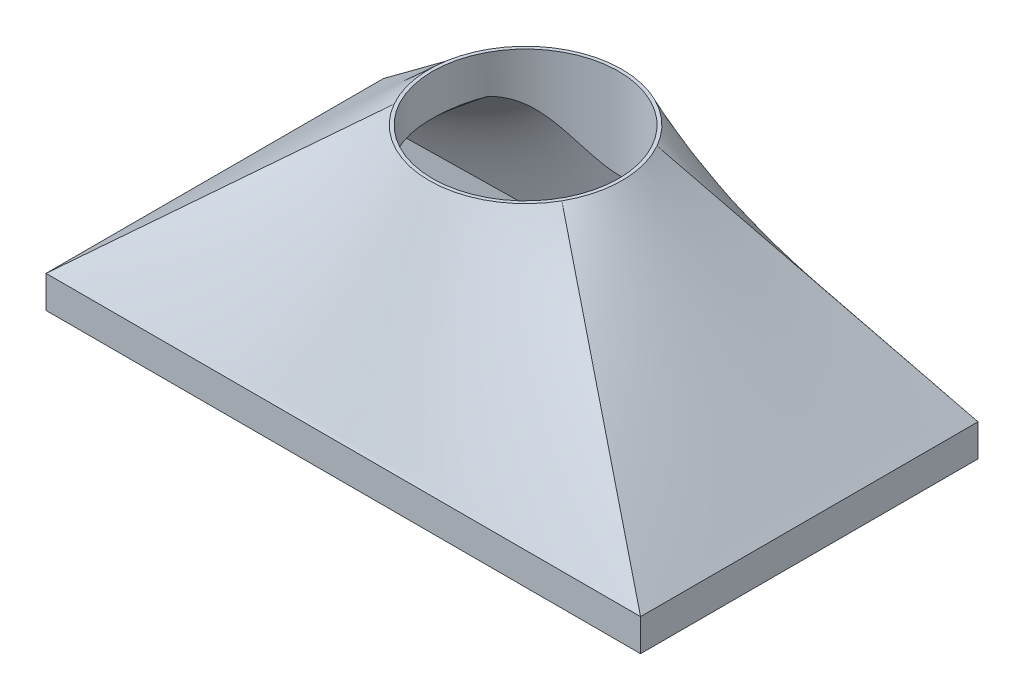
ISO-10303-21;
HEADER;
FILE_DESCRIPTION(('STEP AP214'),'2;1');
FILE_NAME('part.step','',(''),(''),'','','');
FILE_SCHEMA(('AUTOMOTIVE_DESIGN { 1 0 10303 214 1 1 1 1 }'));
ENDSEC;
DATA;
#1=APPLICATION_CONTEXT('core data for automotive mechanical design processes');
#2=APPLICATION_PROTOCOL_DEFINITION('international standard','automotive_design',2000,#1);
#3=PRODUCT_CONTEXT('',#1,'mechanical');
#4=PRODUCT('Part','Part','',(#3));
#5=PRODUCT_RELATED_PRODUCT_CATEGORY('part','',(#4));
#6=PRODUCT_DEFINITION_FORMATION('','',#4);
#7=PRODUCT_DEFINITION_CONTEXT('part definition',#1,'design');
#8=PRODUCT_DEFINITION('design','',#6,#7);
#9=PRODUCT_DEFINITION_SHAPE('','',#8);
#10=(LENGTH_UNIT() NAMED_UNIT(*) SI_UNIT(.MILLI.,.METRE.));
#11=(NAMED_UNIT(*) PLANE_ANGLE_UNIT() SI_UNIT($,.RADIAN.));
#12=(NAMED_UNIT(*) SI_UNIT($,.STERADIAN.) SOLID_ANGLE_UNIT());
#13=UNCERTAINTY_MEASURE_WITH_UNIT(LENGTH_MEASURE(1.E-05),#10,'distance_accuracy_value','');
#14=(GEOMETRIC_REPRESENTATION_CONTEXT(3) GLOBAL_UNCERTAINTY_ASSIGNED_CONTEXT((#13)) GLOBAL_UNIT_ASSIGNED_CONTEXT((#10,
#11,#12)) REPRESENTATION_CONTEXT('',''));
#15=CARTESIAN_POINT('',(0.,0.,0.));
#16=DIRECTION('',(0.,0.,1.));
#17=DIRECTION('',(1.,0.,0.));
#18=AXIS2_PLACEMENT_3D('',#15,#16,#17);
#19=CARTESIAN_POINT('',(-94.6223564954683,10.,-53.0211480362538));
#20=DIRECTION('',(1.,0.,0.));
#21=DIRECTION('',(0.,0.,-1.));
#22=AXIS2_PLACEMENT_3D('',#19,#20,#21);
#23=PLANE('',#22);
#24=DIRECTION('',(0.,0.,1.));
#25=VECTOR('',#24,1.);
#26=CARTESIAN_POINT('',(-94.6223564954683,0.,-53.0211480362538));
#27=LINE('',#26,#25);
#28=CARTESIAN_POINT('',(-94.6223564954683,0.,-53.0211480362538));
#29=VERTEX_POINT('',#28);
#30=CARTESIAN_POINT('',(-94.6223564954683,0.,51.9788519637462));
#31=VERTEX_POINT('',#30);
#32=EDGE_CURVE('E266',#29,#31,#27,.T.);
#33=ORIENTED_EDGE('',*,*,#32,.T.);
#34=DIRECTION('',(0.,-1.,0.));
#35=VECTOR('',#34,1.);
#36=CARTESIAN_POINT('',(-94.6223564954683,10.,51.9788519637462));
#37=LINE('',#36,#35);
#38=CARTESIAN_POINT('',(-94.6223564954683,9.99999999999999,51.9788519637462));
#39=VERTEX_POINT('',#38);
#40=EDGE_CURVE('E77',#39,#31,#37,.T.);
#41=ORIENTED_EDGE('',*,*,#40,.F.);
#42=DIRECTION('',(0.,0.,-1.));
#43=VECTOR('',#42,1.);
#44=CARTESIAN_POINT('',(-94.6223564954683,10.,-53.0211480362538));
#45=LINE('',#44,#43);
#46=CARTESIAN_POINT('',(-94.6223564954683,9.99999999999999,-53.0211480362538));
#47=VERTEX_POINT('',#46);
#48=EDGE_CURVE('E414',#47,#39,#45,.F.);
#49=ORIENTED_EDGE('',*,*,#48,.F.);
#50=DIRECTION('',(0.,-1.,0.));
#51=VECTOR('',#50,1.);
#52=CARTESIAN_POINT('',(-94.6223564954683,10.,-53.0211480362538));
#53=LINE('',#52,#51);
#54=EDGE_CURVE('E421',#47,#29,#53,.T.);
#55=ORIENTED_EDGE('',*,*,#54,.T.);
#56=EDGE_LOOP('',(#33,#41,#49,#55));
#57=FACE_BOUND('',#56,.T.);
#58=ADVANCED_FACE('F65',(#57),#23,.F.);
#59=CARTESIAN_POINT('',(-94.6223564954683,10.,51.9788519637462));
#60=DIRECTION('',(0.,0.,-1.));
#61=DIRECTION('',(-1.,0.,0.));
#62=AXIS2_PLACEMENT_3D('',#59,#60,#61);
#63=PLANE('',#62);
#64=DIRECTION('',(1.,0.,0.));
#65=VECTOR('',#64,1.);
#66=CARTESIAN_POINT('',(-94.6223564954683,0.,51.9788519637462));
#67=LINE('',#66,#65);
#68=CARTESIAN_POINT('',(90.3776435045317,0.,51.9788519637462));
#69=VERTEX_POINT('',#68);
#70=EDGE_CURVE('E408',#31,#69,#67,.T.);
#71=ORIENTED_EDGE('',*,*,#70,.T.);
#72=DIRECTION('',(0.,-1.,0.));
#73=VECTOR('',#72,1.);
#74=CARTESIAN_POINT('',(90.3776435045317,10.,51.9788519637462));
#75=LINE('',#74,#73);
#76=CARTESIAN_POINT('',(90.3776435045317,10.,51.9788519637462));
#77=VERTEX_POINT('',#76);
#78=EDGE_CURVE('E415',#77,#69,#75,.T.);
#79=ORIENTED_EDGE('',*,*,#78,.F.);
#80=DIRECTION('',(-1.,0.,0.));
#81=VECTOR('',#80,1.);
#82=CARTESIAN_POINT('',(-94.6223564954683,10.,51.9788519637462));
#83=LINE('',#82,#81);
#84=EDGE_CURVE('E430',#39,#77,#83,.F.);
#85=ORIENTED_EDGE('',*,*,#84,.F.);
#86=ORIENTED_EDGE('',*,*,#40,.T.);
#87=EDGE_LOOP('',(#71,#79,#85,#86));
#88=FACE_BOUND('',#87,.T.);
#89=ADVANCED_FACE('F471',(#88),#63,.F.);
#90=CARTESIAN_POINT('',(90.3776435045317,10.,-53.0211480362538));
#91=DIRECTION('',(-1.,0.,0.));
#92=DIRECTION('',(0.,0.,1.));
#93=AXIS2_PLACEMENT_3D('',#90,#91,#92);
#94=PLANE('',#93);
#95=DIRECTION('',(0.,0.,-1.));
#96=VECTOR('',#95,1.);
#97=CARTESIAN_POINT('',(90.3776435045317,0.,-53.0211480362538));
#98=LINE('',#97,#96);
#99=CARTESIAN_POINT('',(90.3776435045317,0.,-53.0211480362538));
#100=VERTEX_POINT('',#99);
#101=EDGE_CURVE('E410',#69,#100,#98,.T.);
#102=ORIENTED_EDGE('',*,*,#101,.T.);
#103=DIRECTION('',(0.,-1.,0.));
#104=VECTOR('',#103,1.);
#105=CARTESIAN_POINT('',(90.3776435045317,10.,-53.0211480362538));
#106=LINE('',#105,#104);
#107=CARTESIAN_POINT('',(90.3776435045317,10.,-53.0211480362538));
#108=VERTEX_POINT('',#107);
#109=EDGE_CURVE('E418',#108,#100,#106,.T.);
#110=ORIENTED_EDGE('',*,*,#109,.F.);
#111=DIRECTION('',(0.,0.,1.));
#112=VECTOR('',#111,1.);
#113=CARTESIAN_POINT('',(90.3776435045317,10.,-53.0211480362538));
#114=LINE('',#113,#112);
#115=EDGE_CURVE('E427',#77,#108,#114,.F.);
#116=ORIENTED_EDGE('',*,*,#115,.F.);
#117=ORIENTED_EDGE('',*,*,#78,.T.);
#118=EDGE_LOOP('',(#102,#110,#116,#117));
#119=FACE_BOUND('',#118,.T.);
#120=ADVANCED_FACE('F475',(#119),#94,.F.);
#121=CARTESIAN_POINT('',(-94.6223564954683,10.,-53.0211480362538));
#122=DIRECTION('',(0.,0.,1.));
#123=DIRECTION('',(1.,0.,0.));
#124=AXIS2_PLACEMENT_3D('',#121,#122,#123);
#125=PLANE('',#124);
#126=DIRECTION('',(-1.,0.,0.));
#127=VECTOR('',#126,1.);
#128=CARTESIAN_POINT('',(-94.6223564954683,0.,-53.0211480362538));
#129=LINE('',#128,#127);
#130=EDGE_CURVE('E412',#100,#29,#129,.T.);
#131=ORIENTED_EDGE('',*,*,#130,.T.);
#132=ORIENTED_EDGE('',*,*,#54,.F.);
#133=DIRECTION('',(1.,0.,0.));
#134=VECTOR('',#133,1.);
#135=CARTESIAN_POINT('',(-94.6223564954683,10.,-53.0211480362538));
#136=LINE('',#135,#134);
#137=EDGE_CURVE('E424',#108,#47,#136,.F.);
#138=ORIENTED_EDGE('',*,*,#137,.F.);
#139=ORIENTED_EDGE('',*,*,#109,.T.);
#140=EDGE_LOOP('',(#131,#132,#138,#139));
#141=FACE_BOUND('',#140,.T.);
#142=ADVANCED_FACE('F467',(#141),#125,.F.);
#143=CARTESIAN_POINT('',(0.,0.,0.));
#144=DIRECTION('',(0.,1.,0.));
#145=DIRECTION('',(0.,0.,1.));
#146=AXIS2_PLACEMENT_3D('',#143,#144,#145);
#147=PLANE('',#146);
#148=DIRECTION('',(-1.,0.,0.));
#149=VECTOR('',#148,1.);
#150=CARTESIAN_POINT('',(-94.6223564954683,0.,-43.0211480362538));
#151=LINE('',#150,#149);
#152=CARTESIAN_POINT('',(80.3776435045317,0.,-43.0211480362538));
#153=VERTEX_POINT('',#152);
#154=CARTESIAN_POINT('',(-84.6223564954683,0.,-43.0211480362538));
#155=VERTEX_POINT('',#154);
#156=EDGE_CURVE('E349',#153,#155,#151,.T.);
#157=ORIENTED_EDGE('',*,*,#156,.T.);
#158=DIRECTION('',(0.,0.,1.));
#159=VECTOR('',#158,1.);
#160=CARTESIAN_POINT('',(-84.6223564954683,0.,-53.0211480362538));
#161=LINE('',#160,#159);
#162=CARTESIAN_POINT('',(-84.6223564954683,0.,41.9788519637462));
#163=VERTEX_POINT('',#162);
#164=EDGE_CURVE('E186',#155,#163,#161,.T.);
#165=ORIENTED_EDGE('',*,*,#164,.T.);
#166=DIRECTION('',(1.,0.,0.));
#167=VECTOR('',#166,1.);
#168=CARTESIAN_POINT('',(-94.6223564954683,0.,41.9788519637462));
#169=LINE('',#168,#167);
#170=CARTESIAN_POINT('',(80.3776435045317,0.,41.9788519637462));
#171=VERTEX_POINT('',#170);
#172=EDGE_CURVE('E190',#163,#171,#169,.T.);
#173=ORIENTED_EDGE('',*,*,#172,.T.);
#174=DIRECTION('',(0.,0.,-1.));
#175=VECTOR('',#174,1.);
#176=CARTESIAN_POINT('',(80.3776435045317,0.,-53.0211480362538));
#177=LINE('',#176,#175);
#178=EDGE_CURVE('E91',#171,#153,#177,.T.);
#179=ORIENTED_EDGE('',*,*,#178,.T.);
#180=EDGE_LOOP('',(#157,#165,#173,#179));
#181=FACE_BOUND('',#180,.T.);
#182=ORIENTED_EDGE('',*,*,#32,.F.);
#183=ORIENTED_EDGE('',*,*,#130,.F.);
#184=ORIENTED_EDGE('',*,*,#101,.F.);
#185=ORIENTED_EDGE('',*,*,#70,.F.);
#186=EDGE_LOOP('',(#182,#183,#184,#185));
#187=FACE_BOUND('',#186,.T.);
#188=ADVANCED_FACE('F388',(#181,#187),#147,.F.);
#189=CARTESIAN_POINT('',(0.,70.,-2.62326850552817));
#190=DIRECTION('',(0.,1.,0.));
#191=DIRECTION('',(0.,0.,1.));
#192=AXIS2_PLACEMENT_3D('',#189,#190,#191);
#193=PLANE('',#192);
#194=CARTESIAN_POINT('',(0.,70.,-2.62326850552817));
#195=DIRECTION('',(0.,1.,0.));
#196=DIRECTION('',(0.,0.,1.));
#197=AXIS2_PLACEMENT_3D('',#194,#195,#196);
#198=CIRCLE('',#197,28.9413346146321);
#199=CARTESIAN_POINT('',(0.,70.,26.3180661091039));
#200=VERTEX_POINT('',#199);
#201=EDGE_CURVE('E603',#200,#200,#198,.T.);
#202=ORIENTED_EDGE('',*,*,#201,.F.);
#203=EDGE_LOOP('',(#202));
#204=FACE_BOUND('',#203,.T.);
#205=CARTESIAN_POINT('',(0.,70.,-2.62326850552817));
#206=DIRECTION('',(0.,1.,0.));
#207=DIRECTION('',(0.,0.,1.));
#208=AXIS2_PLACEMENT_3D('',#205,#206,#207);
#209=CIRCLE('',#208,30.);
#210=CARTESIAN_POINT('',(26.0905774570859,70.,-17.4314340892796));
#211=VERTEX_POINT('',#210);
#212=CARTESIAN_POINT('',(-26.0905774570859,70.,-17.4314340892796));
#213=VERTEX_POINT('',#212);
#214=EDGE_CURVE('E363',#211,#213,#209,.T.);
#215=ORIENTED_EDGE('',*,*,#214,.T.);
#216=CARTESIAN_POINT('',(-26.0905774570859,70.,12.1848970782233));
#217=VERTEX_POINT('',#216);
#218=EDGE_CURVE('E274',#213,#217,#209,.T.);
#219=ORIENTED_EDGE('',*,*,#218,.T.);
#220=CARTESIAN_POINT('',(26.0905774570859,70.,12.1848970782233));
#221=VERTEX_POINT('',#220);
#222=EDGE_CURVE('E369',#217,#221,#209,.T.);
#223=ORIENTED_EDGE('',*,*,#222,.T.);
#224=EDGE_CURVE('E347',#221,#211,#209,.T.);
#225=ORIENTED_EDGE('',*,*,#224,.T.);
#226=EDGE_LOOP('',(#215,#219,#223,#225));
#227=FACE_BOUND('',#226,.T.);
#228=ADVANCED_FACE('F293',(#204,#227),#193,.T.);
#229=CARTESIAN_POINT('',(-18.9202863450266,75.4258818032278,9.72087828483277));
#230=CARTESIAN_POINT('',(-25.1983902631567,70.,13.7568459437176));
#231=CARTESIAN_POINT('',(-94.6223564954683,10.,58.3870218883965));
#232=CARTESIAN_POINT('',(-19.2445759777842,75.4258818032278,9.34267735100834));
#233=CARTESIAN_POINT('',(-25.4957859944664,70.,13.2328629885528));
#234=CARTESIAN_POINT('',(-94.6223564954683,10.,56.2509652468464));
#235=CARTESIAN_POINT('',(-19.5688656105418,75.4258818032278,8.96447641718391));
#236=CARTESIAN_POINT('',(-25.7931817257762,70.,12.708880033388));
#237=CARTESIAN_POINT('',(-94.6223564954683,10.,54.1149086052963));
#238=CARTESIAN_POINT('',(-19.8931552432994,75.4258818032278,8.58627548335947));
#239=CARTESIAN_POINT('',(-26.0905774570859,70.,12.1848970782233));
#240=CARTESIAN_POINT('',(-94.6223564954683,10.,51.9788519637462));
#241=CARTESIAN_POINT('',(-20.5573544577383,75.4258818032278,7.81165693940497));
#242=CARTESIAN_POINT('',(-26.6996934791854,70.,11.1116926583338));
#243=CARTESIAN_POINT('',(-94.6223564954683,10.,47.6038519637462));
#244=CARTESIAN_POINT('',(-21.1600254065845,75.4258818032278,6.97666348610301));
#245=CARTESIAN_POINT('',(-27.252383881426,70.,9.9831203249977));
#246=CARTESIAN_POINT('',(-94.6223564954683,10.,43.2288519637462));
#247=CARTESIAN_POINT('',(-22.2156501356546,75.4258818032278,5.20677310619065));
#248=CARTESIAN_POINT('',(-28.2204638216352,70.,7.63435735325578));
#249=CARTESIAN_POINT('',(-94.6223564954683,10.,34.4788519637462));
#250=CARTESIAN_POINT('',(-22.6685149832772,75.4258818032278,4.27191389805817));
#251=CARTESIAN_POINT('',(-28.6357718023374,70.,6.41420130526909));
#252=CARTESIAN_POINT('',(-94.6223564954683,10.,30.1038519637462));
#253=CARTESIAN_POINT('',(-23.4027186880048,75.4258818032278,2.33061950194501));
#254=CARTESIAN_POINT('',(-29.3090867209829,70.,3.90824914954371));
#255=CARTESIAN_POINT('',(-94.6223564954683,10.,21.3538519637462));
#256=CARTESIAN_POINT('',(-23.6839848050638,75.4258818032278,1.32425707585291));
#257=CARTESIAN_POINT('',(-29.5670269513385,70.,2.62251976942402));
#258=CARTESIAN_POINT('',(-94.6223564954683,10.,16.9788519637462));
#259=CARTESIAN_POINT('',(-24.0607020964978,75.4258818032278,-0.725906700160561));
#260=CARTESIAN_POINT('',(-29.9125024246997,70.,0.0167269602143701));
#261=CARTESIAN_POINT('',(-94.6223564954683,10.,8.22885196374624));
#262=CARTESIAN_POINT('',(-24.1561121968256,75.4258818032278,-1.76960933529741));
#263=CARTESIAN_POINT('',(-30.,70.,-1.3032459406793));
#264=CARTESIAN_POINT('',(-94.6223564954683,10.,3.85385196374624));
#265=CARTESIAN_POINT('',(-24.1561121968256,75.4258818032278,-3.8571229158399));
#266=CARTESIAN_POINT('',(-30.,70.,-3.94329107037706));
#267=CARTESIAN_POINT('',(-94.6223564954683,10.,-4.89614803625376));
#268=CARTESIAN_POINT('',(-24.0607020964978,75.4258818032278,-4.90082555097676));
#269=CARTESIAN_POINT('',(-29.9125024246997,70.,-5.26326397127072));
#270=CARTESIAN_POINT('',(-94.6223564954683,10.,-9.27114803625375));
#271=CARTESIAN_POINT('',(-23.6839848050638,75.4258818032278,-6.95098932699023));
#272=CARTESIAN_POINT('',(-29.5670269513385,70.,-7.86905678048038));
#273=CARTESIAN_POINT('',(-94.6223564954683,10.,-18.0211480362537));
#274=CARTESIAN_POINT('',(-23.4027186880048,75.4258818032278,-7.95735175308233));
#275=CARTESIAN_POINT('',(-29.3090867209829,70.,-9.15478616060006));
#276=CARTESIAN_POINT('',(-94.6223564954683,10.,-22.3961480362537));
#277=CARTESIAN_POINT('',(-22.6685149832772,75.4258818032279,-9.89864614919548));
#278=CARTESIAN_POINT('',(-28.6357718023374,70.,-11.6607383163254));
#279=CARTESIAN_POINT('',(-94.6223564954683,10.,-31.1461480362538));
#280=CARTESIAN_POINT('',(-22.2156501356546,75.4258818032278,-10.833505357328));
#281=CARTESIAN_POINT('',(-28.2204638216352,70.,-12.8808943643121));
#282=CARTESIAN_POINT('',(-94.6223564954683,10.,-35.5211480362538));
#283=CARTESIAN_POINT('',(-21.1600254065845,75.4258818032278,-12.6033957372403));
#284=CARTESIAN_POINT('',(-27.252383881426,70.,-15.229657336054));
#285=CARTESIAN_POINT('',(-94.6223564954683,10.,-44.2711480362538));
#286=CARTESIAN_POINT('',(-20.5573544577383,75.4258818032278,-13.4383891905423));
#287=CARTESIAN_POINT('',(-26.6996934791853,70.,-16.3582296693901));
#288=CARTESIAN_POINT('',(-94.6223564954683,10.,-48.6461480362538));
#289=CARTESIAN_POINT('',(-19.8931552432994,75.4258818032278,-14.2130077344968));
#290=CARTESIAN_POINT('',(-26.0905774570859,70.,-17.4314340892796));
#291=CARTESIAN_POINT('',(-94.6223564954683,10.,-53.0211480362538));
#292=CARTESIAN_POINT('',(-19.5698719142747,75.4258818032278,-14.5900350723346));
#293=CARTESIAN_POINT('',(-25.7941045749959,70.,-17.9537910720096));
#294=CARTESIAN_POINT('',(-94.6223564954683,10.,-55.1505762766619));
#295=CARTESIAN_POINT('',(-19.2465885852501,75.4258818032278,-14.9670624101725));
#296=CARTESIAN_POINT('',(-25.497631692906,70.,-18.4761480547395));
#297=CARTESIAN_POINT('',(-94.6223564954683,10.,-57.28000451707));
#298=CARTESIAN_POINT('',(-18.9233052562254,75.4258818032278,-15.3440897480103));
#299=CARTESIAN_POINT('',(-25.201158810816,70.,-18.9985050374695));
#300=CARTESIAN_POINT('',(-94.6223564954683,10.,-59.4094327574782));
#301=B_SPLINE_SURFACE_WITH_KNOTS('',3,1,((#229,#230,#231),(#232,#233,#234),(#235,#236,#237),
(#238,#239,#240),(#241,#242,#243),(#244,#245,#246),(#247,#248,#249),(#250,#251,#252),(#253,#254,
#255),(#256,#257,#258),(#259,#260,#261),(#262,#263,#264),(#265,#266,#267),(#268,#269,#270),
(#271,#272,#273),(#274,#275,#276),(#277,#278,#279),(#280,#281,#282),(#283,#284,#285),(#286,#287,
#288),(#289,#290,#291),(#292,#293,#294),(#295,#296,#297),(#298,#299,#300)),.UNSPECIFIED.,.F.,
.F.,.F.,(4,3,2,2,2,2,2,2,2,3,4),(2,1,2),(-0.0610301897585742,0.,0.125,0.25,0.375,0.5,0.625,0.75,
0.875,1.,1.0608408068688),(-0.0904313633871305,0.,1.),.UNSPECIFIED.);
#302=DIRECTION('',(-0.700792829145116,-0.613548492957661,-0.363933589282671));
#303=VECTOR('',#302,1.);
#304=CARTESIAN_POINT('',(-60.3564669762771,40.,-35.2262910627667));
#305=LINE('',#304,#303);
#306=EDGE_CURVE('E261',#213,#47,#305,.T.);
#307=DIRECTION('',(0.689461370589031,0.603627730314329,-0.400345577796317));
#308=VECTOR('',#307,1.);
#309=CARTESIAN_POINT('',(-60.3564669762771,40.,32.0818745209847));
#310=LINE('',#309,#308);
#311=EDGE_CURVE('E280',#39,#217,#310,.T.);
#312=ORIENTED_EDGE('',*,*,#218,.F.);
#313=ORIENTED_EDGE('',*,*,#306,.T.);
#314=ORIENTED_EDGE('',*,*,#48,.T.);
#315=ORIENTED_EDGE('',*,*,#311,.T.);
#316=EDGE_LOOP('',(#312,#313,#314,#315));
#317=FACE_BOUND('',#316,.T.);
#318=ADVANCED_FACE('F282',(#317),#301,.T.);
#319=CARTESIAN_POINT('',(-20.3404983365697,75.3660412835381,-12.6213102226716));
#320=CARTESIAN_POINT('',(-26.9383036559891,70.,-15.9378212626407));
#321=CARTESIAN_POINT('',(-100.711183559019,10.,-53.0211480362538));
#322=CARTESIAN_POINT('',(-20.214167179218,75.3660412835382,-13.1637077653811));
#323=CARTESIAN_POINT('',(-26.6557282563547,70.,-16.4356922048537));
#324=CARTESIAN_POINT('',(-98.6815745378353,10.,-53.0211480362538));
#325=CARTESIAN_POINT('',(-20.0878360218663,75.3660412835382,-13.7061053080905));
#326=CARTESIAN_POINT('',(-26.3731528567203,70.,-16.9335631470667));
#327=CARTESIAN_POINT('',(-96.6519655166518,10.,-53.0211480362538));
#328=CARTESIAN_POINT('',(-19.9615048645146,75.3660412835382,-14.2485028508));
#329=CARTESIAN_POINT('',(-26.0905774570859,70.,-17.4314340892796));
#330=CARTESIAN_POINT('',(-94.6223564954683,10.,-53.0211480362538));
#331=CARTESIAN_POINT('',(-19.4817067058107,75.3660412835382,-16.3084961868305));
#332=CARTESIAN_POINT('',(-25.0173730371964,70.,-19.3223180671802));
#333=CARTESIAN_POINT('',(-86.914023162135,10.,-53.0211480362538));
#334=CARTESIAN_POINT('',(-18.7003956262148,75.3660412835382,-18.375711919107));
#335=CARTESIAN_POINT('',(-23.6674075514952,70.,-21.2198315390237));
#336=CARTESIAN_POINT('',(-79.2056898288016,10.,-53.0211480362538));
#337=CARTESIAN_POINT('',(-17.0187894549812,75.3660412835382,-21.3065635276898));
#338=CARTESIAN_POINT('',(-21.1746571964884,70.,-23.9100831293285));
#339=CARTESIAN_POINT('',(-67.6431898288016,10.,-53.0211480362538));
#340=CARTESIAN_POINT('',(-16.3739834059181,75.3660412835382,-22.2544068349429));
#341=CARTESIAN_POINT('',(-20.2663877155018,70.,-24.7801159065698));
#342=CARTESIAN_POINT('',(-63.7890231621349,10.,-53.0211480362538));
#343=CARTESIAN_POINT('',(-14.9176709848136,75.3660412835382,-24.0545416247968));
#344=CARTESIAN_POINT('',(-18.2968332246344,70.,-26.4324736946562));
#345=CARTESIAN_POINT('',(-56.0806898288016,10.,-53.0211480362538));
#346=CARTESIAN_POINT('',(-14.1061044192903,75.3660412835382,-24.9067273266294));
#347=CARTESIAN_POINT('',(-17.2354929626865,70.,-27.2147016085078));
#348=CARTESIAN_POINT('',(-52.2265231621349,10.,-53.0211480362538));
#349=CARTESIAN_POINT('',(-12.3285174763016,75.3660412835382,-26.4762093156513));
#350=CARTESIAN_POINT('',(-14.9710380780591,70.,-28.6553413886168));
#351=CARTESIAN_POINT('',(-44.5181898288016,10.,-53.0211480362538));
#352=CARTESIAN_POINT('',(-11.3624800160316,75.3660412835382,-27.193368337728));
#353=CARTESIAN_POINT('',(-13.7679077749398,70.,-29.3136272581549));
#354=CARTESIAN_POINT('',(-40.6640231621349,9.99999999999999,-53.0211480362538));
#355=CARTESIAN_POINT('',(-9.30000953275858,75.3660412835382,-28.4552825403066));
#356=CARTESIAN_POINT('',(-11.2419560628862,70.,-30.471948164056));
#357=CARTESIAN_POINT('',(-32.9556898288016,9.99999999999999,-53.0211480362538));
#358=CARTESIAN_POINT('',(-8.20361965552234,75.3660412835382,-28.9998905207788));
#359=CARTESIAN_POINT('',(-9.9191742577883,70.,-30.9718480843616));
#360=CARTESIAN_POINT('',(-29.1015231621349,9.99999999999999,-53.0211480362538));
#361=CARTESIAN_POINT('',(-5.915980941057,75.3660412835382,-29.8853746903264));
#362=CARTESIAN_POINT('',(-7.18653886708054,70.,-31.7846409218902));
#363=CARTESIAN_POINT('',(-21.3931898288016,9.99999999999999,-53.0211480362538));
#364=CARTESIAN_POINT('',(-4.72483954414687,75.3660412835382,-30.2261249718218));
#365=CARTESIAN_POINT('',(-5.77678390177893,70.,-32.0974182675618));
#366=CARTESIAN_POINT('',(-17.5390231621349,9.99999999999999,-53.0211480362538));
#367=CARTESIAN_POINT('',(-2.2924529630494,75.3660412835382,-30.6829761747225));
#368=CARTESIAN_POINT('',(-2.91128331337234,70.,-32.5167655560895));
#369=CARTESIAN_POINT('',(-9.83068982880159,9.99999999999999,-53.0211480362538));
#370=CARTESIAN_POINT('',(-1.05136508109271,75.3660412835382,-30.7990041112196));
#371=CARTESIAN_POINT('',(-1.45568207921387,70.,-32.6232685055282));
#372=CARTESIAN_POINT('',(-5.97652316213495,10.,-53.0211480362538));
#373=CARTESIAN_POINT('',(1.43098683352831,75.3660412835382,-30.7990041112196));
#374=CARTESIAN_POINT('',(1.45568207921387,70.,-32.6232685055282));
#375=CARTESIAN_POINT('',(1.73181017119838,10.,-53.0211480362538));
#376=CARTESIAN_POINT('',(2.672074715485,75.3660412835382,-30.6829761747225));
#377=CARTESIAN_POINT('',(2.91128331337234,70.,-32.5167655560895));
#378=CARTESIAN_POINT('',(5.58597683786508,10.,-53.0211480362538));
#379=CARTESIAN_POINT('',(5.10446129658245,75.3660412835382,-30.2261249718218));
#380=CARTESIAN_POINT('',(5.77678390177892,70.,-32.0974182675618));
#381=CARTESIAN_POINT('',(13.2943101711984,10.,-53.0211480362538));
#382=CARTESIAN_POINT('',(6.2956026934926,75.3660412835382,-29.8853746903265));
#383=CARTESIAN_POINT('',(7.18653886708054,70.,-31.7846409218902));
#384=CARTESIAN_POINT('',(17.1484768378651,10.,-53.0211480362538));
#385=CARTESIAN_POINT('',(8.58324140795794,75.3660412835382,-28.9998905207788));
#386=CARTESIAN_POINT('',(9.9191742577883,70.,-30.9718480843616));
#387=CARTESIAN_POINT('',(24.8568101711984,9.99999999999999,-53.0211480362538));
#388=CARTESIAN_POINT('',(9.67963128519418,75.3660412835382,-28.4552825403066));
#389=CARTESIAN_POINT('',(11.2419560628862,70.,-30.471948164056));
#390=CARTESIAN_POINT('',(28.7109768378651,9.99999999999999,-53.0211480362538));
#391=CARTESIAN_POINT('',(11.7421017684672,75.3660412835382,-27.193368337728));
#392=CARTESIAN_POINT('',(13.7679077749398,70.,-29.3136272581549));
#393=CARTESIAN_POINT('',(36.4193101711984,9.99999999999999,-53.0211480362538));
#394=CARTESIAN_POINT('',(12.7081392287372,75.3660412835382,-26.4762093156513));
#395=CARTESIAN_POINT('',(14.9710380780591,70.,-28.6553413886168));
#396=CARTESIAN_POINT('',(40.2734768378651,9.99999999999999,-53.0211480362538));
#397=CARTESIAN_POINT('',(14.4857261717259,75.3660412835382,-24.9067273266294));
#398=CARTESIAN_POINT('',(17.2354929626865,70.,-27.2147016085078));
#399=CARTESIAN_POINT('',(47.9818101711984,9.99999999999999,-53.0211480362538));
#400=CARTESIAN_POINT('',(15.2972927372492,75.3660412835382,-24.0545416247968));
#401=CARTESIAN_POINT('',(18.2968332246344,70.,-26.4324736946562));
#402=CARTESIAN_POINT('',(51.8359768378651,9.99999999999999,-53.0211480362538));
#403=CARTESIAN_POINT('',(16.7536051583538,75.3660412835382,-22.2544068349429));
#404=CARTESIAN_POINT('',(20.2663877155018,70.,-24.7801159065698));
#405=CARTESIAN_POINT('',(59.5443101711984,9.99999999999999,-53.0211480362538));
#406=CARTESIAN_POINT('',(17.3984112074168,75.3660412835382,-21.3065635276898));
#407=CARTESIAN_POINT('',(21.1746571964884,70.,-23.9100831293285));
#408=CARTESIAN_POINT('',(63.3984768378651,9.99999999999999,-53.0211480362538));
#409=CARTESIAN_POINT('',(19.0800173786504,75.3660412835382,-18.375711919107));
#410=CARTESIAN_POINT('',(23.6674075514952,70.,-21.2198315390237));
#411=CARTESIAN_POINT('',(74.9609768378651,9.99999999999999,-53.0211480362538));
#412=CARTESIAN_POINT('',(19.8613284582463,75.3660412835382,-16.3084961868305));
#413=CARTESIAN_POINT('',(25.0173730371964,70.,-19.3223180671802));
#414=CARTESIAN_POINT('',(82.6693101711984,9.99999999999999,-53.0211480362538));
#415=CARTESIAN_POINT('',(20.3411266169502,75.3660412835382,-14.2485028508));
#416=CARTESIAN_POINT('',(26.0905774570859,70.,-17.4314340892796));
#417=CARTESIAN_POINT('',(90.3776435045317,10.,-53.0211480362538));
#418=CARTESIAN_POINT('',(20.4671995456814,75.3660412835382,-13.7072140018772));
#419=CARTESIAN_POINT('',(26.3725752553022,70.,-16.9345808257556));
#420=CARTESIAN_POINT('',(92.4031038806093,10.,-53.0211480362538));
#421=CARTESIAN_POINT('',(20.5932724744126,75.3660412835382,-13.1659251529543));
#422=CARTESIAN_POINT('',(26.6545730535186,70.,-16.4377275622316));
#423=CARTESIAN_POINT('',(94.4285642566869,10.,-53.0211480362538));
#424=CARTESIAN_POINT('',(20.7193454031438,75.3660412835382,-12.6246363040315));
#425=CARTESIAN_POINT('',(26.9365708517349,70.,-15.9408742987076));
#426=CARTESIAN_POINT('',(96.4540246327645,10.,-53.0211480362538));
#427=B_SPLINE_SURFACE_WITH_KNOTS('',3,1,((#319,#320,#321),(#322,#323,#324),(#325,#326,#327),
(#328,#329,#330),(#331,#332,#333),(#334,#335,#336),(#337,#338,#339),(#340,#341,#342),(#343,#344,
#345),(#346,#347,#348),(#349,#350,#351),(#352,#353,#354),(#355,#356,#357),(#358,#359,#360),
(#361,#362,#363),(#364,#365,#366),(#367,#368,#369),(#370,#371,#372),(#373,#374,#375),(#376,#377,
#378),(#379,#380,#381),(#382,#383,#384),(#385,#386,#387),(#388,#389,#390),(#391,#392,#393),
(#394,#395,#396),(#397,#398,#399),(#400,#401,#402),(#403,#404,#405),(#406,#407,#408),(#409,#410,
#411),(#412,#413,#414),(#415,#416,#417),(#418,#419,#420),(#421,#422,#423),(#424,#425,#426)),
.UNSPECIFIED.,.F.,.F.,.F.,(4,3,2,2,2,2,2,2,2,2,2,2,2,2,2,3,4),(2,1,2),(-0.0329125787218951,0.,
0.125,0.1875,0.25,0.3125,0.375,0.4375,0.5,0.5625,0.625,0.6875,0.75,0.8125,0.875,1.,
1.03284530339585),(-0.0894340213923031,0.,1.),.UNSPECIFIED.);
#428=DIRECTION('',(0.677665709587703,-0.632474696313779,-0.375159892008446));
#429=VECTOR('',#428,1.);
#430=CARTESIAN_POINT('',(58.2341104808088,40.,-35.2262910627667));
#431=LINE('',#430,#429);
#432=EDGE_CURVE('E252',#211,#108,#431,.T.);
#433=ORIENTED_EDGE('',*,*,#214,.F.);
#434=ORIENTED_EDGE('',*,*,#432,.T.);
#435=ORIENTED_EDGE('',*,*,#137,.T.);
#436=ORIENTED_EDGE('',*,*,#306,.F.);
#437=EDGE_LOOP('',(#433,#434,#435,#436));
#438=FACE_BOUND('',#437,.T.);
#439=ADVANCED_FACE('F292',(#438),#427,.T.);
#440=CARTESIAN_POINT('',(20.6801800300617,75.4004874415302,6.97517059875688));
#441=CARTESIAN_POINT('',(26.938250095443,70.,10.6913786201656));
#442=CARTESIAN_POINT('',(96.4660858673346,10.,51.9788519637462));
#443=CARTESIAN_POINT('',(20.554859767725,75.4004874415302,7.51781968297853));
#444=CARTESIAN_POINT('',(26.655692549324,70.,11.1892181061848));
#445=CARTESIAN_POINT('',(94.4366050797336,10.,51.9788519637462));
#446=CARTESIAN_POINT('',(20.4295395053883,75.4004874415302,8.06046876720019));
#447=CARTESIAN_POINT('',(26.3731350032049,70.,11.687057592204));
#448=CARTESIAN_POINT('',(92.4071242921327,10.,51.9788519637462));
#449=CARTESIAN_POINT('',(20.3042192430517,75.4004874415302,8.60311785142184));
#450=CARTESIAN_POINT('',(26.0905774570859,70.,12.1848970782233));
#451=CARTESIAN_POINT('',(90.3776435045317,10.,51.9788519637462));
#452=CARTESIAN_POINT('',(19.8282303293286,75.4004874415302,10.6641967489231));
#453=CARTESIAN_POINT('',(25.0173730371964,70.,14.0757810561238));
#454=CARTESIAN_POINT('',(82.6693101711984,10.,51.9788519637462));
#455=CARTESIAN_POINT('',(19.0505696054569,75.4004874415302,12.7325018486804));
#456=CARTESIAN_POINT('',(23.6674075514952,70.,15.9732945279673));
#457=CARTESIAN_POINT('',(74.960976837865,10.,51.9788519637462));
#458=CARTESIAN_POINT('',(17.3741704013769,75.4004874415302,15.6648979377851));
#459=CARTESIAN_POINT('',(21.1746571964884,70.,18.6635461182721));
#460=CARTESIAN_POINT('',(63.398476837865,10.,51.9788519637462));
#461=CARTESIAN_POINT('',(16.7310555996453,75.4004874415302,16.6132407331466));
#462=CARTESIAN_POINT('',(20.2663877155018,70.,19.5335788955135));
#463=CARTESIAN_POINT('',(59.5443101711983,10.,51.9788519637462));
#464=CARTESIAN_POINT('',(15.2780378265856,75.4004874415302,18.4143241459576));
#465=CARTESIAN_POINT('',(18.2968332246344,70.,21.1859366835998));
#466=CARTESIAN_POINT('',(51.835976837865,9.99999999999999,51.9788519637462));
#467=CARTESIAN_POINT('',(14.4680746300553,75.4004874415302,19.2669589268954));
#468=CARTESIAN_POINT('',(17.2354929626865,70.,21.9681645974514));
#469=CARTESIAN_POINT('',(47.9818101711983,9.99999999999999,51.9788519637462));
#470=CARTESIAN_POINT('',(12.6936130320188,75.4004874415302,20.8372679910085));
#471=CARTESIAN_POINT('',(14.9710380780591,70.,23.4088043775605));
#472=CARTESIAN_POINT('',(40.273476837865,9.99999999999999,51.9788519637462));
#473=CARTESIAN_POINT('',(11.7290975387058,75.4004874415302,21.5548049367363));
#474=CARTESIAN_POINT('',(13.7679077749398,70.,24.0670902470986));
#475=CARTESIAN_POINT('',(36.4193101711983,9.99999999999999,51.9788519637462));
#476=CARTESIAN_POINT('',(9.66960227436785,75.4004874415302,22.8173841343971));
#477=CARTESIAN_POINT('',(11.2419560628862,70.,25.2254111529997));
#478=CARTESIAN_POINT('',(28.710976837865,9.99999999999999,51.9788519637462));
#479=CARTESIAN_POINT('',(8.57466567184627,75.4004874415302,23.3622791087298));
#480=CARTESIAN_POINT('',(9.9191742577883,70.,25.7253110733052));
#481=CARTESIAN_POINT('',(24.8568101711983,9.99999999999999,51.9788519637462));
#482=CARTESIAN_POINT('',(6.28988351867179,75.4004874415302,24.2482299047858));
#483=CARTESIAN_POINT('',(7.18653886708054,70.,26.5381039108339));
#484=CARTESIAN_POINT('',(17.148476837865,10.,51.9788519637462));
#485=CARTESIAN_POINT('',(5.10014546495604,75.4004874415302,24.5891597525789));
#486=CARTESIAN_POINT('',(5.77678390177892,70.,26.8508812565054));
#487=CARTESIAN_POINT('',(13.2943101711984,10.,51.9788519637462));
#488=CARTESIAN_POINT('',(2.67053916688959,75.4004874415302,25.0462517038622));
#489=CARTESIAN_POINT('',(2.91128331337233,70.,27.2702285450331));
#490=CARTESIAN_POINT('',(5.58597683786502,9.99999999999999,51.9788519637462));
#491=CARTESIAN_POINT('',(1.4308283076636,75.4004874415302,25.162340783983));
#492=CARTESIAN_POINT('',(1.45568207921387,70.,27.3767314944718));
#493=CARTESIAN_POINT('',(1.73181017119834,9.99999999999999,51.9788519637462));
#494=CARTESIAN_POINT('',(-1.04876965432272,75.4004874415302,25.162340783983));
#495=CARTESIAN_POINT('',(-1.45568207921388,70.,27.3767314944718));
#496=CARTESIAN_POINT('',(-5.97652316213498,9.99999999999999,51.9788519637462));
#497=CARTESIAN_POINT('',(-2.2884805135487,75.4004874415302,25.0462517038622));
#498=CARTESIAN_POINT('',(-2.91128331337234,70.,27.2702285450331));
#499=CARTESIAN_POINT('',(-9.83068982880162,9.99999999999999,51.9788519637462));
#500=CARTESIAN_POINT('',(-4.71808681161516,75.4004874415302,24.5891597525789));
#501=CARTESIAN_POINT('',(-5.77678390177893,70.,26.8508812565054));
#502=CARTESIAN_POINT('',(-17.5390231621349,9.99999999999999,51.9788519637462));
#503=CARTESIAN_POINT('',(-5.90782486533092,75.4004874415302,24.2482299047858));
#504=CARTESIAN_POINT('',(-7.18653886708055,70.,26.5381039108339));
#505=CARTESIAN_POINT('',(-21.3931898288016,9.99999999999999,51.9788519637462));
#506=CARTESIAN_POINT('',(-8.19260701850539,75.4004874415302,23.3622791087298));
#507=CARTESIAN_POINT('',(-9.9191742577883,70.,25.7253110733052));
#508=CARTESIAN_POINT('',(-29.1015231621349,9.99999999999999,51.9788519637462));
#509=CARTESIAN_POINT('',(-9.28754362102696,75.4004874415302,22.817384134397));
#510=CARTESIAN_POINT('',(-11.2419560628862,70.,25.2254111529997));
#511=CARTESIAN_POINT('',(-32.9556898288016,9.99999999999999,51.9788519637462));
#512=CARTESIAN_POINT('',(-11.3470388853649,75.4004874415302,21.5548049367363));
#513=CARTESIAN_POINT('',(-13.7679077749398,70.,24.0670902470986));
#514=CARTESIAN_POINT('',(-40.6640231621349,9.99999999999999,51.9788519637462));
#515=CARTESIAN_POINT('',(-12.3115543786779,75.4004874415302,20.8372679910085));
#516=CARTESIAN_POINT('',(-14.9710380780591,70.,23.4088043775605));
#517=CARTESIAN_POINT('',(-44.5181898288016,9.99999999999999,51.9788519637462));
#518=CARTESIAN_POINT('',(-14.0860159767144,75.4004874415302,19.2669589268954));
#519=CARTESIAN_POINT('',(-17.2354929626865,70.,21.9681645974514));
#520=CARTESIAN_POINT('',(-52.2265231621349,9.99999999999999,51.9788519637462));
#521=CARTESIAN_POINT('',(-14.8959791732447,75.4004874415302,18.4143241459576));
#522=CARTESIAN_POINT('',(-18.2968332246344,70.,21.1859366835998));
#523=CARTESIAN_POINT('',(-56.0806898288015,9.99999999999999,51.9788519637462));
#524=CARTESIAN_POINT('',(-16.3489969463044,75.4004874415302,16.6132407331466));
#525=CARTESIAN_POINT('',(-20.2663877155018,70.,19.5335788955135));
#526=CARTESIAN_POINT('',(-63.7890231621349,9.99999999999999,51.9788519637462));
#527=CARTESIAN_POINT('',(-16.992111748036,75.4004874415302,15.6648979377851));
#528=CARTESIAN_POINT('',(-21.1746571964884,70.,18.6635461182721));
#529=CARTESIAN_POINT('',(-67.6431898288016,9.99999999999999,51.9788519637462));
#530=CARTESIAN_POINT('',(-18.668510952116,75.4004874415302,12.7325018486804));
#531=CARTESIAN_POINT('',(-23.6674075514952,70.,15.9732945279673));
#532=CARTESIAN_POINT('',(-79.2056898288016,10.,51.9788519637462));
#533=CARTESIAN_POINT('',(-19.4461716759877,75.4004874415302,10.6641967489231));
#534=CARTESIAN_POINT('',(-25.0173730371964,70.,14.0757810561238));
#535=CARTESIAN_POINT('',(-86.9140231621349,10.,51.9788519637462));
#536=CARTESIAN_POINT('',(-19.9221605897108,75.4004874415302,8.60311785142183));
#537=CARTESIAN_POINT('',(-26.0905774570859,70.,12.1848970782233));
#538=CARTESIAN_POINT('',(-94.6223564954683,10.,51.9788519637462));
#539=CARTESIAN_POINT('',(-20.0475022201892,75.4004874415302,8.06037624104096));
#540=CARTESIAN_POINT('',(-26.3731831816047,70.,11.6869727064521));
#541=CARTESIAN_POINT('',(-96.6521833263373,10.,51.9788519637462));
#542=CARTESIAN_POINT('',(-20.1728438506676,75.4004874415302,7.51763463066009));
#543=CARTESIAN_POINT('',(-26.6557889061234,70.,11.1890483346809));
#544=CARTESIAN_POINT('',(-98.6820101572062,10.,51.9788519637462));
#545=CARTESIAN_POINT('',(-20.2981854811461,75.4004874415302,6.97489302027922));
#546=CARTESIAN_POINT('',(-26.9383946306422,70.,10.6911239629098));
#547=CARTESIAN_POINT('',(-100.711836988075,10.,51.9788519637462));
#548=B_SPLINE_SURFACE_WITH_KNOTS('',3,1,((#440,#441,#442),(#443,#444,#445),(#446,#447,#448),
(#449,#450,#451),(#452,#453,#454),(#455,#456,#457),(#458,#459,#460),(#461,#462,#463),(#464,#465,
#466),(#467,#468,#469),(#470,#471,#472),(#473,#474,#475),(#476,#477,#478),(#479,#480,#481),
(#482,#483,#484),(#485,#486,#487),(#488,#489,#490),(#491,#492,#493),(#494,#495,#496),(#497,#498,
#499),(#500,#501,#502),(#503,#504,#505),(#506,#507,#508),(#509,#510,#511),(#512,#513,#514),
(#515,#516,#517),(#518,#519,#520),(#521,#522,#523),(#524,#525,#526),(#527,#528,#529),(#530,#531,
#532),(#533,#534,#535),(#536,#537,#538),(#539,#540,#541),(#542,#543,#544),(#545,#546,#547)),
.UNSPECIFIED.,.F.,.F.,.F.,(4,3,2,2,2,2,2,2,2,2,2,2,2,2,2,3,4),(2,1,2),(-0.0329104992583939,0.,
0.125,0.1875,0.25,0.3125,0.375,0.4375,0.5,0.5625,0.625,0.6875,0.75,0.8125,0.875,1.,
1.03291611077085),(-0.0900081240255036,0.,1.),.UNSPECIFIED.);
#549=DIRECTION('',(0.666039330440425,-0.621623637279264,0.412281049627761));
#550=VECTOR('',#549,1.);
#551=CARTESIAN_POINT('',(58.2341104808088,40.,32.0818745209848));
#552=LINE('',#551,#550);
#553=EDGE_CURVE('E260',#221,#77,#552,.T.);
#554=ORIENTED_EDGE('',*,*,#222,.F.);
#555=ORIENTED_EDGE('',*,*,#311,.F.);
#556=ORIENTED_EDGE('',*,*,#84,.T.);
#557=ORIENTED_EDGE('',*,*,#553,.F.);
#558=EDGE_LOOP('',(#554,#555,#556,#557));
#559=FACE_BOUND('',#558,.T.);
#560=ADVANCED_FACE('F232',(#559),#548,.T.);
#561=CARTESIAN_POINT('',(19.4407743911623,75.3084024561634,-15.4161464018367));
#562=CARTESIAN_POINT('',(25.2066702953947,70.,-18.9887943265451));
#563=CARTESIAN_POINT('',(90.3776435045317,10.,-59.3698463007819));
#564=CARTESIAN_POINT('',(19.7614775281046,75.3084024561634,-15.0383282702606));
#565=CARTESIAN_POINT('',(25.5013060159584,70.,-18.4696742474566));
#566=CARTESIAN_POINT('',(90.3776435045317,10.,-57.2536135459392));
#567=CARTESIAN_POINT('',(20.0821806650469,75.3084024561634,-14.6605101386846));
#568=CARTESIAN_POINT('',(25.7959417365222,70.,-17.9505541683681));
#569=CARTESIAN_POINT('',(90.3776435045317,10.,-55.1373807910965));
#570=CARTESIAN_POINT('',(20.4028838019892,75.3084024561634,-14.2826920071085));
#571=CARTESIAN_POINT('',(26.0905774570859,70.,-17.4314340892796));
#572=CARTESIAN_POINT('',(90.3776435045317,10.,-53.0211480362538));
#573=CARTESIAN_POINT('',(21.0658903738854,75.3084024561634,-13.5016085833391));
#574=CARTESIAN_POINT('',(26.6996934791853,70.,-16.3582296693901));
#575=CARTESIAN_POINT('',(90.3776435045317,10.,-48.6461480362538));
#576=CARTESIAN_POINT('',(21.6674791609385,75.3084024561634,-12.6602586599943));
#577=CARTESIAN_POINT('',(27.252383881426,70.,-15.2296573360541));
#578=CARTESIAN_POINT('',(90.3776435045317,10.,-44.2711480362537));
#579=CARTESIAN_POINT('',(22.7212084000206,75.3084024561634,-10.8778347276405));
#580=CARTESIAN_POINT('',(28.2204638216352,70.,-12.8808943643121));
#581=CARTESIAN_POINT('',(90.3776435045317,10.,-35.5211480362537));
#582=CARTESIAN_POINT('',(23.1732600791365,75.3084024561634,-9.93679836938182));
#583=CARTESIAN_POINT('',(28.6357718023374,70.,-11.6607383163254));
#584=CARTESIAN_POINT('',(90.3776435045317,10.,-31.1461480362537));
#585=CARTESIAN_POINT('',(23.9061454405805,75.3084024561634,-7.98327819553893));
#586=CARTESIAN_POINT('',(29.3090867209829,70.,-9.15478616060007));
#587=CARTESIAN_POINT('',(90.3776435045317,10.,-22.3961480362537));
#588=CARTESIAN_POINT('',(24.1869065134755,75.3084024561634,-6.97086701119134));
#589=CARTESIAN_POINT('',(29.5670269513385,70.,-7.86905678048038));
#590=CARTESIAN_POINT('',(90.3776435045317,10.,-18.0211480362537));
#591=CARTESIAN_POINT('',(24.5629473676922,75.3084024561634,-4.90867294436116));
#592=CARTESIAN_POINT('',(29.9125024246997,70.,-5.26326397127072));
#593=CARTESIAN_POINT('',(90.3776435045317,10.,-9.27114803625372));
#594=CARTESIAN_POINT('',(24.6581861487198,75.3084024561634,-3.85898859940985));
#595=CARTESIAN_POINT('',(30.,70.,-3.94329107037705));
#596=CARTESIAN_POINT('',(90.3776435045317,10.,-4.89614803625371));
#597=CARTESIAN_POINT('',(24.6581861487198,75.3084024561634,-1.75951179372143));
#598=CARTESIAN_POINT('',(30.,70.,-1.30324594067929));
#599=CARTESIAN_POINT('',(90.3776435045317,10.,3.85385196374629));
#600=CARTESIAN_POINT('',(24.5629473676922,75.3084024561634,-0.709827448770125));
#601=CARTESIAN_POINT('',(29.9125024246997,70.,0.0167269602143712));
#602=CARTESIAN_POINT('',(90.3776435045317,10.,8.2288519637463));
#603=CARTESIAN_POINT('',(24.1869065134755,75.3084024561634,1.35236661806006));
#604=CARTESIAN_POINT('',(29.5670269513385,70.,2.62251976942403));
#605=CARTESIAN_POINT('',(90.3776435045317,10.,16.9788519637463));
#606=CARTESIAN_POINT('',(23.9061454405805,75.3084024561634,2.36477780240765));
#607=CARTESIAN_POINT('',(29.3090867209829,70.,3.90824914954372));
#608=CARTESIAN_POINT('',(90.3776435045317,10.,21.3538519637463));
#609=CARTESIAN_POINT('',(23.1732600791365,75.3084024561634,4.31829797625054));
#610=CARTESIAN_POINT('',(28.6357718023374,70.,6.4142013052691));
#611=CARTESIAN_POINT('',(90.3776435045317,10.,30.1038519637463));
#612=CARTESIAN_POINT('',(22.7212084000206,75.3084024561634,5.25933433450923));
#613=CARTESIAN_POINT('',(28.2204638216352,70.,7.63435735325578));
#614=CARTESIAN_POINT('',(90.3776435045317,10.,34.4788519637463));
#615=CARTESIAN_POINT('',(21.6674791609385,75.3084024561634,7.041758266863));
#616=CARTESIAN_POINT('',(27.252383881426,70.,9.98312032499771));
#617=CARTESIAN_POINT('',(90.3776435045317,10.,43.2288519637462));
#618=CARTESIAN_POINT('',(21.0658903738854,75.3084024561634,7.88310819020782));
#619=CARTESIAN_POINT('',(26.6996934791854,70.,11.1116926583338));
#620=CARTESIAN_POINT('',(90.3776435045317,10.,47.6038519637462));
#621=CARTESIAN_POINT('',(20.4028838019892,75.3084024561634,8.66419161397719));
#622=CARTESIAN_POINT('',(26.0905774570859,70.,12.1848970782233));
#623=CARTESIAN_POINT('',(90.3776435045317,10.,51.9788519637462));
#624=CARTESIAN_POINT('',(20.0801353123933,75.3084024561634,9.0444193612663));
#625=CARTESIAN_POINT('',(25.794062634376,70.,12.7073279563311));
#626=CARTESIAN_POINT('',(90.3776435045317,10.,54.1085814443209));
#627=CARTESIAN_POINT('',(19.7573868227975,75.3084024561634,9.42464710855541));
#628=CARTESIAN_POINT('',(25.4975478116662,70.,13.2297588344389));
#629=CARTESIAN_POINT('',(90.3776435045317,10.,56.2383109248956));
#630=CARTESIAN_POINT('',(19.4346383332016,75.3084024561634,9.80487485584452));
#631=CARTESIAN_POINT('',(25.2010329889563,70.,13.7521897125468));
#632=CARTESIAN_POINT('',(90.3776435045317,10.,58.3680404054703));
#633=B_SPLINE_SURFACE_WITH_KNOTS('',3,1,((#561,#562,#563),(#564,#565,#566),(#567,#568,#569),
(#570,#571,#572),(#573,#574,#575),(#576,#577,#578),(#579,#580,#581),(#582,#583,#584),(#585,#586,
#587),(#588,#589,#590),(#591,#592,#593),(#594,#595,#596),(#597,#598,#599),(#600,#601,#602),
(#603,#604,#605),(#606,#607,#608),(#609,#610,#611),(#612,#613,#614),(#615,#616,#617),(#618,#619,
#620),(#621,#622,#623),(#624,#625,#626),(#627,#628,#629),(#630,#631,#632)),.UNSPECIFIED.,.F.,
.F.,.F.,(4,3,2,2,2,2,2,2,2,3,4),(2,1,2),(-0.0604637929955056,0.,0.125,0.25,0.375,0.5,0.625,0.75,
0.875,1.,1.06084941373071),(-0.0884733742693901,0.,1.),.UNSPECIFIED.);
#634=ORIENTED_EDGE('',*,*,#224,.F.);
#635=ORIENTED_EDGE('',*,*,#553,.T.);
#636=ORIENTED_EDGE('',*,*,#115,.T.);
#637=ORIENTED_EDGE('',*,*,#432,.F.);
#638=EDGE_LOOP('',(#634,#635,#636,#637));
#639=FACE_BOUND('',#638,.T.);
#640=ADVANCED_FACE('F225',(#639),#633,.T.);
#641=CARTESIAN_POINT('',(-84.6223564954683,10.,-53.0211480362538));
#642=DIRECTION('',(1.,0.,0.));
#643=DIRECTION('',(0.,0.,-1.));
#644=AXIS2_PLACEMENT_3D('',#641,#642,#643);
#645=PLANE('',#644);
#646=ORIENTED_EDGE('',*,*,#164,.F.);
#647=DIRECTION('',(0.,-1.,0.));
#648=VECTOR('',#647,1.);
#649=CARTESIAN_POINT('',(-84.6223564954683,10.,-43.0211480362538));
#650=LINE('',#649,#648);
#651=CARTESIAN_POINT('',(-84.6223564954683,5.51288789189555,-43.0211480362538));
#652=VERTEX_POINT('',#651);
#653=EDGE_CURVE('E619',#652,#155,#650,.T.);
#654=ORIENTED_EDGE('',*,*,#653,.F.);
#655=CARTESIAN_POINT('',(-84.6223564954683,5.4433959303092,-54.5041675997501));
#656=CARTESIAN_POINT('',(-84.6223564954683,5.44690663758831,-53.9418542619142));
#657=CARTESIAN_POINT('',(-84.6223564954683,5.45044620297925,-53.3795411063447));
#658=CARTESIAN_POINT('',(-84.6223564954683,5.45753664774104,-52.2549148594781));
#659=CARTESIAN_POINT('',(-84.6223564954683,5.46108752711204,-51.6926017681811));
#660=CARTESIAN_POINT('',(-84.6223564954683,5.46815419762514,-50.5679753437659));
#661=CARTESIAN_POINT('',(-84.6223564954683,5.47166998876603,-50.0056620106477));
#662=CARTESIAN_POINT('',(-84.6223564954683,5.47860991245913,-48.881034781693));
#663=CARTESIAN_POINT('',(-84.6223564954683,5.48203404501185,-48.3187208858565));
#664=CARTESIAN_POINT('',(-84.6223564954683,5.49218353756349,-46.6317782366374));
#665=CARTESIAN_POINT('',(-84.6223564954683,5.49878599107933,-45.5071487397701));
#666=CARTESIAN_POINT('',(-84.6223564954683,5.51162665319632,-43.2578876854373));
#667=CARTESIAN_POINT('',(-84.6223564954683,5.51786486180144,-42.1332561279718));
#668=CARTESIAN_POINT('',(-84.6223564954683,5.53599462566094,-38.7593568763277));
#669=CARTESIAN_POINT('',(-84.6223564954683,5.54730131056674,-36.5100859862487));
#670=CARTESIAN_POINT('',(-84.6223564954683,5.56816120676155,-32.0115362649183));
#671=CARTESIAN_POINT('',(-84.6223564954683,5.57771441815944,-29.7622574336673));
#672=CARTESIAN_POINT('',(-84.6223564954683,5.60346651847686,-23.0143693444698));
#673=CARTESIAN_POINT('',(-84.6223564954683,5.61675765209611,-18.5157484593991));
#674=CARTESIAN_POINT('',(-84.6223564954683,5.63454993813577,-9.51849022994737));
#675=CARTESIAN_POINT('',(-84.6223564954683,5.6390510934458,-5.01985288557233));
#676=CARTESIAN_POINT('',(-84.6223564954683,5.6389457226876,2.03681625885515));
#677=CARTESIAN_POINT('',(-84.6223564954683,5.63743043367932,4.59484845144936));
#678=CARTESIAN_POINT('',(-84.6223564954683,5.6315002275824,9.71091006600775));
#679=CARTESIAN_POINT('',(-84.6223564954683,5.62708530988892,12.2689394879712));
#680=CARTESIAN_POINT('',(-84.6223564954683,5.61546235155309,17.3849925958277));
#681=CARTESIAN_POINT('',(-84.6223564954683,5.60825431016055,19.9430162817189));
#682=CARTESIAN_POINT('',(-84.6223564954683,5.59122709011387,25.0590622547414));
#683=CARTESIAN_POINT('',(-84.6223564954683,5.58140790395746,27.6170845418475));
#684=CARTESIAN_POINT('',(-84.6223564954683,5.55939744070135,32.733118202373));
#685=CARTESIAN_POINT('',(-84.6223564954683,5.54720616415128,35.2911295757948));
#686=CARTESIAN_POINT('',(-84.6223564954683,5.52073649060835,40.4071394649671));
#687=CARTESIAN_POINT('',(-84.6223564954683,5.50645809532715,42.9651379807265));
#688=CARTESIAN_POINT('',(-84.6223564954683,5.49127861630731,45.5231308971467));
#689=B_SPLINE_CURVE_WITH_KNOTS('',3,(#655,#656,#657,#658,#659,#660,#661,#662,#663,#664,#665,
#666,#667,#668,#669,#670,#671,#672,#673,#674,#675,#676,#677,#678,#679,#680,#681,#682,#683,#684,
#685,#686,#687,#688),.UNSPECIFIED.,.F.,.F.,(4,2,2,2,2,2,2,2,2,2,2,2,2,2,2,2,4),(0.,
1.68697288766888,3.37394579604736,5.0609187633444,6.7478917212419,10.1218382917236,
13.4957848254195,20.2436820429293,26.9915788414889,40.4874923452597,53.9834014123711,
61.6574978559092,69.3315959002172,77.0056960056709,84.6798181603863,92.3539385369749,
100.028052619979),.UNSPECIFIED.);
#690=CARTESIAN_POINT('',(-84.6223564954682,5.51171629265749,41.9788519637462));
#691=VERTEX_POINT('',#690);
#692=EDGE_CURVE('E314',#652,#691,#689,.T.);
#693=ORIENTED_EDGE('',*,*,#692,.T.);
#694=DIRECTION('',(0.,-1.,0.));
#695=VECTOR('',#694,1.);
#696=CARTESIAN_POINT('',(-84.6223564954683,10.,41.9788519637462));
#697=LINE('',#696,#695);
#698=EDGE_CURVE('E610',#691,#163,#697,.T.);
#699=ORIENTED_EDGE('',*,*,#698,.T.);
#700=EDGE_LOOP('',(#646,#654,#693,#699));
#701=FACE_BOUND('',#700,.T.);
#702=ADVANCED_FACE('F231',(#701),#645,.T.);
#703=CARTESIAN_POINT('',(-94.6223564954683,10.,41.9788519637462));
#704=DIRECTION('',(0.,0.,-1.));
#705=DIRECTION('',(-1.,0.,0.));
#706=AXIS2_PLACEMENT_3D('',#703,#704,#705);
#707=PLANE('',#706);
#708=ORIENTED_EDGE('',*,*,#172,.F.);
#709=ORIENTED_EDGE('',*,*,#698,.F.);
#710=CARTESIAN_POINT('',(-84.6223564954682,5.51171629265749,41.9788519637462));
#711=CARTESIAN_POINT('',(-84.3177270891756,5.7818593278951,41.9788519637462));
#712=CARTESIAN_POINT('',(-84.0129699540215,6.05185805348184,41.9788519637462));
#713=CARTESIAN_POINT('',(-83.4032002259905,6.59156688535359,41.9788519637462));
#714=CARTESIAN_POINT('',(-83.0981876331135,6.8612769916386,41.9788519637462));
#715=CARTESIAN_POINT('',(-82.7930473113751,7.13084278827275,41.9788519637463));
#716=B_SPLINE_CURVE_WITH_KNOTS('',3,(#710,#711,#712,#713,#714,#715),.UNSPECIFIED.,.F.,.F.,(4,2,
4),(0.,1.22146879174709,2.44293758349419),.UNSPECIFIED.);
#717=CARTESIAN_POINT('',(-82.7930473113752,7.13084278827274,41.9788519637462));
#718=VERTEX_POINT('',#717);
#719=EDGE_CURVE('E332',#691,#718,#716,.T.);
#720=ORIENTED_EDGE('',*,*,#719,.T.);
#721=CARTESIAN_POINT('',(-135.563504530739,6.31817823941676,41.9788519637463));
#722=CARTESIAN_POINT('',(-131.857022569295,6.37063081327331,41.9788519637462));
#723=CARTESIAN_POINT('',(-128.150554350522,6.42405554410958,41.9788519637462));
#724=CARTESIAN_POINT('',(-120.737653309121,6.53286482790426,41.9788519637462));
#725=CARTESIAN_POINT('',(-117.031220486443,6.58824937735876,41.9788519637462));
#726=CARTESIAN_POINT('',(-109.618387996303,6.70099394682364,41.9788519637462));
#727=CARTESIAN_POINT('',(-105.911988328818,6.75835396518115,41.9788519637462));
#728=CARTESIAN_POINT('',(-98.4989003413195,6.87503816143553,41.9788519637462));
#729=CARTESIAN_POINT('',(-94.7922120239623,6.93436250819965,41.9788519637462));
#730=CARTESIAN_POINT('',(-87.3788654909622,7.05498187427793,41.9788519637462));
#731=CARTESIAN_POINT('',(-83.6722072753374,7.11627689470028,41.9788519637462));
#732=CARTESIAN_POINT('',(-76.2588886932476,7.23892663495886,41.9788519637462));
#733=CARTESIAN_POINT('',(-72.5522283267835,7.30028135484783,41.9788519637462));
#734=CARTESIAN_POINT('',(-63.2855249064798,7.45097166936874,41.9788519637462));
#735=CARTESIAN_POINT('',(-57.7254594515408,7.53895895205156,41.9788519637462));
#736=CARTESIAN_POINT('',(-46.6051097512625,7.70038035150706,41.9788519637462));
#737=CARTESIAN_POINT('',(-41.044825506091,7.77381447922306,41.9788519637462));
#738=CARTESIAN_POINT('',(-32.7043372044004,7.86576026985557,41.9788519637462));
#739=CARTESIAN_POINT('',(-29.9242343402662,7.89337416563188,41.9788519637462));
#740=CARTESIAN_POINT('',(-24.3639665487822,7.94153557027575,41.9788519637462));
#741=CARTESIAN_POINT('',(-21.5838016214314,7.96208307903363,41.9788519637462));
#742=CARTESIAN_POINT('',(-16.0234280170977,7.99532031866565,41.9788519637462));
#743=CARTESIAN_POINT('',(-13.2432193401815,8.00801006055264,41.9788519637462));
#744=CARTESIAN_POINT('',(-7.68277722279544,8.02503503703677,41.9788519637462));
#745=CARTESIAN_POINT('',(-4.9025437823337,8.02937027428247,41.9788519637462));
#746=CARTESIAN_POINT('',(1.51024570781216,8.02951619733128,41.9788519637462));
#747=CARTESIAN_POINT('',(5.14280221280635,8.02230612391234,41.9788519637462));
#748=CARTESIAN_POINT('',(12.4078573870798,7.99378365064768,41.9788519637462));
#749=CARTESIAN_POINT('',(16.04035605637,7.97247125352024,41.9788519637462));
#750=CARTESIAN_POINT('',(23.3054081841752,7.91717311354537,41.9788519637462));
#751=CARTESIAN_POINT('',(26.9379616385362,7.88318683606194,41.9788519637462));
#752=CARTESIAN_POINT('',(34.2029535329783,7.80470422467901,41.9788519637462));
#753=CARTESIAN_POINT('',(37.8353919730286,7.76020788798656,41.9788519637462));
#754=CARTESIAN_POINT('',(46.3109755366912,7.64720028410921,41.9788519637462));
#755=CARTESIAN_POINT('',(51.1540791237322,7.57562810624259,41.9788519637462));
#756=CARTESIAN_POINT('',(58.4186467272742,7.46267040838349,41.9788519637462));
#757=CARTESIAN_POINT('',(60.8401560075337,7.42408458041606,41.9788519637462));
#758=CARTESIAN_POINT('',(65.6831569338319,7.34581779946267,41.9788519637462));
#759=CARTESIAN_POINT('',(68.1046485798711,7.30613684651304,41.9788519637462));
#760=CARTESIAN_POINT('',(72.947627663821,7.22637182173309,41.9788519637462));
#761=CARTESIAN_POINT('',(75.3691151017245,7.18628774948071,41.9788519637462));
#762=CARTESIAN_POINT('',(80.212092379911,7.1062647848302,41.9788519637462));
#763=CARTESIAN_POINT('',(82.633582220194,7.06632589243,41.9788519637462));
#764=CARTESIAN_POINT('',(87.4762950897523,6.98719626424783,41.9788519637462));
#765=CARTESIAN_POINT('',(89.8975181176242,6.94800544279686,41.9788519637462));
#766=CARTESIAN_POINT('',(94.7399778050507,6.87047453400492,41.9788519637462));
#767=CARTESIAN_POINT('',(97.1612144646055,6.83213444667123,41.9788519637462));
#768=CARTESIAN_POINT('',(104.424940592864,6.71836638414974,41.9788519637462));
#769=CARTESIAN_POINT('',(109.267449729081,6.64419055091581,41.9788519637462));
#770=CARTESIAN_POINT('',(118.95251459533,6.49918597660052,41.9788519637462));
#771=CARTESIAN_POINT('',(123.795070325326,6.42835723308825,41.9788519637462));
#772=CARTESIAN_POINT('',(128.637649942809,6.35920600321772,41.9788519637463));
#773=B_SPLINE_CURVE_WITH_KNOTS('',3,(#721,#722,#723,#724,#725,#726,#727,#728,#729,#730,#731,
#732,#733,#734,#735,#736,#737,#738,#739,#740,#741,#742,#743,#744,#745,#746,#747,#748,#749,#750,
#751,#752,#753,#754,#755,#756,#757,#758,#759,#760,#761,#762,#763,#764,#765,#766,#767,#768,#769,
#770,#771,#772),.UNSPECIFIED.,.F.,.F.,(4,2,2,2,2,2,2,2,2,2,2,2,2,2,2,2,2,2,2,2,2,2,2,2,2,4),(0.,
11.1205591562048,22.2410984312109,33.361628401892,44.4831168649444,55.6046115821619,
66.726116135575,83.4083960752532,100.090663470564,108.431375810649,116.772088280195,
125.112789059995,133.453487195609,144.351148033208,155.24880677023,166.146925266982,
177.045046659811,191.575930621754,198.84138085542,206.106830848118,213.372288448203,
220.637745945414,227.902366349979,235.166986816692,249.696217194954,264.225437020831),.UNSPECIFIED.);
#774=CARTESIAN_POINT('',(78.8705050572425,7.12843949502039,41.9788519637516));
#775=VERTEX_POINT('',#774);
#776=EDGE_CURVE('E622',#718,#775,#773,.T.);
#777=ORIENTED_EDGE('',*,*,#776,.T.);
#778=CARTESIAN_POINT('',(80.3776435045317,5.70492454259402,41.9788519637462));
#779=CARTESIAN_POINT('',(80.1266645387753,5.94240019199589,41.9788519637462));
#780=CARTESIAN_POINT('',(79.8755801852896,6.17976426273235,41.9788519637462));
#781=CARTESIAN_POINT('',(79.3732007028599,6.65426924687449,41.9788519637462));
#782=CARTESIAN_POINT('',(79.1219055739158,6.89141016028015,41.9788519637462));
#783=CARTESIAN_POINT('',(78.8705050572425,7.12843949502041,41.9788519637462));
#784=B_SPLINE_CURVE_WITH_KNOTS('',3,(#778,#779,#780,#781,#782,#783),.UNSPECIFIED.,.F.,.F.,(4,2,
4),(0.,1.03656427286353,2.07312854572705),.UNSPECIFIED.);
#785=CARTESIAN_POINT('',(80.3776435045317,5.70492454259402,41.9788519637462));
#786=VERTEX_POINT('',#785);
#787=EDGE_CURVE('E185',#786,#775,#784,.T.);
#788=ORIENTED_EDGE('',*,*,#787,.F.);
#789=DIRECTION('',(0.,-1.,0.));
#790=VECTOR('',#789,1.);
#791=CARTESIAN_POINT('',(80.3776435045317,10.,41.9788519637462));
#792=LINE('',#791,#790);
#793=EDGE_CURVE('E612',#786,#171,#792,.T.);
#794=ORIENTED_EDGE('',*,*,#793,.T.);
#795=EDGE_LOOP('',(#708,#709,#720,#777,#788,#794));
#796=FACE_BOUND('',#795,.T.);
#797=ADVANCED_FACE('F309',(#796),#707,.T.);
#798=CARTESIAN_POINT('',(80.3776435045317,10.,-53.0211480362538));
#799=DIRECTION('',(-1.,0.,0.));
#800=DIRECTION('',(0.,0.,1.));
#801=AXIS2_PLACEMENT_3D('',#798,#799,#800);
#802=PLANE('',#801);
#803=ORIENTED_EDGE('',*,*,#178,.F.);
#804=ORIENTED_EDGE('',*,*,#793,.F.);
#805=CARTESIAN_POINT('',(80.3776435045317,5.64199611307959,51.8464659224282));
#806=CARTESIAN_POINT('',(80.3776435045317,5.64561783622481,51.3009793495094));
#807=CARTESIAN_POINT('',(80.3776435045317,5.64926339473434,50.7554929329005));
#808=CARTESIAN_POINT('',(80.3776435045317,5.65653414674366,49.6645199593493));
#809=CARTESIAN_POINT('',(80.3776435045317,5.66015934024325,49.119033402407));
#810=CARTESIAN_POINT('',(80.3776435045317,5.6709023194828,47.4825728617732));
#811=CARTESIAN_POINT('',(80.3776435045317,5.67788750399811,46.3915980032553));
#812=CARTESIAN_POINT('',(80.3776435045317,5.69833685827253,43.1186698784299));
#813=CARTESIAN_POINT('',(80.3776435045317,5.7112948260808,40.936713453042));
#814=CARTESIAN_POINT('',(80.3776435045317,5.74778171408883,34.3908281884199));
#815=CARTESIAN_POINT('',(80.3776435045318,5.76892360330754,30.026885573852));
#816=CARTESIAN_POINT('',(80.3776435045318,5.8034334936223,21.2989250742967));
#817=CARTESIAN_POINT('',(80.3776435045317,5.81680141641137,16.934907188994));
#818=CARTESIAN_POINT('',(80.3776435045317,5.83478566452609,8.20685419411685));
#819=CARTESIAN_POINT('',(80.3776435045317,5.839401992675,3.84281908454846));
#820=CARTESIAN_POINT('',(80.3776435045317,5.83953597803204,-4.21040758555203));
#821=CARTESIAN_POINT('',(80.3776435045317,5.83635024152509,-7.89959918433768));
#822=CARTESIAN_POINT('',(80.3776435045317,5.82366633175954,-15.2779727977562));
#823=CARTESIAN_POINT('',(80.3776435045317,5.81416815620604,-18.967154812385));
#824=CARTESIAN_POINT('',(80.3776435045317,5.78934587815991,-26.3455095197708));
#825=CARTESIAN_POINT('',(80.3776435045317,5.77402175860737,-30.0346822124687));
#826=CARTESIAN_POINT('',(80.3776435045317,5.73835239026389,-37.4130007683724));
#827=CARTESIAN_POINT('',(80.3776435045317,5.71800714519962,-41.1021466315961));
#828=CARTESIAN_POINT('',(80.3776435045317,5.69555372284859,-44.7912784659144));
#829=B_SPLINE_CURVE_WITH_KNOTS('',3,(#805,#806,#807,#808,#809,#810,#811,#812,#813,#814,#815,
#816,#817,#818,#819,#820,#821,#822,#823,#824,#825,#826,#827,#828),.UNSPECIFIED.,.F.,.F.,(4,2,2,
2,2,2,2,2,2,2,2,4),(0.,1.63649579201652,3.2729915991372,6.5459831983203,13.091967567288,
26.1839429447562,39.2760501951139,52.3681532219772,63.4357266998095,74.5033042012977,
85.5709141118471,96.6385158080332),.UNSPECIFIED.);
#830=CARTESIAN_POINT('',(80.3776435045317,5.70615317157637,-43.0211480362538));
#831=VERTEX_POINT('',#830);
#832=EDGE_CURVE('E626',#786,#831,#829,.T.);
#833=ORIENTED_EDGE('',*,*,#832,.T.);
#834=DIRECTION('',(0.,-1.,0.));
#835=VECTOR('',#834,1.);
#836=CARTESIAN_POINT('',(80.3776435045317,10.,-43.0211480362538));
#837=LINE('',#836,#835);
#838=EDGE_CURVE('E617',#831,#153,#837,.T.);
#839=ORIENTED_EDGE('',*,*,#838,.T.);
#840=EDGE_LOOP('',(#803,#804,#833,#839));
#841=FACE_BOUND('',#840,.T.);
#842=ADVANCED_FACE('F218',(#841),#802,.T.);
#843=CARTESIAN_POINT('',(-94.6223564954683,10.,-43.0211480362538));
#844=DIRECTION('',(0.,0.,1.));
#845=DIRECTION('',(1.,0.,0.));
#846=AXIS2_PLACEMENT_3D('',#843,#844,#845);
#847=PLANE('',#846);
#848=ORIENTED_EDGE('',*,*,#156,.F.);
#849=ORIENTED_EDGE('',*,*,#838,.F.);
#850=CARTESIAN_POINT('',(80.3776435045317,5.70615317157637,-43.0211480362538));
#851=CARTESIAN_POINT('',(80.0765185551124,5.99132340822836,-43.0211480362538));
#852=CARTESIAN_POINT('',(79.7752611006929,6.27635346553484,-43.0211480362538));
#853=CARTESIAN_POINT('',(79.1724811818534,6.84613322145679,-43.0211480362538));
#854=CARTESIAN_POINT('',(78.8709587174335,7.13088292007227,-43.0211480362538));
#855=CARTESIAN_POINT('',(78.5693037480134,7.41549243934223,-43.0211480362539));
#856=B_SPLINE_CURVE_WITH_KNOTS('',3,(#850,#851,#852,#853,#854,#855),.UNSPECIFIED.,.F.,.F.,(4,2,
4),(0.,1.24417992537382,2.48835985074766),.UNSPECIFIED.);
#857=CARTESIAN_POINT('',(78.5693037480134,7.4154924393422,-43.0211480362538));
#858=VERTEX_POINT('',#857);
#859=EDGE_CURVE('E338',#831,#858,#856,.T.);
#860=ORIENTED_EDGE('',*,*,#859,.T.);
#861=CARTESIAN_POINT('',(106.895129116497,6.94005314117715,-43.0211480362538));
#862=CARTESIAN_POINT('',(104.624096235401,6.97669600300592,-43.0211480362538));
#863=CARTESIAN_POINT('',(102.353069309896,7.01370769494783,-43.0211480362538));
#864=CARTESIAN_POINT('',(97.8110279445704,7.08846166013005,-43.0211480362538));
#865=CARTESIAN_POINT('',(95.5400135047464,7.12620393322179,-43.0211480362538));
#866=CARTESIAN_POINT('',(90.9979969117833,7.20241199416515,-43.0211480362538));
#867=CARTESIAN_POINT('',(88.7269947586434,7.24087778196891,-43.0211480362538));
#868=CARTESIAN_POINT('',(84.1850022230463,7.31850301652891,-43.0211480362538));
#869=CARTESIAN_POINT('',(81.9140118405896,7.35766246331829,-43.0211480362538));
#870=CARTESIAN_POINT('',(77.3719412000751,7.43618630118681,-43.0211480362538));
#871=CARTESIAN_POINT('',(75.1008609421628,7.47555070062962,-43.0211480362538));
#872=CARTESIAN_POINT('',(70.558695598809,7.55399674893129,-43.0211480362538));
#873=CARTESIAN_POINT('',(68.2876105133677,7.59307839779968,-43.0211480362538));
#874=CARTESIAN_POINT('',(63.7454264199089,7.67042579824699,-43.0211480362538));
#875=CARTESIAN_POINT('',(61.4743274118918,7.70869154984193,-43.0211480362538));
#876=CARTESIAN_POINT('',(56.9321041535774,7.78374383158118,-43.0211480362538));
#877=CARTESIAN_POINT('',(54.660979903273,7.82053036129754,-43.0211480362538));
#878=CARTESIAN_POINT('',(50.1186355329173,7.89196423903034,-43.0211480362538));
#879=CARTESIAN_POINT('',(47.8474154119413,7.92661152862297,-43.0211480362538));
#880=CARTESIAN_POINT('',(43.3049335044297,7.99306967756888,-43.0211480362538));
#881=CARTESIAN_POINT('',(41.0336717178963,8.0248805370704,-43.0211480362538));
#882=CARTESIAN_POINT('',(36.4911013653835,8.08499269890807,-43.0211480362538));
#883=CARTESIAN_POINT('',(34.2197927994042,8.11329400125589,-43.0211480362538));
#884=CARTESIAN_POINT('',(29.6771241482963,8.16573787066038,-43.0211480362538));
#885=CARTESIAN_POINT('',(27.4057640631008,8.18988043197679,-43.0211480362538));
#886=CARTESIAN_POINT('',(22.8630535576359,8.23344419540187,-43.0211480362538));
#887=CARTESIAN_POINT('',(20.5917031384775,8.25286551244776,-43.0211480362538));
#888=CARTESIAN_POINT('',(16.0489622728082,8.28650672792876,-43.0211480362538));
#889=CARTESIAN_POINT('',(13.777571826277,8.30072662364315,-43.0211480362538));
#890=CARTESIAN_POINT('',(9.23476732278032,8.32360324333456,-43.0211480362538));
#891=CARTESIAN_POINT('',(6.96335326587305,8.33225997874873,-43.0211480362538));
#892=CARTESIAN_POINT('',(2.42051894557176,8.34380305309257,-43.0211480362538));
#893=CARTESIAN_POINT('',(0.149098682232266,8.34668941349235,-43.0211480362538));
#894=CARTESIAN_POINT('',(-4.94690887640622,8.34658375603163,-43.0211480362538));
#895=CARTESIAN_POINT('',(-7.7714962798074,8.34198897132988,-43.0211480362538));
#896=CARTESIAN_POINT('',(-13.4206466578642,8.32391504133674,-43.0211480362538));
#897=CARTESIAN_POINT('',(-16.2452096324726,8.31043588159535,-43.0211480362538));
#898=CARTESIAN_POINT('',(-21.8942986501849,8.27511979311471,-43.0211480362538));
#899=CARTESIAN_POINT('',(-24.7188246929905,8.25328281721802,-43.0211480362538));
#900=CARTESIAN_POINT('',(-30.3678294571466,8.20208020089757,-43.0211480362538));
#901=CARTESIAN_POINT('',(-33.1923081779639,8.17271450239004,-43.0211480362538));
#902=CARTESIAN_POINT('',(-38.8412101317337,8.10753241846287,-43.0211480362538));
#903=CARTESIAN_POINT('',(-41.6656333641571,8.07171598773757,-43.0211480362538));
#904=CARTESIAN_POINT('',(-47.3147562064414,7.99487707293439,-43.0211480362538));
#905=CARTESIAN_POINT('',(-50.1394558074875,7.95385394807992,-43.0211480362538));
#906=CARTESIAN_POINT('',(-55.788788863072,7.86793277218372,-43.0211480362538));
#907=CARTESIAN_POINT('',(-58.6134223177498,7.82303473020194,-43.0211480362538));
#908=CARTESIAN_POINT('',(-64.2626202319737,7.73067051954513,-43.0211480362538));
#909=CARTESIAN_POINT('',(-67.0871846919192,7.68320437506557,-43.0211480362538));
#910=CARTESIAN_POINT('',(-72.7362413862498,7.58698625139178,-43.0211480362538));
#911=CARTESIAN_POINT('',(-75.5607336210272,7.53823429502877,-43.0211480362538));
#912=CARTESIAN_POINT('',(-81.2096380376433,7.44045064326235,-43.0211480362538));
#913=CARTESIAN_POINT('',(-84.034050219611,7.39141895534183,-43.0211480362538));
#914=CARTESIAN_POINT('',(-86.8584686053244,7.34274951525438,-43.0211480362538));
#915=B_SPLINE_CURVE_WITH_KNOTS('',3,(#861,#862,#863,#864,#865,#866,#867,#868,#869,#870,#871,
#872,#873,#874,#875,#876,#877,#878,#879,#880,#881,#882,#883,#884,#885,#886,#887,#888,#889,#890,
#891,#892,#893,#894,#895,#896,#897,#898,#899,#900,#901,#902,#903,#904,#905,#906,#907,#908,#909,
#910,#911,#912,#913,#914),.UNSPECIFIED.,.F.,.F.,(4,2,2,2,2,2,2,2,2,2,2,2,2,2,2,2,2,2,2,2,2,2,2,
2,2,2,4),(0.,6.81398539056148,13.6279693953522,20.4419529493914,27.2559368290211,
34.0702009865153,40.8844649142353,47.6987287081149,54.5129944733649,61.3274462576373,
68.141897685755,74.9563490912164,81.7708099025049,88.5851048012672,95.3994032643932,
102.213687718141,109.027946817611,117.501705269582,125.97547750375,134.449297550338,
142.923182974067,151.397127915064,159.872116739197,168.34708574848,176.821974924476,
185.296713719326,193.771226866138),.UNSPECIFIED.);
#916=CARTESIAN_POINT('',(-82.4709305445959,7.41858389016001,-43.0211480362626));
#917=VERTEX_POINT('',#916);
#918=EDGE_CURVE('E631',#858,#917,#915,.T.);
#919=ORIENTED_EDGE('',*,*,#918,.T.);
#920=CARTESIAN_POINT('',(-84.6223564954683,5.51288789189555,-43.0211480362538));
#921=CARTESIAN_POINT('',(-84.2640940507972,5.8308522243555,-43.0211480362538));
#922=CARTESIAN_POINT('',(-83.9056773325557,6.14864239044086,-43.0211480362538));
#923=CARTESIAN_POINT('',(-83.1885353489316,6.78387438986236,-43.0211480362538));
#924=CARTESIAN_POINT('',(-82.829810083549,7.10131622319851,-43.0211480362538));
#925=CARTESIAN_POINT('',(-82.4709305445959,7.41858389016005,-43.0211480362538));
#926=B_SPLINE_CURVE_WITH_KNOTS('',3,(#920,#921,#922,#923,#924,#925),.UNSPECIFIED.,.F.,.F.,(4,2,
4),(0.,1.43703799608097,2.87407599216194),.UNSPECIFIED.);
#927=EDGE_CURVE('E204',#652,#917,#926,.T.);
#928=ORIENTED_EDGE('',*,*,#927,.F.);
#929=ORIENTED_EDGE('',*,*,#653,.T.);
#930=EDGE_LOOP('',(#848,#849,#860,#919,#928,#929));
#931=FACE_BOUND('',#930,.T.);
#932=ADVANCED_FACE('F220',(#931),#847,.T.);
#933=CARTESIAN_POINT('',(-18.9202863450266,75.4258818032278,9.72087828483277));
#934=CARTESIAN_POINT('',(-94.6223564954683,10.,58.3870218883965));
#935=CARTESIAN_POINT('',(-19.2445759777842,75.4258818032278,9.34267735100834));
#936=CARTESIAN_POINT('',(-94.6223564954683,10.,56.2509652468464));
#937=CARTESIAN_POINT('',(-19.5688656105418,75.4258818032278,8.96447641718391));
#938=CARTESIAN_POINT('',(-94.6223564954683,10.,54.1149086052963));
#939=CARTESIAN_POINT('',(-20.5573544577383,75.4258818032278,7.81165693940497));
#940=CARTESIAN_POINT('',(-94.6223564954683,10.,47.6038519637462));
#941=CARTESIAN_POINT('',(-21.1600254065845,75.4258818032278,6.97666348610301));
#942=CARTESIAN_POINT('',(-94.6223564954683,10.,43.2288519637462));
#943=CARTESIAN_POINT('',(-22.2156501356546,75.4258818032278,5.20677310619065));
#944=CARTESIAN_POINT('',(-94.6223564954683,10.,34.4788519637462));
#945=CARTESIAN_POINT('',(-22.6685149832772,75.4258818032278,4.27191389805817));
#946=CARTESIAN_POINT('',(-94.6223564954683,10.,30.1038519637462));
#947=CARTESIAN_POINT('',(-23.4027186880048,75.4258818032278,2.33061950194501));
#948=CARTESIAN_POINT('',(-94.6223564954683,10.,21.3538519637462));
#949=CARTESIAN_POINT('',(-23.6839848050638,75.4258818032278,1.32425707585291));
#950=CARTESIAN_POINT('',(-94.6223564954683,10.,16.9788519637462));
#951=CARTESIAN_POINT('',(-24.0607020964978,75.4258818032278,-0.725906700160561));
#952=CARTESIAN_POINT('',(-94.6223564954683,10.,8.22885196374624));
#953=CARTESIAN_POINT('',(-24.1561121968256,75.4258818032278,-1.76960933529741));
#954=CARTESIAN_POINT('',(-94.6223564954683,10.,3.85385196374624));
#955=CARTESIAN_POINT('',(-24.1561121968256,75.4258818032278,-3.8571229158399));
#956=CARTESIAN_POINT('',(-94.6223564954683,10.,-4.89614803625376));
#957=CARTESIAN_POINT('',(-24.0607020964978,75.4258818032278,-4.90082555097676));
#958=CARTESIAN_POINT('',(-94.6223564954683,10.,-9.27114803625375));
#959=CARTESIAN_POINT('',(-23.6839848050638,75.4258818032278,-6.95098932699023));
#960=CARTESIAN_POINT('',(-94.6223564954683,10.,-18.0211480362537));
#961=CARTESIAN_POINT('',(-23.4027186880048,75.4258818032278,-7.95735175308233));
#962=CARTESIAN_POINT('',(-94.6223564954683,10.,-22.3961480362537));
#963=CARTESIAN_POINT('',(-22.6685149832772,75.4258818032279,-9.89864614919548));
#964=CARTESIAN_POINT('',(-94.6223564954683,10.,-31.1461480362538));
#965=CARTESIAN_POINT('',(-22.2156501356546,75.4258818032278,-10.833505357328));
#966=CARTESIAN_POINT('',(-94.6223564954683,10.,-35.5211480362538));
#967=CARTESIAN_POINT('',(-21.1600254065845,75.4258818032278,-12.6033957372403));
#968=CARTESIAN_POINT('',(-94.6223564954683,10.,-44.2711480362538));
#969=CARTESIAN_POINT('',(-20.5573544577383,75.4258818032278,-13.4383891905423));
#970=CARTESIAN_POINT('',(-94.6223564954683,10.,-48.6461480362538));
#971=CARTESIAN_POINT('',(-19.5698719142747,75.4258818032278,-14.5900350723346));
#972=CARTESIAN_POINT('',(-94.6223564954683,10.,-55.1505762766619));
#973=CARTESIAN_POINT('',(-19.2465885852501,75.4258818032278,-14.9670624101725));
#974=CARTESIAN_POINT('',(-94.6223564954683,10.,-57.28000451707));
#975=CARTESIAN_POINT('',(-18.9233052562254,75.4258818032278,-15.3440897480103));
#976=CARTESIAN_POINT('',(-94.6223564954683,10.,-59.4094327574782));
#977=B_SPLINE_SURFACE_WITH_KNOTS('',3,1,((#933,#934),(#935,#936),(#937,#938),(#939,#940),(#941,
#942),(#943,#944),(#945,#946),(#947,#948),(#949,#950),(#951,#952),(#953,#954),(#955,#956),(#957,
#958),(#959,#960),(#961,#962),(#963,#964),(#965,#966),(#967,#968),(#969,#970),(#971,#972),(#973,
#974),(#975,#976)),.UNSPECIFIED.,.F.,.F.,.F.,(4,2,2,2,2,2,2,2,2,2,4),(2,2),(-0.0610301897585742,
0.,0.125,0.25,0.375,0.5,0.625,0.75,0.875,1.,1.0608408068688),(-0.0904313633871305,1.),.UNSPECIFIED.);
#978=OFFSET_SURFACE('',#977,-10.,.F.);
#979=CARTESIAN_POINT('',(-99.8771096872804,-8.03017070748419,-51.6337335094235));
#980=CARTESIAN_POINT('',(-98.0239046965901,-6.38739584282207,-50.7104063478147));
#981=CARTESIAN_POINT('',(-96.170541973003,-4.74387088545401,-49.7887276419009));
#982=CARTESIAN_POINT('',(-92.4633942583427,-1.45515334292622,-47.9491937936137));
#983=CARTESIAN_POINT('',(-90.6096092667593,0.190039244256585,-47.0313386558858));
#984=CARTESIAN_POINT('',(-86.9014690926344,3.48229600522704,-45.1999583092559));
#985=CARTESIAN_POINT('',(-85.0471138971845,5.12936022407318,-44.2864332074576));
#986=CARTESIAN_POINT('',(-81.3377350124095,8.42550194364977,-42.4643867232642));
#987=CARTESIAN_POINT('',(-79.4827113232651,10.0745794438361,-41.5558653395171));
#988=CARTESIAN_POINT('',(-75.7716684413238,13.375061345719,-39.7445235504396));
#989=CARTESIAN_POINT('',(-73.9156491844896,15.0264659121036,-38.8417035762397));
#990=CARTESIAN_POINT('',(-70.2025029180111,18.331667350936,-37.0427418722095));
#991=CARTESIAN_POINT('',(-68.3453759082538,19.9854642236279,-36.1466001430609));
#992=CARTESIAN_POINT('',(-64.6296889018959,23.2956035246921,-34.3620700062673));
#993=CARTESIAN_POINT('',(-62.7711289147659,24.9519459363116,-33.4736815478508));
#994=CARTESIAN_POINT('',(-59.0521042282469,28.2672882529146,-31.7058906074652));
#995=CARTESIAN_POINT('',(-57.1916395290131,29.9262881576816,-30.8264881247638));
#996=CARTESIAN_POINT('',(-53.6066908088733,33.1233578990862,-29.1430903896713));
#997=CARTESIAN_POINT('',(-51.8823889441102,34.6612410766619,-28.3383529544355));
#998=CARTESIAN_POINT('',(-48.4309123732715,37.7389798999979,-26.7388679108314));
#999=CARTESIAN_POINT('',(-46.7037376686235,39.278835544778,-25.9441202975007));
#1000=CARTESIAN_POINT('',(-44.1101041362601,41.5895512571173,-24.7601206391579));
#1001=CARTESIAN_POINT('',(-43.2450816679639,42.3599446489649,-24.3668079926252));
#1002=CARTESIAN_POINT('',(-41.5139245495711,43.900873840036,-23.5829191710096));
#1003=CARTESIAN_POINT('',(-40.6477898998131,44.6714096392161,-23.1923429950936));
#1004=CARTESIAN_POINT('',(-38.9142369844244,46.212392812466,-22.4138775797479));
#1005=CARTESIAN_POINT('',(-38.0468187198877,46.9828401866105,-22.0259883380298));
#1006=CARTESIAN_POINT('',(-36.3104998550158,48.5233144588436,-21.2527016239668));
#1007=CARTESIAN_POINT('',(-35.4415992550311,49.2933413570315,-20.8673041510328));
#1008=CARTESIAN_POINT('',(-33.7944315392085,50.7507976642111,-20.1393791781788));
#1009=CARTESIAN_POINT('',(-33.0163357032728,51.4383170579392,-19.7966442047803));
#1010=CARTESIAN_POINT('',(-31.458611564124,52.8121708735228,-19.1122807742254));
#1011=CARTESIAN_POINT('',(-30.6789832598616,53.4985052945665,-18.7706523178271));
#1012=CARTESIAN_POINT('',(-29.1180251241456,54.8693443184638,-18.0876364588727));
#1013=CARTESIAN_POINT('',(-28.3366953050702,55.5538489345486,-17.7462490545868));
#1014=CARTESIAN_POINT('',(-26.7721591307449,56.9201660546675,-17.0623905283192));
#1015=CARTESIAN_POINT('',(-25.9889527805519,57.6019785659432,-16.7199194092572));
#1016=CARTESIAN_POINT('',(-24.8105909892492,58.6235353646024,-16.2030154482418));
#1017=CARTESIAN_POINT('',(-24.4161938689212,58.9647356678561,-16.0297319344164));
#1018=CARTESIAN_POINT('',(-23.6268705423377,59.6459541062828,-15.6820500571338));
#1019=CARTESIAN_POINT('',(-23.2319443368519,59.9859722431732,-15.5076516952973));
#1020=CARTESIAN_POINT('',(-22.5993241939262,60.5291327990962,-15.227276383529));
#1021=CARTESIAN_POINT('',(-22.3618040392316,60.7327260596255,-15.1217801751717));
#1022=CARTESIAN_POINT('',(-21.6754379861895,61.3199894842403,-14.8161307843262));
#1023=CARTESIAN_POINT('',(-21.2263354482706,61.7029347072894,-14.615157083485));
#1024=CARTESIAN_POINT('',(-20.768687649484,62.0915973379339,-14.4089876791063));
#1025=CARTESIAN_POINT('',(-20.7605058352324,62.0985453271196,-14.4053013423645));
#1026=CARTESIAN_POINT('',(-20.7523239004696,62.1054929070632,-14.4016145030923));
#1027=B_SPLINE_CURVE_WITH_KNOTS('',3,(#979,#980,#981,#982,#983,#984,#985,#986,#987,#988,#989,
#990,#991,#992,#993,#994,#995,#996,#997,#998,#999,#1000,#1001,#1002,#1003,#1004,#1005,#1006,
#1007,#1008,#1009,#1010,#1011,#1012,#1013,#1014,#1015,#1016,#1017,#1018,#1019,#1020,#1021,#1022,
#1023,#1024,#1025,#1026),.UNSPECIFIED.,.F.,.F.,(4,2,2,2,2,2,2,2,2,2,2,2,2,2,2,2,2,2,2,2,2,2,2,
4),(0.,7.92909273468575,15.8581951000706,23.7874925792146,31.7167879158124,39.6466758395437,
47.5765645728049,55.5064013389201,63.4362374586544,70.7760500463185,78.1158589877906,
81.7857581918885,85.4556562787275,89.1255512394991,92.7954453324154,96.0757251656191,
99.3560072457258,102.636265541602,105.916515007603,107.565132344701,109.213747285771,
110.204180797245,112.074615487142,112.108663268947),.UNSPECIFIED.);
#1028=CARTESIAN_POINT('',(-25.4149794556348,58.0995049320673,-16.4681111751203));
#1029=VERTEX_POINT('',#1028);
#1030=EDGE_CURVE('E192',#1029,#917,#1027,.F.);
#1031=ORIENTED_EDGE('',*,*,#1030,.F.);
#1032=CARTESIAN_POINT('',(-23.8913464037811,58.4035281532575,-18.9574172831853));
#1033=CARTESIAN_POINT('',(-23.9659066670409,58.3861035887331,-18.8483609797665));
#1034=CARTESIAN_POINT('',(-24.0397584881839,58.3691955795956,-18.7387378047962));
#1035=CARTESIAN_POINT('',(-24.1860265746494,58.3364404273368,-18.5183763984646));
#1036=CARTESIAN_POINT('',(-24.2584427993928,58.320593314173,-18.407638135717));
#1037=CARTESIAN_POINT('',(-24.4018004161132,58.2899921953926,-18.1850968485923));
#1038=CARTESIAN_POINT('',(-24.4727421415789,58.2752379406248,-18.0732940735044));
#1039=CARTESIAN_POINT('',(-24.5780447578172,58.2539562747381,-17.9047917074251));
#1040=CARTESIAN_POINT('',(-24.612960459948,58.247004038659,-17.8484915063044));
#1041=CARTESIAN_POINT('',(-24.6824189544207,58.2333706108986,-17.7356288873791));
#1042=CARTESIAN_POINT('',(-24.7169617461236,58.2266894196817,-17.6790664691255));
#1043=CARTESIAN_POINT('',(-24.8887391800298,58.1941351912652,-17.3956006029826));
#1044=CARTESIAN_POINT('',(-25.0231850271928,58.170813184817,-17.1667022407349));
#1045=CARTESIAN_POINT('',(-25.1872450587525,58.1412714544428,-16.8783709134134));
#1046=CARTESIAN_POINT('',(-25.2198594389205,58.1353432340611,-16.8205902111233));
#1047=CARTESIAN_POINT('',(-25.2846911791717,58.1235124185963,-16.7048039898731));
#1048=CARTESIAN_POINT('',(-25.3169085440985,58.1176098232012,-16.646798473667));
#1049=CARTESIAN_POINT('',(-25.4129615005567,58.0999210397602,-16.4724507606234));
#1050=CARTESIAN_POINT('',(-25.4761983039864,58.0881537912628,-16.3557767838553));
#1051=CARTESIAN_POINT('',(-25.6634967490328,58.0529711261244,-16.0044577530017));
#1052=CARTESIAN_POINT('',(-25.7851493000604,58.0296742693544,-15.7685105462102));
#1053=CARTESIAN_POINT('',(-26.0219299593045,57.9835283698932,-15.2933307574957));
#1054=CARTESIAN_POINT('',(-26.1370581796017,57.9606793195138,-15.0540982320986));
#1055=CARTESIAN_POINT('',(-26.3607717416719,57.9155508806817,-14.572374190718));
#1056=CARTESIAN_POINT('',(-26.4693533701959,57.8932718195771,-14.3298809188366));
#1057=CARTESIAN_POINT('',(-26.6798203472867,57.8494174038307,-13.8419419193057));
#1058=CARTESIAN_POINT('',(-26.7817056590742,57.8278420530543,-13.5964961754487));
#1059=CARTESIAN_POINT('',(-26.9787004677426,57.785553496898,-13.1028292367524));
#1060=CARTESIAN_POINT('',(-27.0738100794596,57.7648402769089,-12.854608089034));
#1061=CARTESIAN_POINT('',(-27.257177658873,57.7244272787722,-12.3555750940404));
#1062=CARTESIAN_POINT('',(-27.3454356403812,57.7047274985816,-12.1047632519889));
#1063=CARTESIAN_POINT('',(-27.5998238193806,57.6473559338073,-11.3487087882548));
#1064=CARTESIAN_POINT('',(-27.7555874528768,57.6114077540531,-10.8397991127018));
#1065=CARTESIAN_POINT('',(-28.0389513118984,57.5450262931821,-9.81364677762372));
#1066=CARTESIAN_POINT('',(-28.1665399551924,57.5145952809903,-9.29640078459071));
#1067=CARTESIAN_POINT('',(-28.3930394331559,57.4603150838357,-8.25531304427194));
#1068=CARTESIAN_POINT('',(-28.491950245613,57.4364659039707,-7.73147129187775));
#1069=CARTESIAN_POINT('',(-28.6607253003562,57.3959814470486,-6.67885724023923));
#1070=CARTESIAN_POINT('',(-28.73058979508,57.3793461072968,-6.15008498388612));
#1071=CARTESIAN_POINT('',(-28.840965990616,57.3538455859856,-5.08972840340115));
#1072=CARTESIAN_POINT('',(-28.881501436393,57.3449741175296,-4.55814670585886));
#1073=CARTESIAN_POINT('',(-28.9331581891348,57.3353439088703,-3.4934802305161));
#1074=CARTESIAN_POINT('',(-28.9442791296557,57.3345852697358,-2.96039543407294));
#1075=CARTESIAN_POINT('',(-28.9370649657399,57.3410684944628,-1.89447486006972));
#1076=CARTESIAN_POINT('',(-28.9187308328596,57.3483100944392,-1.36163907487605));
#1077=CARTESIAN_POINT('',(-28.8612553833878,57.3677997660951,-0.435892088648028));
#1078=CARTESIAN_POINT('',(-28.8287404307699,57.3782632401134,-0.0425169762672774));
#1079=CARTESIAN_POINT('',(-28.7476658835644,57.4033416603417,0.742477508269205));
#1080=CARTESIAN_POINT('',(-28.6991052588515,57.4179568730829,1.1340967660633));
#1081=CARTESIAN_POINT('',(-28.586042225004,57.4510261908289,1.91486348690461));
#1082=CARTESIAN_POINT('',(-28.5215396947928,57.4694803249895,2.30401093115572));
#1083=CARTESIAN_POINT('',(-28.376725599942,57.5099770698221,3.0791652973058));
#1084=CARTESIAN_POINT('',(-28.2964140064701,57.5320196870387,3.46517221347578));
#1085=CARTESIAN_POINT('',(-28.1201151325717,57.5793615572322,4.23350753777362));
#1086=CARTESIAN_POINT('',(-28.0241232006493,57.6046617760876,4.6158348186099));
#1087=CARTESIAN_POINT('',(-27.8166590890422,57.6580494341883,5.37608053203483));
#1088=CARTESIAN_POINT('',(-27.7051864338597,57.6861369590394,5.75399882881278));
#1089=CARTESIAN_POINT('',(-27.466985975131,57.7446701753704,6.50474304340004));
#1090=CARTESIAN_POINT('',(-27.3402606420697,57.7751154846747,6.87756977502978));
#1091=CARTESIAN_POINT('',(-27.0717777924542,57.8379537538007,7.61756159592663));
#1092=CARTESIAN_POINT('',(-26.9300217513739,57.8703465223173,7.98472723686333));
#1093=CARTESIAN_POINT('',(-26.6481353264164,57.9329311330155,8.6727618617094));
#1094=CARTESIAN_POINT('',(-26.5095455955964,57.962972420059,8.9942758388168));
#1095=CARTESIAN_POINT('',(-26.2930263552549,58.0086279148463,9.47252558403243));
#1096=CARTESIAN_POINT('',(-26.2194202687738,58.0239441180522,9.63125969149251));
#1097=CARTESIAN_POINT('',(-26.0693463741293,58.0547442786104,9.94735747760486));
#1098=CARTESIAN_POINT('',(-25.992878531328,58.0702282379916,10.1047211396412));
#1099=CARTESIAN_POINT('',(-25.8371160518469,58.1013243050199,10.4180076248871));
#1100=CARTESIAN_POINT('',(-25.7578217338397,58.1169363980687,10.5739306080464));
#1101=CARTESIAN_POINT('',(-25.5964235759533,58.1482524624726,10.8843050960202));
#1102=CARTESIAN_POINT('',(-25.5143197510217,58.1639564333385,11.0387566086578));
#1103=CARTESIAN_POINT('',(-25.3475253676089,58.1953831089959,11.3457778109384));
#1104=CARTESIAN_POINT('',(-25.2628414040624,58.2111056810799,11.4983510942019));
#1105=CARTESIAN_POINT('',(-25.1337572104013,58.2346950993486,11.726041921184));
#1106=CARTESIAN_POINT('',(-25.0903856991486,58.2425592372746,11.8017446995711));
#1107=CARTESIAN_POINT('',(-25.002960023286,58.2582961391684,11.9527546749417));
#1108=CARTESIAN_POINT('',(-24.9589058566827,58.2661689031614,12.0280618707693));
#1109=CARTESIAN_POINT('',(-24.8701125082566,58.2818712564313,12.1782842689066));
#1110=CARTESIAN_POINT('',(-24.8253732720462,58.2897008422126,12.2531994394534));
#1111=CARTESIAN_POINT('',(-24.7352458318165,58.3059094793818,12.4025783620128));
#1112=CARTESIAN_POINT('',(-24.6898576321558,58.3142885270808,12.4770421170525));
#1113=CARTESIAN_POINT('',(-24.5984360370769,58.3315179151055,12.625514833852));
#1114=CARTESIAN_POINT('',(-24.5524026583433,58.3403682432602,12.6995238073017));
#1115=CARTESIAN_POINT('',(-24.4596960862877,58.3585500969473,12.8470808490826));
#1116=CARTESIAN_POINT('',(-24.4130228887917,58.3678816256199,12.9206289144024));
#1117=CARTESIAN_POINT('',(-24.2720234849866,58.3965841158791,13.1406165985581));
#1118=CARTESIAN_POINT('',(-24.1767444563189,58.416657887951,13.2863558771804));
#1119=CARTESIAN_POINT('',(-23.9836866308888,58.4586146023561,13.5759263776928));
#1120=CARTESIAN_POINT('',(-23.8859075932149,58.4804977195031,13.7197574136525));
#1121=CARTESIAN_POINT('',(-23.7869080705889,58.5032512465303,13.8625997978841));
#1122=B_SPLINE_CURVE_WITH_KNOTS('',3,(#1032,#1033,#1034,#1035,#1036,#1037,#1038,#1039,#1040,
#1041,#1042,#1043,#1044,#1045,#1046,#1047,#1048,#1049,#1050,#1051,#1052,#1053,#1054,#1055,#1056,
#1057,#1058,#1059,#1060,#1061,#1062,#1063,#1064,#1065,#1066,#1067,#1068,#1069,#1070,#1071,#1072,
#1073,#1074,#1075,#1076,#1077,#1078,#1079,#1080,#1081,#1082,#1083,#1084,#1085,#1086,#1087,#1088,
#1089,#1090,#1091,#1092,#1093,#1094,#1095,#1096,#1097,#1098,#1099,#1100,#1101,#1102,#1103,#1104,
#1105,#1106,#1107,#1108,#1109,#1110,#1111,#1112,#1113,#1114,#1115,#1116,#1117,#1118,#1119,#1120,
#1121),.UNSPECIFIED.,.F.,.F.,(4,2,2,2,2,2,2,2,2,2,2,2,2,2,2,2,2,2,2,2,2,2,2,2,2,2,2,2,2,2,2,2,2,
2,2,2,2,2,2,2,2,2,2,2,4),(0.,0.399752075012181,0.799515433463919,1.19918737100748,
1.39902130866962,1.59885558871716,2.39815299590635,2.5979958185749,2.79783620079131,
3.19751483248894,3.99685459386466,4.7961806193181,5.59595584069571,6.39573545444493,
7.19550151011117,7.99526595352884,9.59463913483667,11.1946685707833,12.7946992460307,
14.3947160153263,15.9934359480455,17.5921757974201,19.1908629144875,20.375098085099,
21.5594092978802,22.7437295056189,23.9280518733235,25.112726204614,26.2974369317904,
27.48195602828,28.6663589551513,29.7203083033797,30.2472004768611,30.7740990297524,
31.3009383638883,31.8277748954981,32.3533622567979,32.6161607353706,32.8789599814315,
33.1417802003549,33.4045986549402,33.6674103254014,33.9302237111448,34.4560056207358,
34.9818383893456),.UNSPECIFIED.);
#1123=CARTESIAN_POINT('',(-25.2837351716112,58.2071590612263,11.4598272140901));
#1124=VERTEX_POINT('',#1123);
#1125=EDGE_CURVE('E604',#1029,#1124,#1122,.T.);
#1126=ORIENTED_EDGE('',*,*,#1125,.T.);
#1127=CARTESIAN_POINT('',(-101.986752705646,-9.896239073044,52.702430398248));
#1128=CARTESIAN_POINT('',(-100.696128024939,-8.75281015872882,51.9769942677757));
#1129=CARTESIAN_POINT('',(-99.4054238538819,-7.60902804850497,51.2522558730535));
#1130=CARTESIAN_POINT('',(-96.8238248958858,-5.32070274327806,49.8043165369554));
#1131=CARTESIAN_POINT('',(-95.5329301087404,-4.17615954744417,49.0811155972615));
#1132=CARTESIAN_POINT('',(-92.950920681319,-1.88625950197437,47.6363945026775));
#1133=CARTESIAN_POINT('',(-91.6598060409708,-0.740902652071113,46.91487434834));
#1134=CARTESIAN_POINT('',(-89.077289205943,1.55070978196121,45.4736630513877));
#1135=CARTESIAN_POINT('',(-87.7858870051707,2.69696538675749,44.7539719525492));
#1136=CARTESIAN_POINT('',(-85.2027816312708,4.9904096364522,43.3166203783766));
#1137=CARTESIAN_POINT('',(-83.9110784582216,6.13759828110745,42.5989599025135));
#1138=CARTESIAN_POINT('',(-81.3273170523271,8.4329739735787,41.1658781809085));
#1139=CARTESIAN_POINT('',(-80.0352588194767,9.58116102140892,40.4504569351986));
#1140=CARTESIAN_POINT('',(-76.8044672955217,12.45307029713,38.6649248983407));
#1141=CARTESIAN_POINT('',(-74.8654722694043,14.1774590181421,37.5963588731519));
#1142=CARTESIAN_POINT('',(-70.9862646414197,17.6288671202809,35.4657023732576));
#1143=CARTESIAN_POINT('',(-69.0460520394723,19.3558865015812,34.4036118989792));
#1144=CARTESIAN_POINT('',(-65.164045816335,22.8127592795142,32.2870060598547));
#1145=CARTESIAN_POINT('',(-63.222252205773,24.5426126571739,31.2324906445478));
#1146=CARTESIAN_POINT('',(-59.3365575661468,28.0053233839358,29.1323052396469));
#1147=CARTESIAN_POINT('',(-57.3926565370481,29.7381807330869,28.0866352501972));
#1148=CARTESIAN_POINT('',(-54.2317691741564,32.5562829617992,26.3959112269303));
#1149=CARTESIAN_POINT('',(-53.0156452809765,33.6406152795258,25.7477230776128));
#1150=CARTESIAN_POINT('',(-50.5820572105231,35.8103829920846,24.4557231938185));
#1151=CARTESIAN_POINT('',(-49.3645930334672,36.8958183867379,23.8119114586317));
#1152=CARTESIAN_POINT('',(-46.9280398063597,39.0676471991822,22.5289970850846));
#1153=CARTESIAN_POINT('',(-45.7089507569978,40.1540406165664,21.8898944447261));
#1154=CARTESIAN_POINT('',(-43.2687948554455,42.327505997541,20.6166465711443));
#1155=CARTESIAN_POINT('',(-42.0477280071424,43.4145779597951,19.9825013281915));
#1156=CARTESIAN_POINT('',(-39.6031776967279,45.5889093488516,18.7192094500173));
#1157=CARTESIAN_POINT('',(-38.3796942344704,46.6761687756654,18.090062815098));
#1158=CARTESIAN_POINT('',(-35.9297836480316,48.8500469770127,16.836418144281));
#1159=CARTESIAN_POINT('',(-34.7033565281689,49.9366657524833,16.2119201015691));
#1160=CARTESIAN_POINT('',(-32.7820195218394,51.6348937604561,15.2376852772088));
#1161=CARTESIAN_POINT('',(-32.0883246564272,52.2472054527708,14.8867757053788));
#1162=CARTESIAN_POINT('',(-30.6996770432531,53.470787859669,14.1856297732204));
#1163=CARTESIAN_POINT('',(-30.004724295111,54.0820585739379,13.8353934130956));
#1164=CARTESIAN_POINT('',(-28.6134426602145,55.3030607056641,13.1349874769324));
#1165=CARTESIAN_POINT('',(-27.9171137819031,55.9127921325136,12.7848179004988));
#1166=CARTESIAN_POINT('',(-26.5229558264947,57.1300598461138,12.083651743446));
#1167=CARTESIAN_POINT('',(-25.8251267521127,57.7375961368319,11.7326551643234));
#1168=CARTESIAN_POINT('',(-24.743684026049,58.6756355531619,11.1876978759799));
#1169=CARTESIAN_POINT('',(-24.3606342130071,59.0072184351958,10.9944770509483));
#1170=CARTESIAN_POINT('',(-23.5940343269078,59.6692713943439,10.6071234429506));
#1171=CARTESIAN_POINT('',(-23.2104842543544,59.9997414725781,10.4129906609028));
#1172=CARTESIAN_POINT('',(-22.5953335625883,60.5283397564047,10.1008538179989));
#1173=CARTESIAN_POINT('',(-22.3638969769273,60.7268910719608,9.98324265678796));
#1174=CARTESIAN_POINT('',(-21.7117064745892,61.285424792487,9.65120483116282));
#1175=CARTESIAN_POINT('',(-21.2907329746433,61.6447903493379,9.43616956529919));
#1176=CARTESIAN_POINT('',(-20.8598749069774,62.0112152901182,9.21508050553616));
#1177=CARTESIAN_POINT('',(-20.8503126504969,62.019346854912,9.21017325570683));
#1178=CARTESIAN_POINT('',(-20.840750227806,62.0274778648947,9.20526541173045));
#1179=B_SPLINE_CURVE_WITH_KNOTS('',3,(#1127,#1128,#1129,#1130,#1131,#1132,#1133,#1134,#1135,
#1136,#1137,#1138,#1139,#1140,#1141,#1142,#1143,#1144,#1145,#1146,#1147,#1148,#1149,#1150,#1151,
#1152,#1153,#1154,#1155,#1156,#1157,#1158,#1159,#1160,#1161,#1162,#1163,#1164,#1165,#1166,#1167,
#1168,#1169,#1170,#1171,#1172,#1173,#1174,#1175,#1176,#1177,#1178),.UNSPECIFIED.,.F.,.F.,(4,2,2,
2,2,2,2,2,2,2,2,2,2,2,2,2,2,2,2,2,2,2,2,2,2,4),(0.,5.61200450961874,11.2240151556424,
16.8360276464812,22.4481732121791,28.0603173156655,33.6724614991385,42.0912101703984,
50.509959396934,58.9286524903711,67.3473457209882,72.6079425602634,77.8685385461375,
83.12913229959,88.3897157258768,93.6502994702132,98.9108755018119,101.879625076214,
104.848375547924,107.817107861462,110.785834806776,112.412510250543,114.03918405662,
115.019673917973,116.801074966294,116.841507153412),.UNSPECIFIED.);
#1180=EDGE_CURVE('E180',#718,#1124,#1179,.T.);
#1181=ORIENTED_EDGE('',*,*,#1180,.F.);
#1182=ORIENTED_EDGE('',*,*,#719,.F.);
#1183=ORIENTED_EDGE('',*,*,#692,.F.);
#1184=ORIENTED_EDGE('',*,*,#927,.T.);
#1185=EDGE_LOOP('',(#1031,#1126,#1181,#1182,#1183,#1184));
#1186=FACE_BOUND('',#1185,.T.);
#1187=ADVANCED_FACE('F304',(#1186),#978,.F.);
#1188=CARTESIAN_POINT('',(-20.3404983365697,75.3660412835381,-12.6213102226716));
#1189=CARTESIAN_POINT('',(-100.711183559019,10.,-53.0211480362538));
#1190=CARTESIAN_POINT('',(-20.214167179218,75.3660412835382,-13.1637077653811));
#1191=CARTESIAN_POINT('',(-98.6815745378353,10.,-53.0211480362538));
#1192=CARTESIAN_POINT('',(-20.0878360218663,75.3660412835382,-13.7061053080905));
#1193=CARTESIAN_POINT('',(-96.6519655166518,10.,-53.0211480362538));
#1194=CARTESIAN_POINT('',(-19.4817067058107,75.3660412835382,-16.3084961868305));
#1195=CARTESIAN_POINT('',(-86.914023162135,10.,-53.0211480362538));
#1196=CARTESIAN_POINT('',(-18.7003956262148,75.3660412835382,-18.375711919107));
#1197=CARTESIAN_POINT('',(-79.2056898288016,10.,-53.0211480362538));
#1198=CARTESIAN_POINT('',(-17.0187894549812,75.3660412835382,-21.3065635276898));
#1199=CARTESIAN_POINT('',(-67.6431898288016,10.,-53.0211480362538));
#1200=CARTESIAN_POINT('',(-16.3739834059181,75.3660412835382,-22.2544068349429));
#1201=CARTESIAN_POINT('',(-63.7890231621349,10.,-53.0211480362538));
#1202=CARTESIAN_POINT('',(-14.9176709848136,75.3660412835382,-24.0545416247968));
#1203=CARTESIAN_POINT('',(-56.0806898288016,10.,-53.0211480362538));
#1204=CARTESIAN_POINT('',(-14.1061044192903,75.3660412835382,-24.9067273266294));
#1205=CARTESIAN_POINT('',(-52.2265231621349,10.,-53.0211480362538));
#1206=CARTESIAN_POINT('',(-12.3285174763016,75.3660412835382,-26.4762093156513));
#1207=CARTESIAN_POINT('',(-44.5181898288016,10.,-53.0211480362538));
#1208=CARTESIAN_POINT('',(-11.3624800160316,75.3660412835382,-27.193368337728));
#1209=CARTESIAN_POINT('',(-40.6640231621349,9.99999999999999,-53.0211480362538));
#1210=CARTESIAN_POINT('',(-9.30000953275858,75.3660412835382,-28.4552825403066));
#1211=CARTESIAN_POINT('',(-32.9556898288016,9.99999999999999,-53.0211480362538));
#1212=CARTESIAN_POINT('',(-8.20361965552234,75.3660412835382,-28.9998905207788));
#1213=CARTESIAN_POINT('',(-29.1015231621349,9.99999999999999,-53.0211480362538));
#1214=CARTESIAN_POINT('',(-5.915980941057,75.3660412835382,-29.8853746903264));
#1215=CARTESIAN_POINT('',(-21.3931898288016,9.99999999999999,-53.0211480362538));
#1216=CARTESIAN_POINT('',(-4.72483954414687,75.3660412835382,-30.2261249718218));
#1217=CARTESIAN_POINT('',(-17.5390231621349,9.99999999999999,-53.0211480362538));
#1218=CARTESIAN_POINT('',(-2.2924529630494,75.3660412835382,-30.6829761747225));
#1219=CARTESIAN_POINT('',(-9.83068982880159,9.99999999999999,-53.0211480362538));
#1220=CARTESIAN_POINT('',(-1.05136508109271,75.3660412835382,-30.7990041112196));
#1221=CARTESIAN_POINT('',(-5.97652316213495,10.,-53.0211480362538));
#1222=CARTESIAN_POINT('',(1.43098683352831,75.3660412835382,-30.7990041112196));
#1223=CARTESIAN_POINT('',(1.73181017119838,10.,-53.0211480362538));
#1224=CARTESIAN_POINT('',(2.672074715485,75.3660412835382,-30.6829761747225));
#1225=CARTESIAN_POINT('',(5.58597683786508,10.,-53.0211480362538));
#1226=CARTESIAN_POINT('',(5.10446129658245,75.3660412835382,-30.2261249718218));
#1227=CARTESIAN_POINT('',(13.2943101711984,10.,-53.0211480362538));
#1228=CARTESIAN_POINT('',(6.2956026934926,75.3660412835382,-29.8853746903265));
#1229=CARTESIAN_POINT('',(17.1484768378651,10.,-53.0211480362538));
#1230=CARTESIAN_POINT('',(8.58324140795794,75.3660412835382,-28.9998905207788));
#1231=CARTESIAN_POINT('',(24.8568101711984,9.99999999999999,-53.0211480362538));
#1232=CARTESIAN_POINT('',(9.67963128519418,75.3660412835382,-28.4552825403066));
#1233=CARTESIAN_POINT('',(28.7109768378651,9.99999999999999,-53.0211480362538));
#1234=CARTESIAN_POINT('',(11.7421017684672,75.3660412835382,-27.193368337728));
#1235=CARTESIAN_POINT('',(36.4193101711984,9.99999999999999,-53.0211480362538));
#1236=CARTESIAN_POINT('',(12.7081392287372,75.3660412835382,-26.4762093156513));
#1237=CARTESIAN_POINT('',(40.2734768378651,9.99999999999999,-53.0211480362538));
#1238=CARTESIAN_POINT('',(14.4857261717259,75.3660412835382,-24.9067273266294));
#1239=CARTESIAN_POINT('',(47.9818101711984,9.99999999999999,-53.0211480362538));
#1240=CARTESIAN_POINT('',(15.2972927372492,75.3660412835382,-24.0545416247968));
#1241=CARTESIAN_POINT('',(51.8359768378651,9.99999999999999,-53.0211480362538));
#1242=CARTESIAN_POINT('',(16.7536051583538,75.3660412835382,-22.2544068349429));
#1243=CARTESIAN_POINT('',(59.5443101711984,9.99999999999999,-53.0211480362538));
#1244=CARTESIAN_POINT('',(17.3984112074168,75.3660412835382,-21.3065635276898));
#1245=CARTESIAN_POINT('',(63.3984768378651,9.99999999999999,-53.0211480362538));
#1246=CARTESIAN_POINT('',(19.0800173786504,75.3660412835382,-18.375711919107));
#1247=CARTESIAN_POINT('',(74.9609768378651,9.99999999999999,-53.0211480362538));
#1248=CARTESIAN_POINT('',(19.8613284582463,75.3660412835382,-16.3084961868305));
#1249=CARTESIAN_POINT('',(82.6693101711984,9.99999999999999,-53.0211480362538));
#1250=CARTESIAN_POINT('',(20.4671995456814,75.3660412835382,-13.7072140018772));
#1251=CARTESIAN_POINT('',(92.4031038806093,10.,-53.0211480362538));
#1252=CARTESIAN_POINT('',(20.5932724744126,75.3660412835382,-13.1659251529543));
#1253=CARTESIAN_POINT('',(94.4285642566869,10.,-53.0211480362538));
#1254=CARTESIAN_POINT('',(20.7193454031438,75.3660412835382,-12.6246363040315));
#1255=CARTESIAN_POINT('',(96.4540246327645,10.,-53.0211480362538));
#1256=B_SPLINE_SURFACE_WITH_KNOTS('',3,1,((#1188,#1189),(#1190,#1191),(#1192,#1193),(#1194,
#1195),(#1196,#1197),(#1198,#1199),(#1200,#1201),(#1202,#1203),(#1204,#1205),(#1206,#1207),
(#1208,#1209),(#1210,#1211),(#1212,#1213),(#1214,#1215),(#1216,#1217),(#1218,#1219),(#1220,
#1221),(#1222,#1223),(#1224,#1225),(#1226,#1227),(#1228,#1229),(#1230,#1231),(#1232,#1233),
(#1234,#1235),(#1236,#1237),(#1238,#1239),(#1240,#1241),(#1242,#1243),(#1244,#1245),(#1246,
#1247),(#1248,#1249),(#1250,#1251),(#1252,#1253),(#1254,#1255)),.UNSPECIFIED.,.F.,.F.,.F.,(4,2,
2,2,2,2,2,2,2,2,2,2,2,2,2,2,4),(2,2),(-0.0329125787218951,0.,0.125,0.1875,0.25,0.3125,0.375,
0.4375,0.5,0.5625,0.625,0.6875,0.75,0.8125,0.875,1.,1.03284530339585),(-0.0894340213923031,1.),.UNSPECIFIED.);
#1257=OFFSET_SURFACE('',#1256,-10.,.F.);
#1258=CARTESIAN_POINT('',(95.473068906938,-8.59456211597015,-51.9605080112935));
#1259=CARTESIAN_POINT('',(93.7068456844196,-6.92405529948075,-51.0200499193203));
#1260=CARTESIAN_POINT('',(91.9405052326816,-5.25275317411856,-50.0812219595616));
#1261=CARTESIAN_POINT('',(88.40748842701,-1.90837109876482,-48.2073633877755));
#1262=CARTESIAN_POINT('',(86.6408120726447,-0.235291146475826,-47.2723327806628));
#1263=CARTESIAN_POINT('',(83.1069800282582,3.11287358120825,-45.4065838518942));
#1264=CARTESIAN_POINT('',(81.3398243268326,4.78795840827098,-44.4758656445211));
#1265=CARTESIAN_POINT('',(77.8049401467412,8.14029598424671,-42.6194353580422));
#1266=CARTESIAN_POINT('',(76.0372116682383,9.81754873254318,-41.693723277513));
#1267=CARTESIAN_POINT('',(72.5008559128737,13.1745745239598,-39.8480244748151));
#1268=CARTESIAN_POINT('',(70.7322285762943,14.8543477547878,-38.9280382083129));
#1269=CARTESIAN_POINT('',(67.1939594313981,18.2165079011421,-37.0948134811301));
#1270=CARTESIAN_POINT('',(65.4243176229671,19.8988948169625,-36.1815750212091));
#1271=CARTESIAN_POINT('',(61.8836804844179,23.2664790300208,-34.3629806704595));
#1272=CARTESIAN_POINT('',(60.1126851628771,24.9516763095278,-33.4576247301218));
#1273=CARTESIAN_POINT('',(56.5688417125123,28.3250422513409,-31.6561159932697));
#1274=CARTESIAN_POINT('',(54.7959935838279,30.0132109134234,-30.7599631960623));
#1275=CARTESIAN_POINT('',(51.3776924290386,33.2687605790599,-29.0436085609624));
#1276=CARTESIAN_POINT('',(49.7324192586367,34.8359320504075,-28.222651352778));
#1277=CARTESIAN_POINT('',(46.4389023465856,37.9725961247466,-26.5911900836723));
#1278=CARTESIAN_POINT('',(44.790658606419,39.5420887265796,-25.7806860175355));
#1279=CARTESIAN_POINT('',(42.3152304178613,41.8975098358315,-24.5735341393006));
#1280=CARTESIAN_POINT('',(41.489578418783,42.6828461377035,-24.1725847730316));
#1281=CARTESIAN_POINT('',(39.8370670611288,44.2537335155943,-23.3736059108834));
#1282=CARTESIAN_POINT('',(39.0102077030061,45.0392845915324,-22.9755764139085));
#1283=CARTESIAN_POINT('',(37.3550715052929,46.6103493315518,-22.1824057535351));
#1284=CARTESIAN_POINT('',(36.5267946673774,47.395862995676,-21.7872645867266));
#1285=CARTESIAN_POINT('',(34.8685733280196,48.9664827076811,-20.9996817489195));
#1286=CARTESIAN_POINT('',(34.0386288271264,49.751588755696,-20.6072400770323));
#1287=CARTESIAN_POINT('',(32.4976813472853,51.206689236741,-19.8815405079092));
#1288=CARTESIAN_POINT('',(31.7869421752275,51.8768118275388,-19.5479793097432));
#1289=CARTESIAN_POINT('',(30.363835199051,53.215888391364,-18.8819843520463));
#1290=CARTESIAN_POINT('',(29.651467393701,53.8848423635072,-18.5495505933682));
#1291=CARTESIAN_POINT('',(28.2248960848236,55.2209276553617,-17.8849853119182));
#1292=CARTESIAN_POINT('',(27.5106925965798,55.8880589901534,-17.5528537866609));
#1293=CARTESIAN_POINT('',(26.0802257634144,57.2196220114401,-16.8876182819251));
#1294=CARTESIAN_POINT('',(25.3639624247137,57.8840537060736,-16.5545143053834));
#1295=CARTESIAN_POINT('',(24.2852560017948,58.8801619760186,-16.0514664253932));
#1296=CARTESIAN_POINT('',(23.9236615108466,59.2133042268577,-15.8826055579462));
#1297=CARTESIAN_POINT('',(23.1998698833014,59.8783892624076,-15.5438168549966));
#1298=CARTESIAN_POINT('',(22.8376727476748,60.2103320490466,-15.3738890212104));
#1299=CARTESIAN_POINT('',(22.2593032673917,60.7387875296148,-15.1016212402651));
#1300=CARTESIAN_POINT('',(22.0433334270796,60.9357630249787,-14.9997488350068));
#1301=CARTESIAN_POINT('',(21.422773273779,61.5006363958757,-14.7063170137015));
#1302=CARTESIAN_POINT('',(21.0178970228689,61.8678280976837,-14.5139991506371));
#1303=CARTESIAN_POINT('',(20.6050199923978,62.2406655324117,-14.3166516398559));
#1304=CARTESIAN_POINT('',(20.5974340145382,62.247515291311,-14.313025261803));
#1305=CARTESIAN_POINT('',(20.5898478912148,62.2543646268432,-14.3093983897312));
#1306=B_SPLINE_CURVE_WITH_KNOTS('',3,(#1258,#1259,#1260,#1261,#1262,#1263,#1264,#1265,#1266,
#1267,#1268,#1269,#1270,#1271,#1272,#1273,#1274,#1275,#1276,#1277,#1278,#1279,#1280,#1281,#1282,
#1283,#1284,#1285,#1286,#1287,#1288,#1289,#1290,#1291,#1292,#1293,#1294,#1295,#1296,#1297,#1298,
#1299,#1300,#1301,#1302,#1303,#1304,#1305),.UNSPECIFIED.,.F.,.F.,(4,2,2,2,2,2,2,2,2,2,2,2,2,2,2,
2,2,2,2,2,2,2,2,4),(0.,7.81993626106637,15.6398826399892,23.4600350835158,31.2801853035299,
39.100950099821,46.9217157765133,54.7424322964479,62.5631482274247,69.8110428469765,
77.0589338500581,80.6828691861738,84.3068031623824,87.9307328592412,91.5546613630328,
94.6513181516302,97.7479772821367,100.84461071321,103.941234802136,105.500795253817,
107.060353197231,107.988998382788,109.727279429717,109.759814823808),.UNSPECIFIED.);
#1307=CARTESIAN_POINT('',(25.3670778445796,57.8801854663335,-16.555684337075));
#1308=VERTEX_POINT('',#1307);
#1309=EDGE_CURVE('E187',#1308,#858,#1306,.F.);
#1310=ORIENTED_EDGE('',*,*,#1309,.F.);
#1311=CARTESIAN_POINT('',(26.4883206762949,58.4242790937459,-14.2838738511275));
#1312=CARTESIAN_POINT('',(26.4311917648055,58.3937437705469,-14.413648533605));
#1313=CARTESIAN_POINT('',(26.3730970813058,58.3633407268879,-14.5430303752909));
#1314=CARTESIAN_POINT('',(26.2549879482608,58.302814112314,-14.8009766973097));
#1315=CARTESIAN_POINT('',(26.1949735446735,58.2726905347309,-14.9295411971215));
#1316=CARTESIAN_POINT('',(26.1034642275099,58.2276979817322,-15.1218707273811));
#1317=CARTESIAN_POINT('',(26.0726849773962,58.2127192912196,-15.1859514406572));
#1318=CARTESIAN_POINT('',(26.0106478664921,58.1828391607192,-15.3138989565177));
#1319=CARTESIAN_POINT('',(25.9793900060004,58.1679377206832,-15.3777657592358));
#1320=CARTESIAN_POINT('',(25.9163974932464,58.1382064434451,-15.5052810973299));
#1321=CARTESIAN_POINT('',(25.8846628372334,58.1233766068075,-15.5689296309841));
#1322=CARTESIAN_POINT('',(25.8207152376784,58.0938194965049,-15.696010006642));
#1323=CARTESIAN_POINT('',(25.7885022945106,58.0790922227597,-15.7594418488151));
#1324=CARTESIAN_POINT('',(25.7236276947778,58.049190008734,-15.8860319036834));
#1325=CARTESIAN_POINT('',(25.6909657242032,58.034014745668,-15.9491898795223));
#1326=CARTESIAN_POINT('',(25.6252152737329,58.0032906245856,-16.0751917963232));
#1327=CARTESIAN_POINT('',(25.5921267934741,57.9877417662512,-16.1380357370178));
#1328=CARTESIAN_POINT('',(25.4922328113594,57.9404961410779,-16.3260808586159));
#1329=CARTESIAN_POINT('',(25.424797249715,57.9081996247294,-16.4507983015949));
#1330=CARTESIAN_POINT('',(25.2882801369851,57.8419493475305,-16.6989137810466));
#1331=CARTESIAN_POINT('',(25.219198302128,57.8079952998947,-16.8223115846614));
#1332=CARTESIAN_POINT('',(25.0794474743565,57.7383647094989,-17.067717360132));
#1333=CARTESIAN_POINT('',(25.0087784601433,57.7026881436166,-17.1897253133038));
#1334=CARTESIAN_POINT('',(24.8659062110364,57.6295500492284,-17.4322985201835));
#1335=CARTESIAN_POINT('',(24.7937029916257,57.5920885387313,-17.5528637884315));
#1336=CARTESIAN_POINT('',(24.6478183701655,57.5153205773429,-17.7924998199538));
#1337=CARTESIAN_POINT('',(24.5741369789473,57.4760141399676,-17.9115705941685));
#1338=CARTESIAN_POINT('',(24.353941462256,57.3568541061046,-18.2617268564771));
#1339=CARTESIAN_POINT('',(24.2054006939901,57.2742939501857,-18.4906312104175));
#1340=CARTESIAN_POINT('',(23.9033855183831,57.101545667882,-18.9420532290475));
#1341=CARTESIAN_POINT('',(23.7499133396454,57.0113609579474,-19.1645736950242));
#1342=CARTESIAN_POINT('',(23.4385135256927,56.8231344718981,-19.6029383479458));
#1343=CARTESIAN_POINT('',(23.2805876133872,56.7250957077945,-19.8187850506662));
#1344=CARTESIAN_POINT('',(22.9607647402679,56.5210637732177,-20.2435634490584));
#1345=CARTESIAN_POINT('',(22.7988688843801,56.4150727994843,-20.4524970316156));
#1346=CARTESIAN_POINT('',(22.471593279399,56.1951550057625,-20.8632602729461));
#1347=CARTESIAN_POINT('',(22.3062141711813,56.0812296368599,-21.065091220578));
#1348=CARTESIAN_POINT('',(21.9292222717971,55.8151257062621,-21.5128541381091));
#1349=CARTESIAN_POINT('',(21.7167161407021,55.6606751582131,-21.7566885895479));
#1350=CARTESIAN_POINT('',(21.2876352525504,55.3400242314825,-22.2329659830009));
#1351=CARTESIAN_POINT('',(21.071058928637,55.1738192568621,-22.4654044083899));
#1352=CARTESIAN_POINT('',(20.6345246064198,54.83056436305,-22.9189912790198));
#1353=CARTESIAN_POINT('',(20.4145654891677,54.6535107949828,-23.1401358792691));
#1354=CARTESIAN_POINT('',(19.9718458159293,54.2897514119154,-23.5713402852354));
#1355=CARTESIAN_POINT('',(19.7490854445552,54.1030462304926,-23.7814008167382));
#1356=CARTESIAN_POINT('',(19.2995220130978,53.7198487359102,-24.1922898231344));
#1357=CARTESIAN_POINT('',(19.0727016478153,53.5232976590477,-24.3930443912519));
#1358=CARTESIAN_POINT('',(18.6167579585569,53.1229125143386,-24.7842111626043));
#1359=CARTESIAN_POINT('',(18.3876352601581,52.9190803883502,-24.9746260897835));
#1360=CARTESIAN_POINT('',(17.9270024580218,52.5053913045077,-25.3457446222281));
#1361=CARTESIAN_POINT('',(17.6954923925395,52.2955344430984,-25.5264483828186));
#1362=CARTESIAN_POINT('',(17.2299357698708,51.8710751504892,-25.878704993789));
#1363=CARTESIAN_POINT('',(16.9958893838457,51.6564730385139,-26.0502584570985));
#1364=CARTESIAN_POINT('',(16.3523260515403,51.0650411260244,-26.5074294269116));
#1365=CARTESIAN_POINT('',(15.9399740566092,50.6846329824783,-26.7844539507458));
#1366=CARTESIAN_POINT('',(15.1047280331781,49.9190674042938,-27.3152290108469));
#1367=CARTESIAN_POINT('',(14.6818318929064,49.5339090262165,-27.5689748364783));
#1368=CARTESIAN_POINT('',(13.8223836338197,48.7646953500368,-28.0552665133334));
#1369=CARTESIAN_POINT('',(13.3858219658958,48.3806410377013,-28.2877970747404));
#1370=CARTESIAN_POINT('',(12.4980166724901,47.6218127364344,-28.7316121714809));
#1371=CARTESIAN_POINT('',(12.0468474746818,47.2470049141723,-28.9429871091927));
#1372=CARTESIAN_POINT('',(11.1246951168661,46.5118647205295,-29.3458255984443));
#1373=CARTESIAN_POINT('',(10.6537246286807,46.1515233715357,-29.537301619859));
#1374=CARTESIAN_POINT('',(9.6882023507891,45.4535075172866,-29.8997272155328));
#1375=CARTESIAN_POINT('',(9.19367514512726,45.1158102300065,-30.0706975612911));
#1376=CARTESIAN_POINT('',(8.36057505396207,44.5888616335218,-30.3327870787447));
#1377=CARTESIAN_POINT('',(8.03012924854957,44.3900205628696,-30.4304559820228));
#1378=CARTESIAN_POINT('',(7.35719718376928,44.0086714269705,-30.6160235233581));
#1379=CARTESIAN_POINT('',(7.01471082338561,43.8261634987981,-30.7039220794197));
#1380=CARTESIAN_POINT('',(6.31727455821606,43.4810045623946,-30.8689991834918));
#1381=CARTESIAN_POINT('',(5.96232380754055,43.3183549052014,-30.9461770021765));
#1382=CARTESIAN_POINT('',(5.24000902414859,43.0168309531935,-31.0886610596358));
#1383=CARTESIAN_POINT('',(4.87264491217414,42.8779568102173,-31.1539672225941));
#1384=CARTESIAN_POINT('',(4.24697126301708,42.6685585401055,-31.2524407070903));
#1385=CARTESIAN_POINT('',(3.9917496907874,42.590443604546,-31.2891766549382));
#1386=CARTESIAN_POINT('',(3.47653887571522,42.4483183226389,-31.3562110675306));
#1387=CARTESIAN_POINT('',(3.21654954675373,42.3843082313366,-31.3865094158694));
#1388=CARTESIAN_POINT('',(2.69257290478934,42.2715795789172,-31.440281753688));
#1389=CARTESIAN_POINT('',(2.4285857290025,42.222860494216,-31.4637559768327));
#1390=CARTESIAN_POINT('',(1.89807902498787,42.1417747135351,-31.5035170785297));
#1391=CARTESIAN_POINT('',(1.63156529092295,42.1093769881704,-31.5198175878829));
#1392=CARTESIAN_POINT('',(1.09664592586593,42.061503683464,-31.5450578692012));
#1393=CARTESIAN_POINT('',(0.828240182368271,42.0460291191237,-31.5539971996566));
#1394=CARTESIAN_POINT('',(0.290917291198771,42.0323662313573,-31.5643886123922));
#1395=CARTESIAN_POINT('',(0.0220002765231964,42.0341739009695,-31.5658424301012));
#1396=CARTESIAN_POINT('',(-0.593151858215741,42.0580928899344,-31.5605980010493));
#1397=CARTESIAN_POINT('',(-0.939158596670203,42.0859487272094,-31.5514094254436));
#1398=CARTESIAN_POINT('',(-1.62715947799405,42.1694736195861,-31.5208779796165));
#1399=CARTESIAN_POINT('',(-1.9691540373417,42.2251397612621,-31.4995363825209));
#1400=CARTESIAN_POINT('',(-2.64718690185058,42.3625330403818,-31.4452917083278));
#1401=CARTESIAN_POINT('',(-2.98322013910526,42.4442813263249,-31.4123792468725));
#1402=CARTESIAN_POINT('',(-3.64736244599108,42.6313917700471,-31.335799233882));
#1403=CARTESIAN_POINT('',(-3.97547034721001,42.7367573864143,-31.292130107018));
#1404=CARTESIAN_POINT('',(-4.77120441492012,43.0215363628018,-31.1725996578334));
#1405=CARTESIAN_POINT('',(-5.23378434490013,43.2127448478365,-31.0911603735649));
#1406=CARTESIAN_POINT('',(-6.13863525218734,43.6310773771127,-30.909860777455));
#1407=CARTESIAN_POINT('',(-6.58089425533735,43.8582222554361,-30.8099897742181));
#1408=CARTESIAN_POINT('',(-7.44741056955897,44.3415389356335,-30.5935598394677));
#1409=CARTESIAN_POINT('',(-7.87158324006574,44.5978301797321,-30.476931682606));
#1410=CARTESIAN_POINT('',(-8.70137458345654,45.1319259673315,-30.2289640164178));
#1411=CARTESIAN_POINT('',(-9.10699771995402,45.4097252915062,-30.0976280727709));
#1412=CARTESIAN_POINT('',(-9.94103788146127,46.0095086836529,-29.8076453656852));
#1413=CARTESIAN_POINT('',(-10.3677621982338,46.3331492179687,-29.647582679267));
#1414=CARTESIAN_POINT('',(-11.2045978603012,46.9937512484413,-29.311491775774));
#1415=CARTESIAN_POINT('',(-11.6146994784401,47.3307203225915,-29.1354544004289));
#1416=CARTESIAN_POINT('',(-12.4213673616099,48.0128064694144,-28.7672397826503));
#1417=CARTESIAN_POINT('',(-12.8179196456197,48.3579313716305,-28.5750465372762));
#1418=CARTESIAN_POINT('',(-13.5999700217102,49.0515815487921,-28.173903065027));
#1419=CARTESIAN_POINT('',(-13.9854598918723,49.4001091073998,-27.9649407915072));
#1420=CARTESIAN_POINT('',(-14.7463098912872,50.0949298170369,-27.529867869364));
#1421=CARTESIAN_POINT('',(-15.1216960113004,50.4412265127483,-27.3038083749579));
#1422=CARTESIAN_POINT('',(-15.865246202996,51.1279026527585,-26.8325313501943));
#1423=CARTESIAN_POINT('',(-16.233415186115,51.4682861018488,-26.5873274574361));
#1424=CARTESIAN_POINT('',(-16.9639566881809,52.1384717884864,-26.0758511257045));
#1425=CARTESIAN_POINT('',(-17.3263344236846,52.4682838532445,-25.8095991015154));
#1426=CARTESIAN_POINT('',(-18.0463257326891,53.1128899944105,-25.2537286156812));
#1427=CARTESIAN_POINT('',(-18.4039411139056,53.4276898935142,-24.96411933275));
#1428=CARTESIAN_POINT('',(-18.9792399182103,53.9212610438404,-24.4744172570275));
#1429=CARTESIAN_POINT('',(-19.1983689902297,54.1061965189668,-24.2822157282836));
#1430=CARTESIAN_POINT('',(-19.6346736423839,54.4672989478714,-23.8874874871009));
#1431=CARTESIAN_POINT('',(-19.8518488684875,54.643464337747,-23.6849589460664));
#1432=CARTESIAN_POINT('',(-20.2837990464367,54.9859209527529,-23.2692891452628));
#1433=CARTESIAN_POINT('',(-20.4985741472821,55.1522127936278,-23.0561485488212));
#1434=CARTESIAN_POINT('',(-20.9252043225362,55.4739892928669,-22.619016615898));
#1435=CARTESIAN_POINT('',(-21.1370592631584,55.6294734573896,-22.3950247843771));
#1436=CARTESIAN_POINT('',(-21.5568369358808,55.9286524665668,-21.9364789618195));
#1437=CARTESIAN_POINT('',(-21.7647648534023,56.072363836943,-21.7019405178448));
#1438=CARTESIAN_POINT('',(-22.1761882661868,56.3478530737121,-21.2221234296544));
#1439=CARTESIAN_POINT('',(-22.379683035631,56.4796289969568,-20.9768430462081));
#1440=CARTESIAN_POINT('',(-22.7812634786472,56.7310690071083,-20.4759407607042));
#1441=CARTESIAN_POINT('',(-22.9793499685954,56.8507349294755,-20.2203204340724));
#1442=CARTESIAN_POINT('',(-23.3691233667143,57.078152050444,-19.6992957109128));
#1443=CARTESIAN_POINT('',(-23.560813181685,57.1859087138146,-19.4338958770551));
#1444=CARTESIAN_POINT('',(-23.8797546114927,57.3590025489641,-18.9759631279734));
#1445=CARTESIAN_POINT('',(-24.0088696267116,57.4272721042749,-18.7858238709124));
#1446=CARTESIAN_POINT('',(-24.2633093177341,57.5585426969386,-18.4012850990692));
#1447=CARTESIAN_POINT('',(-24.3886346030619,57.621544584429,-18.2068862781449));
#1448=CARTESIAN_POINT('',(-24.6352585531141,57.7425764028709,-17.8140117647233));
#1449=CARTESIAN_POINT('',(-24.7565569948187,57.8006060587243,-17.615535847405));
#1450=CARTESIAN_POINT('',(-24.9353059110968,57.8841554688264,-17.3149316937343));
#1451=CARTESIAN_POINT('',(-24.9943622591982,57.9114256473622,-17.2142370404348));
#1452=CARTESIAN_POINT('',(-25.1113794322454,57.9648393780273,-17.0119142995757));
#1453=CARTESIAN_POINT('',(-25.1693402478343,57.9909829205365,-16.9102862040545));
#1454=CARTESIAN_POINT('',(-25.284320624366,58.0422674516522,-16.7058031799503));
#1455=CARTESIAN_POINT('',(-25.341336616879,58.0674049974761,-16.6029453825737));
#1456=CARTESIAN_POINT('',(-25.4542132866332,58.1166181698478,-16.3963483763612));
#1457=CARTESIAN_POINT('',(-25.5100739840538,58.140693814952,-16.2926091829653));
#1458=CARTESIAN_POINT('',(-25.6206149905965,58.1878676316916,-16.0842806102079));
#1459=CARTESIAN_POINT('',(-25.6752952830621,58.2109657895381,-15.9796912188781));
#1460=CARTESIAN_POINT('',(-25.7834659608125,58.2560618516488,-15.7696624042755));
#1461=CARTESIAN_POINT('',(-25.8369563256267,58.2780597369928,-15.6642229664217));
#1462=CARTESIAN_POINT('',(-25.9425932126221,58.3224287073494,-15.4527923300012));
#1463=CARTESIAN_POINT('',(-25.9947401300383,58.3447996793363,-15.346801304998));
#1464=CARTESIAN_POINT('',(-26.0977123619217,58.3897852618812,-15.1342317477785));
#1465=CARTESIAN_POINT('',(-26.1485376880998,58.4123998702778,-15.0276532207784));
#1466=CARTESIAN_POINT('',(-26.2488244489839,58.4578786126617,-14.8140019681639));
#1467=CARTESIAN_POINT('',(-26.2982867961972,58.4807425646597,-14.7069296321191));
#1468=CARTESIAN_POINT('',(-26.3958799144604,58.52671851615,-14.4922312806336));
#1469=CARTESIAN_POINT('',(-26.4440106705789,58.5498305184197,-14.3846052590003));
#1470=CARTESIAN_POINT('',(-26.4914731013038,58.5730579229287,-14.2767101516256));
#1471=B_SPLINE_CURVE_WITH_KNOTS('',3,(#1311,#1312,#1313,#1314,#1315,#1316,#1317,#1318,#1319,
#1320,#1321,#1322,#1323,#1324,#1325,#1326,#1327,#1328,#1329,#1330,#1331,#1332,#1333,#1334,#1335,
#1336,#1337,#1338,#1339,#1340,#1341,#1342,#1343,#1344,#1345,#1346,#1347,#1348,#1349,#1350,#1351,
#1352,#1353,#1354,#1355,#1356,#1357,#1358,#1359,#1360,#1361,#1362,#1363,#1364,#1365,#1366,#1367,
#1368,#1369,#1370,#1371,#1372,#1373,#1374,#1375,#1376,#1377,#1378,#1379,#1380,#1381,#1382,#1383,
#1384,#1385,#1386,#1387,#1388,#1389,#1390,#1391,#1392,#1393,#1394,#1395,#1396,#1397,#1398,#1399,
#1400,#1401,#1402,#1403,#1404,#1405,#1406,#1407,#1408,#1409,#1410,#1411,#1412,#1413,#1414,#1415,
#1416,#1417,#1418,#1419,#1420,#1421,#1422,#1423,#1424,#1425,#1426,#1427,#1428,#1429,#1430,#1431,
#1432,#1433,#1434,#1435,#1436,#1437,#1438,#1439,#1440,#1441,#1442,#1443,#1444,#1445,#1446,#1447,
#1448,#1449,#1450,#1451,#1452,#1453,#1454,#1455,#1456,#1457,#1458,#1459,#1460,#1461,#1462,#1463,
#1464,#1465,#1466,#1467,#1468,#1469,#1470),.UNSPECIFIED.,.F.,.F.,(4,2,2,2,2,2,2,2,2,2,2,2,2,2,2,
2,2,2,2,2,2,2,2,2,2,2,2,2,2,2,2,2,2,2,2,2,2,2,2,2,2,2,2,2,2,2,2,2,2,2,2,2,2,2,2,2,2,2,2,2,2,2,2,
2,2,2,2,2,2,2,2,2,2,2,2,2,2,2,2,4),(0.,0.435128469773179,0.870246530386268,1.08819571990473,
1.30614477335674,1.52409554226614,1.74204614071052,1.96015780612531,2.17826965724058,
2.61448315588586,3.05077239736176,3.48706749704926,3.92335819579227,4.35964569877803,
5.2146929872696,6.06935915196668,6.92369910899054,7.77780392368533,8.63175294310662,
9.70660126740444,10.7818722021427,11.8575068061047,12.9330708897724,14.0160745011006,
15.0987914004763,16.1814909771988,17.2641179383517,19.1405320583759,21.0173250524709,
22.8954601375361,24.7651922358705,26.6337454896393,28.5003896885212,29.6933674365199,
30.8863551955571,32.0794240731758,33.2725005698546,34.0803449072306,34.8882038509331,
35.696035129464,36.5023247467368,37.30866272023,38.1148137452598,39.1551038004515,
40.1952848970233,41.2363115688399,42.2774907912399,43.7963072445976,45.3160074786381,
46.8421765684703,48.3679764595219,50.044133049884,51.7212567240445,53.4000616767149,
55.0800836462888,56.7552640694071,58.4292618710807,60.1016555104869,61.7733951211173,
62.8087494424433,63.8442877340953,64.8797613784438,65.9152823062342,66.9493238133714,
67.9835333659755,69.0175859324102,70.0511620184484,70.7703207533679,71.4893631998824,
72.2084454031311,72.5680678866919,72.9276934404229,73.2884596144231,73.6492194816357,
74.0099844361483,74.3707555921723,74.7314193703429,75.0920799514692,75.4524928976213,
75.8129098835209),.UNSPECIFIED.);
#1472=EDGE_CURVE('E84',#1308,#1029,#1471,.T.);
#1473=ORIENTED_EDGE('',*,*,#1472,.T.);
#1474=ORIENTED_EDGE('',*,*,#1030,.T.);
#1475=ORIENTED_EDGE('',*,*,#918,.F.);
#1476=EDGE_LOOP('',(#1310,#1473,#1474,#1475));
#1477=FACE_BOUND('',#1476,.T.);
#1478=ADVANCED_FACE('F307',(#1477),#1257,.F.);
#1479=CARTESIAN_POINT('',(20.6801800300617,75.4004874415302,6.97517059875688));
#1480=CARTESIAN_POINT('',(96.4660858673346,10.,51.9788519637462));
#1481=CARTESIAN_POINT('',(20.554859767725,75.4004874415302,7.51781968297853));
#1482=CARTESIAN_POINT('',(94.4366050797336,10.,51.9788519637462));
#1483=CARTESIAN_POINT('',(20.4295395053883,75.4004874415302,8.06046876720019));
#1484=CARTESIAN_POINT('',(92.4071242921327,10.,51.9788519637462));
#1485=CARTESIAN_POINT('',(19.8282303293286,75.4004874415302,10.6641967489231));
#1486=CARTESIAN_POINT('',(82.6693101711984,10.,51.9788519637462));
#1487=CARTESIAN_POINT('',(19.0505696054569,75.4004874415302,12.7325018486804));
#1488=CARTESIAN_POINT('',(74.960976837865,10.,51.9788519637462));
#1489=CARTESIAN_POINT('',(17.3741704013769,75.4004874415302,15.6648979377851));
#1490=CARTESIAN_POINT('',(63.398476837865,10.,51.9788519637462));
#1491=CARTESIAN_POINT('',(16.7310555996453,75.4004874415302,16.6132407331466));
#1492=CARTESIAN_POINT('',(59.5443101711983,10.,51.9788519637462));
#1493=CARTESIAN_POINT('',(15.2780378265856,75.4004874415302,18.4143241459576));
#1494=CARTESIAN_POINT('',(51.835976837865,9.99999999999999,51.9788519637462));
#1495=CARTESIAN_POINT('',(14.4680746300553,75.4004874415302,19.2669589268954));
#1496=CARTESIAN_POINT('',(47.9818101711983,9.99999999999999,51.9788519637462));
#1497=CARTESIAN_POINT('',(12.6936130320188,75.4004874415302,20.8372679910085));
#1498=CARTESIAN_POINT('',(40.273476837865,9.99999999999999,51.9788519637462));
#1499=CARTESIAN_POINT('',(11.7290975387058,75.4004874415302,21.5548049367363));
#1500=CARTESIAN_POINT('',(36.4193101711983,9.99999999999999,51.9788519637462));
#1501=CARTESIAN_POINT('',(9.66960227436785,75.4004874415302,22.8173841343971));
#1502=CARTESIAN_POINT('',(28.710976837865,9.99999999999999,51.9788519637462));
#1503=CARTESIAN_POINT('',(8.57466567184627,75.4004874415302,23.3622791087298));
#1504=CARTESIAN_POINT('',(24.8568101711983,9.99999999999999,51.9788519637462));
#1505=CARTESIAN_POINT('',(6.28988351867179,75.4004874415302,24.2482299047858));
#1506=CARTESIAN_POINT('',(17.148476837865,10.,51.9788519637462));
#1507=CARTESIAN_POINT('',(5.10014546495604,75.4004874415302,24.5891597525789));
#1508=CARTESIAN_POINT('',(13.2943101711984,10.,51.9788519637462));
#1509=CARTESIAN_POINT('',(2.67053916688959,75.4004874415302,25.0462517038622));
#1510=CARTESIAN_POINT('',(5.58597683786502,9.99999999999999,51.9788519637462));
#1511=CARTESIAN_POINT('',(1.4308283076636,75.4004874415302,25.162340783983));
#1512=CARTESIAN_POINT('',(1.73181017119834,9.99999999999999,51.9788519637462));
#1513=CARTESIAN_POINT('',(-1.04876965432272,75.4004874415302,25.162340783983));
#1514=CARTESIAN_POINT('',(-5.97652316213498,9.99999999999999,51.9788519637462));
#1515=CARTESIAN_POINT('',(-2.2884805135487,75.4004874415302,25.0462517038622));
#1516=CARTESIAN_POINT('',(-9.83068982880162,9.99999999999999,51.9788519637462));
#1517=CARTESIAN_POINT('',(-4.71808681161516,75.4004874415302,24.5891597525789));
#1518=CARTESIAN_POINT('',(-17.5390231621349,9.99999999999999,51.9788519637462));
#1519=CARTESIAN_POINT('',(-5.90782486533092,75.4004874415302,24.2482299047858));
#1520=CARTESIAN_POINT('',(-21.3931898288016,9.99999999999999,51.9788519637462));
#1521=CARTESIAN_POINT('',(-8.19260701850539,75.4004874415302,23.3622791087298));
#1522=CARTESIAN_POINT('',(-29.1015231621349,9.99999999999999,51.9788519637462));
#1523=CARTESIAN_POINT('',(-9.28754362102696,75.4004874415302,22.817384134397));
#1524=CARTESIAN_POINT('',(-32.9556898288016,9.99999999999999,51.9788519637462));
#1525=CARTESIAN_POINT('',(-11.3470388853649,75.4004874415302,21.5548049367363));
#1526=CARTESIAN_POINT('',(-40.6640231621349,9.99999999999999,51.9788519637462));
#1527=CARTESIAN_POINT('',(-12.3115543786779,75.4004874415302,20.8372679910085));
#1528=CARTESIAN_POINT('',(-44.5181898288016,9.99999999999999,51.9788519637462));
#1529=CARTESIAN_POINT('',(-14.0860159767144,75.4004874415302,19.2669589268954));
#1530=CARTESIAN_POINT('',(-52.2265231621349,9.99999999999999,51.9788519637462));
#1531=CARTESIAN_POINT('',(-14.8959791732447,75.4004874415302,18.4143241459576));
#1532=CARTESIAN_POINT('',(-56.0806898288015,9.99999999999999,51.9788519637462));
#1533=CARTESIAN_POINT('',(-16.3489969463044,75.4004874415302,16.6132407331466));
#1534=CARTESIAN_POINT('',(-63.7890231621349,9.99999999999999,51.9788519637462));
#1535=CARTESIAN_POINT('',(-16.992111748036,75.4004874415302,15.6648979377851));
#1536=CARTESIAN_POINT('',(-67.6431898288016,9.99999999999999,51.9788519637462));
#1537=CARTESIAN_POINT('',(-18.668510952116,75.4004874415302,12.7325018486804));
#1538=CARTESIAN_POINT('',(-79.2056898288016,10.,51.9788519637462));
#1539=CARTESIAN_POINT('',(-19.4461716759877,75.4004874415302,10.6641967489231));
#1540=CARTESIAN_POINT('',(-86.9140231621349,10.,51.9788519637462));
#1541=CARTESIAN_POINT('',(-20.0475022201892,75.4004874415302,8.06037624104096));
#1542=CARTESIAN_POINT('',(-96.6521833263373,10.,51.9788519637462));
#1543=CARTESIAN_POINT('',(-20.1728438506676,75.4004874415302,7.51763463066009));
#1544=CARTESIAN_POINT('',(-98.6820101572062,10.,51.9788519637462));
#1545=CARTESIAN_POINT('',(-20.2981854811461,75.4004874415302,6.97489302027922));
#1546=CARTESIAN_POINT('',(-100.711836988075,10.,51.9788519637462));
#1547=B_SPLINE_SURFACE_WITH_KNOTS('',3,1,((#1479,#1480),(#1481,#1482),(#1483,#1484),(#1485,
#1486),(#1487,#1488),(#1489,#1490),(#1491,#1492),(#1493,#1494),(#1495,#1496),(#1497,#1498),
(#1499,#1500),(#1501,#1502),(#1503,#1504),(#1505,#1506),(#1507,#1508),(#1509,#1510),(#1511,
#1512),(#1513,#1514),(#1515,#1516),(#1517,#1518),(#1519,#1520),(#1521,#1522),(#1523,#1524),
(#1525,#1526),(#1527,#1528),(#1529,#1530),(#1531,#1532),(#1533,#1534),(#1535,#1536),(#1537,
#1538),(#1539,#1540),(#1541,#1542),(#1543,#1544),(#1545,#1546)),.UNSPECIFIED.,.F.,.F.,.F.,(4,2,
2,2,2,2,2,2,2,2,2,2,2,2,2,2,4),(2,2),(-0.0329104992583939,0.,0.125,0.1875,0.25,0.3125,0.375,
0.4375,0.5,0.5625,0.625,0.6875,0.75,0.8125,0.875,1.,1.03291611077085),(-0.0900081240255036,1.),.UNSPECIFIED.);
#1548=OFFSET_SURFACE('',#1547,-10.,.F.);
#1549=ORIENTED_EDGE('',*,*,#1180,.T.);
#1550=CARTESIAN_POINT('',(-26.3811215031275,58.6292162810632,9.27787755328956));
#1551=CARTESIAN_POINT('',(-26.3193849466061,58.6023082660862,9.41472845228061));
#1552=CARTESIAN_POINT('',(-26.256564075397,58.5756538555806,9.55114160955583));
#1553=CARTESIAN_POINT('',(-26.1287677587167,58.5228816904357,9.82305260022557));
#1554=CARTESIAN_POINT('',(-26.063792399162,58.4967639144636,9.95855046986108));
#1555=CARTESIAN_POINT('',(-25.9646781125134,58.4579937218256,10.1611752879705));
#1556=CARTESIAN_POINT('',(-25.931343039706,58.4451300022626,10.2286560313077));
#1557=CARTESIAN_POINT('',(-25.8641361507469,58.419548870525,10.3633775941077));
#1558=CARTESIAN_POINT('',(-25.8302643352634,58.4068314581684,10.4306184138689));
#1559=CARTESIAN_POINT('',(-25.7619853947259,58.3815418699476,10.5648560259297));
#1560=CARTESIAN_POINT('',(-25.7275782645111,58.3689696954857,10.631852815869));
#1561=CARTESIAN_POINT('',(-25.6755663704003,58.3502373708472,10.7321633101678));
#1562=CARTESIAN_POINT('',(-25.6581621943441,58.3440142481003,10.7655693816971));
#1563=CARTESIAN_POINT('',(-25.6232306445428,58.3314761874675,10.8322998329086));
#1564=CARTESIAN_POINT('',(-25.6057032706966,58.3251612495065,10.8656242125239));
#1565=CARTESIAN_POINT('',(-25.5529167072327,58.3060952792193,10.9655125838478));
#1566=CARTESIAN_POINT('',(-25.5174713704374,58.2932296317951,11.0319565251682));
#1567=CARTESIAN_POINT('',(-25.4460901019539,58.2671731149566,11.1645164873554));
#1568=CARTESIAN_POINT('',(-25.4101541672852,58.253982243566,11.2306325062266));
#1569=CARTESIAN_POINT('',(-25.3016180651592,58.213916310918,11.4284788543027));
#1570=CARTESIAN_POINT('',(-25.2282881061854,58.1865473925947,11.5597103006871));
#1571=CARTESIAN_POINT('',(-25.0797118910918,58.130429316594,11.8208121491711));
#1572=CARTESIAN_POINT('',(-25.0044653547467,58.1016799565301,11.950682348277));
#1573=CARTESIAN_POINT('',(-24.8521080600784,58.0427478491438,12.2089957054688));
#1574=CARTESIAN_POINT('',(-24.7749972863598,58.0125650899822,12.3374388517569));
#1575=CARTESIAN_POINT('',(-24.5409330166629,57.9197794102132,12.7205583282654));
#1576=CARTESIAN_POINT('',(-24.3812422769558,57.8549370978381,12.9730339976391));
#1577=CARTESIAN_POINT('',(-24.0574923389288,57.7199047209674,13.4678461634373));
#1578=CARTESIAN_POINT('',(-23.8935393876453,57.6498132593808,13.7102792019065));
#1579=CARTESIAN_POINT('',(-23.5593927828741,57.5030753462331,14.1886604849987));
#1580=CARTESIAN_POINT('',(-23.3892011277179,57.4264309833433,14.424610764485));
#1581=CARTESIAN_POINT('',(-23.0430026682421,57.2663160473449,14.8897238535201));
#1582=CARTESIAN_POINT('',(-22.8669975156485,57.18284740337,15.1188885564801));
#1583=CARTESIAN_POINT('',(-22.5096089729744,57.0088845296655,15.5701693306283));
#1584=CARTESIAN_POINT('',(-22.3282267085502,56.9183917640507,15.7922868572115));
#1585=CARTESIAN_POINT('',(-21.9605283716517,56.730305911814,16.2292532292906));
#1586=CARTESIAN_POINT('',(-21.7742129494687,56.6327137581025,16.444103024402));
#1587=CARTESIAN_POINT('',(-21.3485954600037,56.404473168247,16.9206546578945));
#1588=CARTESIAN_POINT('',(-21.1079810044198,56.2717748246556,17.1802079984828));
#1589=CARTESIAN_POINT('',(-20.620387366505,55.9955261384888,17.6874254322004));
#1590=CARTESIAN_POINT('',(-20.3734063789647,55.851972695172,17.935086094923));
#1591=CARTESIAN_POINT('',(-19.8737872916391,55.5547441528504,18.4184586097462));
#1592=CARTESIAN_POINT('',(-19.6211478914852,55.4010667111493,18.6541676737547));
#1593=CARTESIAN_POINT('',(-19.1108487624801,55.0845950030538,19.1136630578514));
#1594=CARTESIAN_POINT('',(-18.8531894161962,54.9218014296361,19.3374502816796));
#1595=CARTESIAN_POINT('',(-18.331849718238,54.5872920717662,19.7745098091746));
#1596=CARTESIAN_POINT('',(-18.0681444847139,54.4155331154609,19.9877192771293));
#1597=CARTESIAN_POINT('',(-17.5363125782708,54.0652786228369,20.4026370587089));
#1598=CARTESIAN_POINT('',(-17.2681866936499,53.8867842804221,20.6043473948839));
#1599=CARTESIAN_POINT('',(-16.7274927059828,53.5244513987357,20.9967108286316));
#1600=CARTESIAN_POINT('',(-16.4549245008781,53.3406127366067,21.1873636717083));
#1601=CARTESIAN_POINT('',(-15.9052581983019,52.9690326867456,21.5579941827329));
#1602=CARTESIAN_POINT('',(-15.6281602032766,52.7812913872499,21.7379720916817));
#1603=CARTESIAN_POINT('',(-14.9497613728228,52.3225849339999,22.1623527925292));
#1604=CARTESIAN_POINT('',(-14.5459824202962,52.0503368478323,22.4014232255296));
#1605=CARTESIAN_POINT('',(-13.7275449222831,51.505381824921,22.8595743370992));
#1606=CARTESIAN_POINT('',(-13.3128861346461,51.2326748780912,23.0786545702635));
#1607=CARTESIAN_POINT('',(-12.4710516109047,50.6912664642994,23.4975056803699));
#1608=CARTESIAN_POINT('',(-12.0438704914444,50.4225667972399,23.6972680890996));
#1609=CARTESIAN_POINT('',(-11.1771344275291,49.894996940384,24.0768355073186));
#1610=CARTESIAN_POINT('',(-10.7376286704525,49.6360953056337,24.2567086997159));
#1611=CARTESIAN_POINT('',(-9.84330770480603,49.1325761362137,24.5969248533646));
#1612=CARTESIAN_POINT('',(-9.38849822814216,48.8879533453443,24.7572750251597));
#1613=CARTESIAN_POINT('',(-8.46231914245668,48.418863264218,25.0575329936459));
#1614=CARTESIAN_POINT('',(-7.99096070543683,48.1943827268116,25.1974542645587));
#1615=CARTESIAN_POINT('',(-7.10278325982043,47.8034520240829,25.4361293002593));
#1616=CARTESIAN_POINT('',(-6.68839403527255,47.6333486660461,25.5379099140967));
#1617=CARTESIAN_POINT('',(-5.84706180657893,47.316307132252,25.7245412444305));
#1618=CARTESIAN_POINT('',(-5.42011970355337,47.1693672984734,25.8093931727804));
#1619=CARTESIAN_POINT('',(-4.55498835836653,46.9031879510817,25.96073945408));
#1620=CARTESIAN_POINT('',(-4.11681287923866,46.7839161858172,26.027255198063));
#1621=CARTESIAN_POINT('',(-3.23044862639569,46.5769386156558,26.1406758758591));
#1622=CARTESIAN_POINT('',(-2.78226009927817,46.4892320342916,26.1875812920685));
#1623=CARTESIAN_POINT('',(-2.02626845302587,46.37165926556,26.2486625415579));
#1624=CARTESIAN_POINT('',(-1.72037518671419,46.3322580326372,26.2685239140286));
#1625=CARTESIAN_POINT('',(-1.1063906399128,46.2699791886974,26.2985429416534));
#1626=CARTESIAN_POINT('',(-0.798299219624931,46.2471026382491,26.3086999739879));
#1627=CARTESIAN_POINT('',(-0.181189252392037,46.2183030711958,26.319144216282));
#1628=CARTESIAN_POINT('',(0.127829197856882,46.2123783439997,26.3194324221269));
#1629=CARTESIAN_POINT('',(0.745558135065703,46.2176019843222,26.3101101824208));
#1630=CARTESIAN_POINT('',(1.05426863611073,46.2287495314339,26.300500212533));
#1631=CARTESIAN_POINT('',(1.67017892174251,46.2678752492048,26.2714786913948));
#1632=CARTESIAN_POINT('',(1.9773785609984,46.2958550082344,26.2520662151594));
#1633=CARTESIAN_POINT('',(2.58909243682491,46.3680695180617,26.2036561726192));
#1634=CARTESIAN_POINT('',(2.89360667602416,46.4123042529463,26.174658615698));
#1635=CARTESIAN_POINT('',(3.44844595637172,46.5074947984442,26.1130058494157));
#1636=CARTESIAN_POINT('',(3.69933735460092,46.5560987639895,26.081767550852));
#1637=CARTESIAN_POINT('',(4.19811102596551,46.6633685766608,26.0130740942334));
#1638=CARTESIAN_POINT('',(4.44599295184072,46.722035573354,25.9756182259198));
#1639=CARTESIAN_POINT('',(5.18453913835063,46.9120979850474,25.8542700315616));
#1640=CARTESIAN_POINT('',(5.67017787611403,47.0575678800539,25.7613887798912));
#1641=CARTESIAN_POINT('',(6.62707659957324,47.3805154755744,25.5533766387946));
#1642=CARTESIAN_POINT('',(7.09829415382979,47.5580786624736,25.4381862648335));
#1643=CARTESIAN_POINT('',(8.02450712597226,47.9390293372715,25.1874905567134));
#1644=CARTESIAN_POINT('',(8.47950217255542,48.1424174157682,25.0519847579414));
#1645=CARTESIAN_POINT('',(9.44909846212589,48.6053818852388,24.737602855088));
#1646=CARTESIAN_POINT('',(9.9608015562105,48.8686482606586,24.5552667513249));
#1647=CARTESIAN_POINT('',(10.9645037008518,49.414557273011,24.1661033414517));
#1648=CARTESIAN_POINT('',(11.4564890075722,49.697213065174,23.9592593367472));
#1649=CARTESIAN_POINT('',(12.4226512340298,50.2747281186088,23.5217112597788));
#1650=CARTESIAN_POINT('',(12.8968192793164,50.5695933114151,23.2909955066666));
#1651=CARTESIAN_POINT('',(13.829790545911,51.1652444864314,22.8053513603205));
#1652=CARTESIAN_POINT('',(14.2885721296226,51.466037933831,22.5503906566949));
#1653=CARTESIAN_POINT('',(15.1917623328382,52.0666704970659,22.0158545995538));
#1654=CARTESIAN_POINT('',(15.6361785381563,52.3665100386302,21.7362925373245));
#1655=CARTESIAN_POINT('',(16.51212143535,52.959585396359,21.1512561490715));
#1656=CARTESIAN_POINT('',(16.9436503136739,53.2528223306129,20.8457862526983));
#1657=CARTESIAN_POINT('',(17.631062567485,53.7167586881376,20.3300253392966));
#1658=CARTESIAN_POINT('',(17.8907649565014,53.8912747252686,20.128226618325));
#1659=CARTESIAN_POINT('',(18.405515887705,54.2343487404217,19.7138534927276));
#1660=CARTESIAN_POINT('',(18.6605642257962,54.4029064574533,19.5012786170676));
#1661=CARTESIAN_POINT('',(19.1657845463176,54.7328741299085,19.0650904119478));
#1662=CARTESIAN_POINT('',(19.4159567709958,54.8942844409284,18.8414776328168));
#1663=CARTESIAN_POINT('',(19.9111369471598,55.2088996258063,18.3829530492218));
#1664=CARTESIAN_POINT('',(20.1561442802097,55.3621035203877,18.1480399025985));
#1665=CARTESIAN_POINT('',(20.6396382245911,55.658778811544,17.6676627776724));
#1666=CARTESIAN_POINT('',(20.8781448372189,55.8022827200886,17.4222390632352));
#1667=CARTESIAN_POINT('',(21.3489450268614,56.0794481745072,16.9200642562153));
#1668=CARTESIAN_POINT('',(21.5812379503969,56.2131086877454,16.6633119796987));
#1669=CARTESIAN_POINT('',(22.0388168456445,56.4700803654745,16.1387280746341));
#1670=CARTESIAN_POINT('',(22.2641042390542,56.5933936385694,15.8708987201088));
#1671=CARTESIAN_POINT('',(22.7068603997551,56.8294430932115,15.3245144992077));
#1672=CARTESIAN_POINT('',(22.9243321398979,56.9421833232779,15.0459637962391));
#1673=CARTESIAN_POINT('',(23.2933898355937,57.1283153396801,14.5548041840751));
#1674=CARTESIAN_POINT('',(23.4469682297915,57.2041362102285,14.344603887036));
#1675=CARTESIAN_POINT('',(23.7492386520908,57.3503058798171,13.9188792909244));
#1676=CARTESIAN_POINT('',(23.8979310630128,57.4206551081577,13.7033554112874));
#1677=CARTESIAN_POINT('',(24.1901494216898,57.5560739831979,13.26718243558));
#1678=CARTESIAN_POINT('',(24.3336750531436,57.6211433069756,13.0465330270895));
#1679=CARTESIAN_POINT('',(24.5448725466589,57.7149638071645,12.711903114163));
#1680=CARTESIAN_POINT('',(24.6145966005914,57.7456095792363,12.5997391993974));
#1681=CARTESIAN_POINT('',(24.7526463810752,57.8056730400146,12.3742253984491));
#1682=CARTESIAN_POINT('',(24.8209720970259,57.835090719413,12.2608755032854));
#1683=CARTESIAN_POINT('',(24.956582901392,57.8928990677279,12.0323643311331));
#1684=CARTESIAN_POINT('',(25.0238596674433,57.9212827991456,11.917196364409));
#1685=CARTESIAN_POINT('',(25.1569323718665,57.9768794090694,11.6857294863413));
#1686=CARTESIAN_POINT('',(25.2227283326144,58.0040923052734,11.5694305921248));
#1687=CARTESIAN_POINT('',(25.3202899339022,58.0440614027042,11.3941577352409));
#1688=CARTESIAN_POINT('',(25.3526222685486,58.0572429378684,11.3355950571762));
#1689=CARTESIAN_POINT('',(25.4169056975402,58.0833283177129,11.2181993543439));
#1690=CARTESIAN_POINT('',(25.4488567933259,58.0962321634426,11.159366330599));
#1691=CARTESIAN_POINT('',(25.5123751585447,58.1217628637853,11.0414323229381));
#1692=CARTESIAN_POINT('',(25.5439424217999,58.1343897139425,10.9823313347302));
#1693=CARTESIAN_POINT('',(25.5910014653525,58.1531376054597,10.8934846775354));
#1694=CARTESIAN_POINT('',(25.6066392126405,58.1593548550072,10.8638365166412));
#1695=CARTESIAN_POINT('',(25.6378187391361,58.171705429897,10.8044723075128));
#1696=CARTESIAN_POINT('',(25.6533605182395,58.177838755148,10.7747562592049));
#1697=CARTESIAN_POINT('',(25.6998218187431,58.1962654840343,10.685544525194));
#1698=CARTESIAN_POINT('',(25.7305838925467,58.2085882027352,10.625972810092));
#1699=CARTESIAN_POINT('',(25.7916838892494,58.2333457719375,10.5066357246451));
#1700=CARTESIAN_POINT('',(25.8220218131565,58.2457806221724,10.4468703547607));
#1701=CARTESIAN_POINT('',(25.8822731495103,58.2707499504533,10.327147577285));
#1702=CARTESIAN_POINT('',(25.9121865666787,58.2832844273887,10.2671901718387));
#1703=CARTESIAN_POINT('',(25.9715880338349,58.3084532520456,10.1470859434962));
#1704=CARTESIAN_POINT('',(26.0010760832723,58.3210875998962,10.0869391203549));
#1705=CARTESIAN_POINT('',(26.0888668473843,58.3591210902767,9.90628848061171));
#1706=CARTESIAN_POINT('',(26.146531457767,58.3846653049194,9.78550438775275));
#1707=CARTESIAN_POINT('',(26.2601516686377,58.4361231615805,9.54320958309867));
#1708=CARTESIAN_POINT('',(26.316107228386,58.4620368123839,9.42169885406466));
#1709=CARTESIAN_POINT('',(26.3712035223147,58.4881257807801,9.29983822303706));
#1710=B_SPLINE_CURVE_WITH_KNOTS('',3,(#1550,#1551,#1552,#1553,#1554,#1555,#1556,#1557,#1558,
#1559,#1560,#1561,#1562,#1563,#1564,#1565,#1566,#1567,#1568,#1569,#1570,#1571,#1572,#1573,#1574,
#1575,#1576,#1577,#1578,#1579,#1580,#1581,#1582,#1583,#1584,#1585,#1586,#1587,#1588,#1589,#1590,
#1591,#1592,#1593,#1594,#1595,#1596,#1597,#1598,#1599,#1600,#1601,#1602,#1603,#1604,#1605,#1606,
#1607,#1608,#1609,#1610,#1611,#1612,#1613,#1614,#1615,#1616,#1617,#1618,#1619,#1620,#1621,#1622,
#1623,#1624,#1625,#1626,#1627,#1628,#1629,#1630,#1631,#1632,#1633,#1634,#1635,#1636,#1637,#1638,
#1639,#1640,#1641,#1642,#1643,#1644,#1645,#1646,#1647,#1648,#1649,#1650,#1651,#1652,#1653,#1654,
#1655,#1656,#1657,#1658,#1659,#1660,#1661,#1662,#1663,#1664,#1665,#1666,#1667,#1668,#1669,#1670,
#1671,#1672,#1673,#1674,#1675,#1676,#1677,#1678,#1679,#1680,#1681,#1682,#1683,#1684,#1685,#1686,
#1687,#1688,#1689,#1690,#1691,#1692,#1693,#1694,#1695,#1696,#1697,#1698,#1699,#1700,#1701,#1702,
#1703,#1704,#1705,#1706,#1707,#1708,#1709),.UNSPECIFIED.,.F.,.F.,(4,2,2,2,2,2,2,2,2,2,2,2,2,2,2,
2,2,2,2,2,2,2,2,2,2,2,2,2,2,2,2,2,2,2,2,2,2,2,2,2,2,2,2,2,2,2,2,2,2,2,2,2,2,2,2,2,2,2,2,2,2,2,2,
2,2,2,2,2,2,2,2,2,2,2,2,2,2,2,2,4),(0.,0.457570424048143,0.915122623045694,1.1441908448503,
1.37325878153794,1.60232892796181,1.71686415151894,1.83139946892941,2.06059093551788,
2.28978379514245,2.7481597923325,3.20660319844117,3.66505039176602,4.58191213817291,
5.48454578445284,6.38689279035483,7.28898559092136,8.19089086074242,9.09267782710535,
10.2262078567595,11.3600629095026,12.4941812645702,13.6282135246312,14.7683282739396,
15.9082418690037,17.0481816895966,18.1880957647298,19.8150924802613,21.4421254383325,
23.0698684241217,24.6918459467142,26.3132225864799,27.9335249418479,29.3106862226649,
30.6877488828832,32.0631981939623,33.4386136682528,34.3652471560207,35.2919401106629,
36.2185395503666,37.1450944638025,38.0717368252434,38.9983782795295,39.7704533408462,
40.5426166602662,42.086717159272,43.634992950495,45.1833041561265,46.9928928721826,
48.8037217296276,50.6154408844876,52.4296092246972,54.2428033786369,56.0556881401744,
57.1724561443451,58.2892730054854,59.4060342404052,60.5229284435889,61.6358715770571,
62.7489312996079,63.8617636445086,64.9741681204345,65.7874584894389,66.6006849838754,
67.413961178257,67.8206799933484,68.2274018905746,68.6364801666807,69.0455522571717,
69.2500950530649,69.4546370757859,69.6591823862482,69.7614555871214,69.863728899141,
70.0682325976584,70.2727358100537,70.4772367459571,70.6817379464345,71.0905008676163,
71.4992735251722),.UNSPECIFIED.);
#1711=CARTESIAN_POINT('',(25.225752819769,58.0052530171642,11.5634239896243));
#1712=VERTEX_POINT('',#1711);
#1713=EDGE_CURVE('E169',#1124,#1712,#1710,.T.);
#1714=ORIENTED_EDGE('',*,*,#1713,.T.);
#1715=CARTESIAN_POINT('',(100.924352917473,-13.7435711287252,55.1569471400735));
#1716=CARTESIAN_POINT('',(99.5990734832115,-12.4914633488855,54.3597568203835));
#1717=CARTESIAN_POINT('',(98.2737349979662,-11.2389488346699,53.5633030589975));
#1718=CARTESIAN_POINT('',(95.622907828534,-8.7330353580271,51.9720322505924));
#1719=CARTESIAN_POINT('',(94.2974191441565,-7.47963639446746,51.1772152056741));
#1720=CARTESIAN_POINT('',(91.6462623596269,-4.97188576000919,49.5893831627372));
#1721=CARTESIAN_POINT('',(90.3205942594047,-3.71753408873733,48.796368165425));
#1722=CARTESIAN_POINT('',(87.6689999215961,-1.20776321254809,47.2123094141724));
#1723=CARTESIAN_POINT('',(86.3430736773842,0.0476560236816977,46.4212657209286));
#1724=CARTESIAN_POINT('',(83.6909566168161,2.55960662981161,44.841391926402));
#1725=CARTESIAN_POINT('',(82.364765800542,3.81613799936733,44.0525618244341));
#1726=CARTESIAN_POINT('',(79.7120604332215,6.33040276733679,42.477365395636));
#1727=CARTESIAN_POINT('',(78.3855458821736,7.58813616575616,41.6909990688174));
#1728=CARTESIAN_POINT('',(75.0686268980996,10.7342228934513,39.7284325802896));
#1729=CARTESIAN_POINT('',(73.0779755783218,12.6233871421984,38.5539486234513));
#1730=CARTESIAN_POINT('',(69.0954644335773,16.4049731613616,36.2122925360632));
#1731=CARTESIAN_POINT('',(67.1036046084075,18.2973949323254,35.0451204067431));
#1732=CARTESIAN_POINT('',(63.1182363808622,22.0858156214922,32.7194900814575));
#1733=CARTESIAN_POINT('',(61.1247279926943,23.981814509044,31.5610318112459));
#1734=CARTESIAN_POINT('',(57.1353930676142,27.7776889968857,29.2544971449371));
#1735=CARTESIAN_POINT('',(55.1395665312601,29.6775645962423,28.1064207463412));
#1736=CARTESIAN_POINT('',(51.9857719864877,32.6803819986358,26.3034726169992));
#1737=CARTESIAN_POINT('',(50.8288983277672,33.7820108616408,25.6444987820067));
#1738=CARTESIAN_POINT('',(48.5137846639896,35.986537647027,24.3310890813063));
#1739=CARTESIAN_POINT('',(47.3555446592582,37.0894355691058,23.6766532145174));
#1740=CARTESIAN_POINT('',(45.0373757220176,39.296363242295,22.3727005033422));
#1741=CARTESIAN_POINT('',(43.877446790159,40.4003929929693,21.7231836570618));
#1742=CARTESIAN_POINT('',(41.5554914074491,42.6092987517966,20.4293741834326));
#1743=CARTESIAN_POINT('',(40.3934649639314,43.7141747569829,19.7850815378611));
#1744=CARTESIAN_POINT('',(38.0667893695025,45.9242538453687,18.501814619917));
#1745=CARTESIAN_POINT('',(36.9021402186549,47.0294569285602,17.8628403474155));
#1746=CARTESIAN_POINT('',(34.5695687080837,49.239284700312,16.5898938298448));
#1747=CARTESIAN_POINT('',(33.4016463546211,50.3439093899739,15.9559215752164));
#1748=CARTESIAN_POINT('',(31.5982242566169,52.0449388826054,14.9815732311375));
#1749=CARTESIAN_POINT('',(30.964165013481,52.6421148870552,14.639876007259));
#1750=CARTESIAN_POINT('',(29.6947060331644,53.835436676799,13.9571718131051));
#1751=CARTESIAN_POINT('',(29.0593062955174,54.4315824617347,13.6161648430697));
#1752=CARTESIAN_POINT('',(27.7870200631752,55.6223381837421,12.9342602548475));
#1753=CARTESIAN_POINT('',(27.1501335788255,56.2169481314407,12.5933626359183));
#1754=CARTESIAN_POINT('',(25.8747140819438,57.4039650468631,11.9108139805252));
#1755=CARTESIAN_POINT('',(25.2361810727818,57.9963720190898,11.5691629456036));
#1756=CARTESIAN_POINT('',(24.2450711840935,58.9121800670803,11.0380596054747));
#1757=CARTESIAN_POINT('',(23.8931228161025,59.2366660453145,10.849305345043));
#1758=CARTESIAN_POINT('',(23.188655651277,59.8845051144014,10.4709191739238));
#1759=CARTESIAN_POINT('',(22.8361368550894,60.2078582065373,10.2812872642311));
#1760=CARTESIAN_POINT('',(22.2722920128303,60.7235336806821,9.977277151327));
#1761=CARTESIAN_POINT('',(22.0611571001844,60.9162914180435,9.86328255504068));
#1762=CARTESIAN_POINT('',(21.4699894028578,61.4549707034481,9.54356193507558));
#1763=CARTESIAN_POINT('',(21.0897121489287,61.8002904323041,9.33727178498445));
#1764=CARTESIAN_POINT('',(20.7000457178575,62.152715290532,9.12499610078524));
#1765=CARTESIAN_POINT('',(20.6910245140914,62.1608735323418,9.1200811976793));
#1766=CARTESIAN_POINT('',(20.6820031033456,62.1690311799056,9.11516568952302));
#1767=B_SPLINE_CURVE_WITH_KNOTS('',3,(#1715,#1716,#1717,#1718,#1719,#1720,#1721,#1722,#1723,
#1724,#1725,#1726,#1727,#1728,#1729,#1730,#1731,#1732,#1733,#1734,#1735,#1736,#1737,#1738,#1739,
#1740,#1741,#1742,#1743,#1744,#1745,#1746,#1747,#1748,#1749,#1750,#1751,#1752,#1753,#1754,#1755,
#1756,#1757,#1758,#1759,#1760,#1761,#1762,#1763,#1764,#1765,#1766),.UNSPECIFIED.,.F.,.F.,(4,2,2,
2,2,2,2,2,2,2,2,2,2,2,2,2,2,2,2,2,2,2,2,2,2,4),(0.,5.96966229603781,11.9393322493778,
17.9090045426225,23.8788584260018,29.8487104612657,35.8185625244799,44.7739658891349,
53.7293707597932,62.6846992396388,71.6400255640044,76.8241979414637,82.0083690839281,
87.192538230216,92.3766892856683,97.5608402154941,102.744981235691,105.551875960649,
108.358771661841,111.165647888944,113.972518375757,115.516240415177,117.0599607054,
117.983299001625,119.643925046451,119.683280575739),.UNSPECIFIED.);
#1768=EDGE_CURVE('E177',#1712,#775,#1767,.F.);
#1769=ORIENTED_EDGE('',*,*,#1768,.T.);
#1770=ORIENTED_EDGE('',*,*,#776,.F.);
#1771=EDGE_LOOP('',(#1549,#1714,#1769,#1770));
#1772=FACE_BOUND('',#1771,.T.);
#1773=ADVANCED_FACE('F176',(#1772),#1548,.F.);
#1774=CARTESIAN_POINT('',(19.4407743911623,75.3084024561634,-15.4161464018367));
#1775=CARTESIAN_POINT('',(90.3776435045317,10.,-59.3698463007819));
#1776=CARTESIAN_POINT('',(19.7614775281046,75.3084024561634,-15.0383282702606));
#1777=CARTESIAN_POINT('',(90.3776435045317,10.,-57.2536135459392));
#1778=CARTESIAN_POINT('',(20.0821806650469,75.3084024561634,-14.6605101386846));
#1779=CARTESIAN_POINT('',(90.3776435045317,10.,-55.1373807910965));
#1780=CARTESIAN_POINT('',(21.0658903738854,75.3084024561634,-13.5016085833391));
#1781=CARTESIAN_POINT('',(90.3776435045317,10.,-48.6461480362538));
#1782=CARTESIAN_POINT('',(21.6674791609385,75.3084024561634,-12.6602586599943));
#1783=CARTESIAN_POINT('',(90.3776435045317,10.,-44.2711480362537));
#1784=CARTESIAN_POINT('',(22.7212084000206,75.3084024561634,-10.8778347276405));
#1785=CARTESIAN_POINT('',(90.3776435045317,10.,-35.5211480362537));
#1786=CARTESIAN_POINT('',(23.1732600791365,75.3084024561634,-9.93679836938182));
#1787=CARTESIAN_POINT('',(90.3776435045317,10.,-31.1461480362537));
#1788=CARTESIAN_POINT('',(23.9061454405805,75.3084024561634,-7.98327819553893));
#1789=CARTESIAN_POINT('',(90.3776435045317,10.,-22.3961480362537));
#1790=CARTESIAN_POINT('',(24.1869065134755,75.3084024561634,-6.97086701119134));
#1791=CARTESIAN_POINT('',(90.3776435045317,10.,-18.0211480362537));
#1792=CARTESIAN_POINT('',(24.5629473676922,75.3084024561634,-4.90867294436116));
#1793=CARTESIAN_POINT('',(90.3776435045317,10.,-9.27114803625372));
#1794=CARTESIAN_POINT('',(24.6581861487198,75.3084024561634,-3.85898859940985));
#1795=CARTESIAN_POINT('',(90.3776435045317,10.,-4.89614803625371));
#1796=CARTESIAN_POINT('',(24.6581861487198,75.3084024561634,-1.75951179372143));
#1797=CARTESIAN_POINT('',(90.3776435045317,10.,3.85385196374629));
#1798=CARTESIAN_POINT('',(24.5629473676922,75.3084024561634,-0.709827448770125));
#1799=CARTESIAN_POINT('',(90.3776435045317,10.,8.2288519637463));
#1800=CARTESIAN_POINT('',(24.1869065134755,75.3084024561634,1.35236661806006));
#1801=CARTESIAN_POINT('',(90.3776435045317,10.,16.9788519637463));
#1802=CARTESIAN_POINT('',(23.9061454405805,75.3084024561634,2.36477780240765));
#1803=CARTESIAN_POINT('',(90.3776435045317,10.,21.3538519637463));
#1804=CARTESIAN_POINT('',(23.1732600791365,75.3084024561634,4.31829797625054));
#1805=CARTESIAN_POINT('',(90.3776435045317,10.,30.1038519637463));
#1806=CARTESIAN_POINT('',(22.7212084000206,75.3084024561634,5.25933433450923));
#1807=CARTESIAN_POINT('',(90.3776435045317,10.,34.4788519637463));
#1808=CARTESIAN_POINT('',(21.6674791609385,75.3084024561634,7.041758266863));
#1809=CARTESIAN_POINT('',(90.3776435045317,10.,43.2288519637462));
#1810=CARTESIAN_POINT('',(21.0658903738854,75.3084024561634,7.88310819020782));
#1811=CARTESIAN_POINT('',(90.3776435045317,10.,47.6038519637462));
#1812=CARTESIAN_POINT('',(20.0801353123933,75.3084024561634,9.0444193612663));
#1813=CARTESIAN_POINT('',(90.3776435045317,10.,54.1085814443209));
#1814=CARTESIAN_POINT('',(19.7573868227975,75.3084024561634,9.42464710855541));
#1815=CARTESIAN_POINT('',(90.3776435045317,10.,56.2383109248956));
#1816=CARTESIAN_POINT('',(19.4346383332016,75.3084024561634,9.80487485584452));
#1817=CARTESIAN_POINT('',(90.3776435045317,10.,58.3680404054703));
#1818=B_SPLINE_SURFACE_WITH_KNOTS('',3,1,((#1774,#1775),(#1776,#1777),(#1778,#1779),(#1780,
#1781),(#1782,#1783),(#1784,#1785),(#1786,#1787),(#1788,#1789),(#1790,#1791),(#1792,#1793),
(#1794,#1795),(#1796,#1797),(#1798,#1799),(#1800,#1801),(#1802,#1803),(#1804,#1805),(#1806,
#1807),(#1808,#1809),(#1810,#1811),(#1812,#1813),(#1814,#1815),(#1816,#1817)),.UNSPECIFIED.,.F.,
.F.,.F.,(4,2,2,2,2,2,2,2,2,2,4),(2,2),(-0.0604637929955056,0.,0.125,0.25,0.375,0.5,0.625,0.75,
0.875,1.,1.06084941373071),(-0.0884733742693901,1.),.UNSPECIFIED.);
#1819=OFFSET_SURFACE('',#1818,-10.,.F.);
#1820=ORIENTED_EDGE('',*,*,#1768,.F.);
#1821=CARTESIAN_POINT('',(23.6699925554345,58.3578031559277,14.0300285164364));
#1822=CARTESIAN_POINT('',(23.7460867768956,58.3382353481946,13.9218729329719));
#1823=CARTESIAN_POINT('',(23.8214828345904,58.3191756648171,13.8131341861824));
#1824=CARTESIAN_POINT('',(23.9708596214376,58.2821048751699,13.5945077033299));
#1825=CARTESIAN_POINT('',(24.0448403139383,58.2640937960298,13.4846199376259));
#1826=CARTESIAN_POINT('',(24.1913473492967,58.229157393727,13.2637425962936));
#1827=CARTESIAN_POINT('',(24.2638740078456,58.212231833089,13.1527532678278));
#1828=CARTESIAN_POINT('',(24.371568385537,58.1876805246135,12.985443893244));
#1829=CARTESIAN_POINT('',(24.4072837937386,58.1796362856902,12.9295367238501));
#1830=CARTESIAN_POINT('',(24.4783470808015,58.1638301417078,12.8174496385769));
#1831=CARTESIAN_POINT('',(24.5136949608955,58.1560682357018,12.7612697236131));
#1832=CARTESIAN_POINT('',(24.5840212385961,58.1408342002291,12.6486389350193));
#1833=CARTESIAN_POINT('',(24.6189996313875,58.1333620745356,12.5921880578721));
#1834=CARTESIAN_POINT('',(24.6711872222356,58.122365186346,12.5073122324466));
#1835=CARTESIAN_POINT('',(24.6885364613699,58.118734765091,12.4789869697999));
#1836=CARTESIAN_POINT('',(24.7231421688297,58.1115607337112,12.4222688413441));
#1837=CARTESIAN_POINT('',(24.7403986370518,58.1080171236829,12.3938759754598));
#1838=CARTESIAN_POINT('',(24.7920215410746,58.0973873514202,12.3086079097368));
#1839=CARTESIAN_POINT('',(24.8262412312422,58.0903022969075,12.2516436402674));
#1840=CARTESIAN_POINT('',(24.8942866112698,58.0761196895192,12.1374821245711));
#1841=CARTESIAN_POINT('',(24.928112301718,58.0690221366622,12.0802848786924));
#1842=CARTESIAN_POINT('',(25.0289996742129,58.0477206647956,11.9083414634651));
#1843=CARTESIAN_POINT('',(25.0954690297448,58.0335084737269,11.7932479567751));
#1844=CARTESIAN_POINT('',(25.2268150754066,58.005079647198,11.5621576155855));
#1845=CARTESIAN_POINT('',(25.2916917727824,57.9908630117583,11.4461607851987));
#1846=CARTESIAN_POINT('',(25.419842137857,57.9624466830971,11.2132823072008));
#1847=CARTESIAN_POINT('',(25.4831158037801,57.9482469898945,11.0964006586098));
#1848=CARTESIAN_POINT('',(25.6080483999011,57.9198849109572,10.8617740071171));
#1849=CARTESIAN_POINT('',(25.6697073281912,57.9057225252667,10.7440290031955));
#1850=CARTESIAN_POINT('',(25.8522439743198,57.8633222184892,10.3895323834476));
#1851=CARTESIAN_POINT('',(25.9706863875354,57.8351700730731,10.1515103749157));
#1852=CARTESIAN_POINT('',(26.2011574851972,57.7792144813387,9.67189685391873));
#1853=CARTESIAN_POINT('',(26.3131762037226,57.7514116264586,9.4303004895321));
#1854=CARTESIAN_POINT('',(26.5305259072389,57.6963519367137,8.94405461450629));
#1855=CARTESIAN_POINT('',(26.6358568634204,57.6690951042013,8.69940509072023));
#1856=CARTESIAN_POINT('',(26.8397508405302,57.6153265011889,8.20722421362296));
#1857=CARTESIAN_POINT('',(26.9383139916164,57.5888147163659,7.95969291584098));
#1858=CARTESIAN_POINT('',(27.1285960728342,57.5367249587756,7.46192512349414));
#1859=CARTESIAN_POINT('',(27.2203150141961,57.5111469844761,7.21168863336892));
#1860=CARTESIAN_POINT('',(27.4850957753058,57.4360768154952,6.45717538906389));
#1861=CARTESIAN_POINT('',(27.6478001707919,57.3882434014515,5.94904987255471));
#1862=CARTESIAN_POINT('',(27.9450999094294,57.2982558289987,4.92374492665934));
#1863=CARTESIAN_POINT('',(28.0796734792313,57.2561060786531,4.40655881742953));
#1864=CARTESIAN_POINT('',(28.3200807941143,57.1789426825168,3.36501136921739));
#1865=CARTESIAN_POINT('',(28.4259146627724,57.143929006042,2.84065006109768));
#1866=CARTESIAN_POINT('',(28.6084220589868,57.0819976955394,1.78640557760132));
#1867=CARTESIAN_POINT('',(28.6850958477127,57.0550799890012,1.25652245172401));
#1868=CARTESIAN_POINT('',(28.808883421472,57.0102665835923,0.193637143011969));
#1869=CARTESIAN_POINT('',(28.8560360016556,56.9923590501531,-0.339360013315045));
#1870=CARTESIAN_POINT('',(28.9207316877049,56.9661427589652,-1.4073895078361));
#1871=CARTESIAN_POINT('',(28.9382743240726,56.9578341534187,-1.94242187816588));
#1872=CARTESIAN_POINT('',(28.9436612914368,56.9509360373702,-3.0126935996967));
#1873=CARTESIAN_POINT('',(28.9315069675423,56.9523460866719,-3.54793294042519));
#1874=CARTESIAN_POINT('',(28.8847925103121,56.9632685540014,-4.47339718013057));
#1875=CARTESIAN_POINT('',(28.8571162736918,56.970506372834,-4.86401264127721));
#1876=CARTESIAN_POINT('',(28.7859525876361,56.9900828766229,-5.64370383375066));
#1877=CARTESIAN_POINT('',(28.742464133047,57.0024218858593,-6.03277946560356));
#1878=CARTESIAN_POINT('',(28.6397724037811,57.031918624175,-6.80864576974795));
#1879=CARTESIAN_POINT('',(28.5805702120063,57.0490760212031,-7.19543659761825));
#1880=CARTESIAN_POINT('',(28.4465849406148,57.0879605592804,-7.96608767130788));
#1881=CARTESIAN_POINT('',(28.3718000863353,57.1096882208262,-8.34994757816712));
#1882=CARTESIAN_POINT('',(28.1241626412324,57.1812589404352,-9.4966797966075));
#1883=CARTESIAN_POINT('',(27.9280757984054,57.2374752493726,-10.2543377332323));
#1884=CARTESIAN_POINT('',(27.5888373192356,57.3315639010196,-11.3759665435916));
#1885=CARTESIAN_POINT('',(27.4682315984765,57.3645563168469,-11.7473872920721));
#1886=CARTESIAN_POINT('',(27.2121833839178,57.4333367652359,-12.4848183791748));
#1887=CARTESIAN_POINT('',(27.0767422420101,57.4691245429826,-12.8508292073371));
#1888=CARTESIAN_POINT('',(26.7972838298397,57.5413776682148,-13.5615524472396));
#1889=CARTESIAN_POINT('',(26.6538692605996,57.5777507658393,-13.9065120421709));
#1890=CARTESIAN_POINT('',(26.3538828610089,57.6520120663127,-14.5904359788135));
#1891=CARTESIAN_POINT('',(26.1973134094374,57.6898999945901,-14.9294013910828));
#1892=CARTESIAN_POINT('',(25.9527706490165,57.7475418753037,-15.4330059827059));
#1893=CARTESIAN_POINT('',(25.8696439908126,57.7668903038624,-15.6000625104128));
#1894=CARTESIAN_POINT('',(25.7001853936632,57.8058006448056,-15.9325182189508));
#1895=CARTESIAN_POINT('',(25.613853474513,57.8253625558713,-16.0979174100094));
#1896=CARTESIAN_POINT('',(25.4382535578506,57.8645869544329,-16.4265550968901));
#1897=CARTESIAN_POINT('',(25.3489941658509,57.884249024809,-16.5897982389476));
#1898=CARTESIAN_POINT('',(25.212761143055,57.9138158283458,-16.8333416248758));
#1899=CARTESIAN_POINT('',(25.1669588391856,57.9236838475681,-16.9143036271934));
#1900=CARTESIAN_POINT('',(25.0745762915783,57.9434310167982,-17.0757812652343));
#1901=CARTESIAN_POINT('',(25.0279960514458,57.9533101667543,-17.1562969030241));
#1902=CARTESIAN_POINT('',(24.9575444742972,57.9681502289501,-17.2767318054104));
#1903=CARTESIAN_POINT('',(24.9339627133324,57.9731006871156,-17.3168220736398));
#1904=CARTESIAN_POINT('',(24.8866048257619,57.9829763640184,-17.3968906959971));
#1905=CARTESIAN_POINT('',(24.8628286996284,57.9879015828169,-17.4368690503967));
#1906=CARTESIAN_POINT('',(24.8150906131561,57.9978707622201,-17.5166996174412));
#1907=CARTESIAN_POINT('',(24.7911286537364,58.0029147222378,-17.5565518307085));
#1908=CARTESIAN_POINT('',(24.7430218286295,58.0131572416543,-17.6361257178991));
#1909=CARTESIAN_POINT('',(24.7188769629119,58.0183558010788,-17.6758473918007));
#1910=CARTESIAN_POINT('',(24.646170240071,58.0341670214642,-17.7948136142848));
#1911=CARTESIAN_POINT('',(24.5973344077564,58.0449956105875,-17.8738624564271));
#1912=CARTESIAN_POINT('',(24.4989404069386,58.0672236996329,-18.0314285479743));
#1913=CARTESIAN_POINT('',(24.4493822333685,58.0786232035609,-18.1099457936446));
#1914=CARTESIAN_POINT('',(24.2996074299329,58.1136641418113,-18.3447315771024));
#1915=CARTESIAN_POINT('',(24.1983161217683,58.1381424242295,-18.5001922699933));
#1916=CARTESIAN_POINT('',(23.992916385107,58.1892405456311,-18.8089164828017));
#1917=CARTESIAN_POINT('',(23.8888075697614,58.2158606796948,-18.9621796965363));
#1918=CARTESIAN_POINT('',(23.7833280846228,58.2435035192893,-19.1143010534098));
#1919=B_SPLINE_CURVE_WITH_KNOTS('',3,(#1821,#1822,#1823,#1824,#1825,#1826,#1827,#1828,#1829,
#1830,#1831,#1832,#1833,#1834,#1835,#1836,#1837,#1838,#1839,#1840,#1841,#1842,#1843,#1844,#1845,
#1846,#1847,#1848,#1849,#1850,#1851,#1852,#1853,#1854,#1855,#1856,#1857,#1858,#1859,#1860,#1861,
#1862,#1863,#1864,#1865,#1866,#1867,#1868,#1869,#1870,#1871,#1872,#1873,#1874,#1875,#1876,#1877,
#1878,#1879,#1880,#1881,#1882,#1883,#1884,#1885,#1886,#1887,#1888,#1889,#1890,#1891,#1892,#1893,
#1894,#1895,#1896,#1897,#1898,#1899,#1900,#1901,#1902,#1903,#1904,#1905,#1906,#1907,#1908,#1909,
#1910,#1911,#1912,#1913,#1914,#1915,#1916,#1917,#1918),.UNSPECIFIED.,.F.,.F.,(4,2,2,2,2,2,2,2,2,
2,2,2,2,2,2,2,2,2,2,2,2,2,2,2,2,2,2,2,2,2,2,2,2,2,2,2,2,2,2,2,2,2,2,2,2,2,2,2,4),(0.,
0.401041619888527,0.80209361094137,1.20305756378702,1.40353821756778,1.60401819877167,
1.80450078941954,1.9047425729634,2.0049844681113,2.20546966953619,2.40595457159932,
2.80693968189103,3.20792296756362,3.60890669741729,4.00989090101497,4.81182906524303,
5.61497947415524,6.41813334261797,7.22127176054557,8.02440886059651,9.63053641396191,
11.2379025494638,12.8452617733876,14.4526066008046,16.0578346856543,17.6630882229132,
19.268269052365,20.4429191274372,21.6176438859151,22.792287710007,23.9670653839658,
26.3177284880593,27.4931945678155,28.668553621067,29.7943366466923,30.9199165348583,
31.4826762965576,32.0454325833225,32.6066613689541,32.8872834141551,33.1679041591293,
33.30822666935,33.4485488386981,33.588870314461,33.7291918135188,34.0098239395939,
34.2904580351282,34.8518744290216,35.4133683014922),.UNSPECIFIED.);
#1920=EDGE_CURVE('E12',#1712,#1308,#1919,.T.);
#1921=ORIENTED_EDGE('',*,*,#1920,.T.);
#1922=ORIENTED_EDGE('',*,*,#1309,.T.);
#1923=ORIENTED_EDGE('',*,*,#859,.F.);
#1924=ORIENTED_EDGE('',*,*,#832,.F.);
#1925=ORIENTED_EDGE('',*,*,#787,.T.);
#1926=EDGE_LOOP('',(#1820,#1921,#1922,#1923,#1924,#1925));
#1927=FACE_BOUND('',#1926,.T.);
#1928=ADVANCED_FACE('F183',(#1927),#1819,.F.);
#1929=CARTESIAN_POINT('',(0.,90.,-2.62326850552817));
#1930=DIRECTION('',(0.,-1.,0.));
#1931=DIRECTION('',(0.,0.,-1.));
#1932=AXIS2_PLACEMENT_3D('',#1929,#1930,#1931);
#1933=CYLINDRICAL_SURFACE('',#1932,28.9413346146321);
#1934=ORIENTED_EDGE('',*,*,#201,.T.);
#1935=EDGE_LOOP('',(#1934));
#1936=FACE_BOUND('',#1935,.T.);
#1937=ORIENTED_EDGE('',*,*,#1472,.F.);
#1938=ORIENTED_EDGE('',*,*,#1920,.F.);
#1939=ORIENTED_EDGE('',*,*,#1713,.F.);
#1940=ORIENTED_EDGE('',*,*,#1125,.F.);
#1941=EDGE_LOOP('',(#1937,#1938,#1939,#1940));
#1942=FACE_BOUND('',#1941,.T.);
#1943=ADVANCED_FACE('F168',(#1936,#1942),#1933,.F.);
#1944=CLOSED_SHELL('',(#58,#89,#120,#142,#188,#228,#318,#439,#560,#640,#702,#797,#842,#932,
#1187,#1478,#1773,#1928,#1943));
#1945=MANIFOLD_SOLID_BREP('B2',#1944);
#1946=ADVANCED_BREP_SHAPE_REPRESENTATION('',(#18,#1945),#14);
#1947=SHAPE_DEFINITION_REPRESENTATION(#9,#1946);
ENDSEC;
END-ISO-10303-21;
